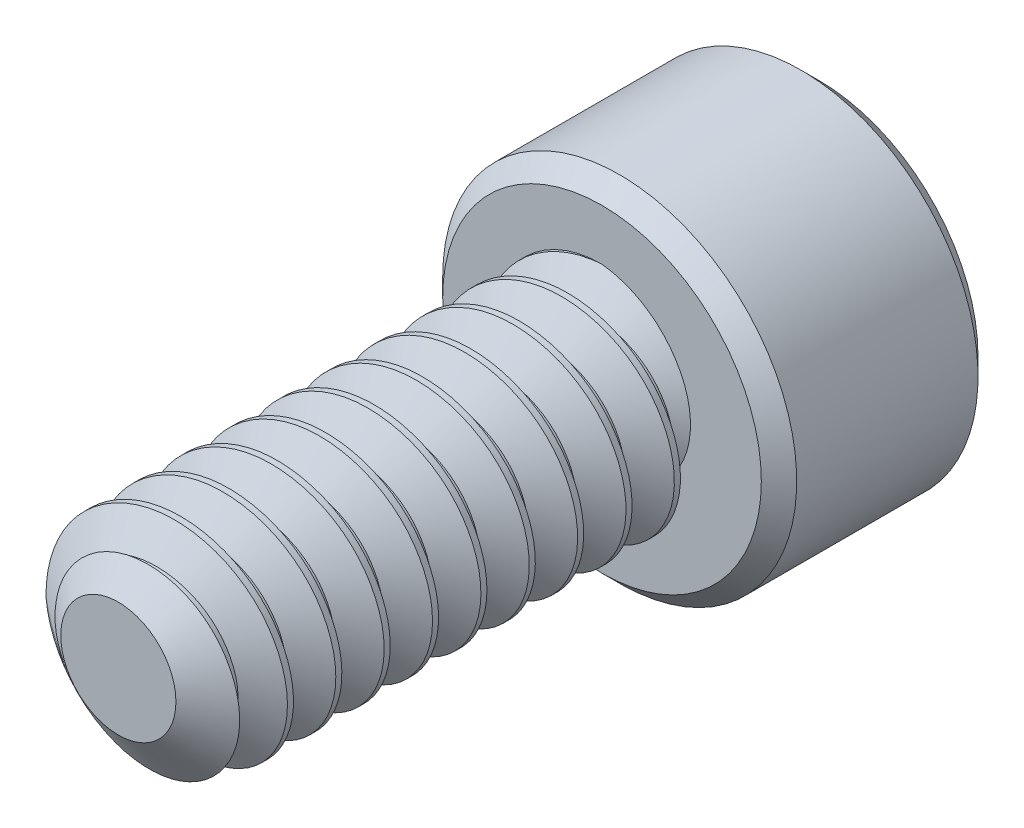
ISO-10303-21;
HEADER;
FILE_DESCRIPTION(('STEP AP214'),'2;1');
FILE_NAME('part.step','',(''),(''),'','','');
FILE_SCHEMA(('AUTOMOTIVE_DESIGN { 1 0 10303 214 1 1 1 1 }'));
ENDSEC;
DATA;
#1=APPLICATION_CONTEXT('core data for automotive mechanical design processes');
#2=APPLICATION_PROTOCOL_DEFINITION('international standard','automotive_design',2000,#1);
#3=PRODUCT_CONTEXT('',#1,'mechanical');
#4=PRODUCT('Part','Part','',(#3));
#5=PRODUCT_RELATED_PRODUCT_CATEGORY('part','',(#4));
#6=PRODUCT_DEFINITION_FORMATION('','',#4);
#7=PRODUCT_DEFINITION_CONTEXT('part definition',#1,'design');
#8=PRODUCT_DEFINITION('design','',#6,#7);
#9=PRODUCT_DEFINITION_SHAPE('','',#8);
#10=(LENGTH_UNIT() NAMED_UNIT(*) SI_UNIT(.MILLI.,.METRE.));
#11=(NAMED_UNIT(*) PLANE_ANGLE_UNIT() SI_UNIT($,.RADIAN.));
#12=(NAMED_UNIT(*) SI_UNIT($,.STERADIAN.) SOLID_ANGLE_UNIT());
#13=UNCERTAINTY_MEASURE_WITH_UNIT(LENGTH_MEASURE(1.E-05),#10,'distance_accuracy_value','');
#14=(GEOMETRIC_REPRESENTATION_CONTEXT(3) GLOBAL_UNCERTAINTY_ASSIGNED_CONTEXT((#13)) GLOBAL_UNIT_ASSIGNED_CONTEXT((#10,
#11,#12)) REPRESENTATION_CONTEXT('',''));
#15=CARTESIAN_POINT('',(0.,0.,0.));
#16=DIRECTION('',(0.,0.,1.));
#17=DIRECTION('',(1.,0.,0.));
#18=AXIS2_PLACEMENT_3D('',#15,#16,#17);
#19=CARTESIAN_POINT('',(0.,0.,-6.35));
#20=DIRECTION('',(0.,0.,1.));
#21=DIRECTION('',(1.,0.,0.));
#22=AXIS2_PLACEMENT_3D('',#19,#20,#21);
#23=CYLINDRICAL_SURFACE('',#22,1.4224);
#24=CARTESIAN_POINT('',(0.,1.4224,1.190625));
#25=CARTESIAN_POINT('',(0.821223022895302,1.42240000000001,1.13770833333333));
#26=CARTESIAN_POINT('',(1.23183453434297,0.711200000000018,1.08479166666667));
#27=CARTESIAN_POINT('',(1.64244604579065,0.,1.031875));
#28=CARTESIAN_POINT('',(1.231834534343,-0.711199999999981,0.978958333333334));
#29=CARTESIAN_POINT('',(0.821223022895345,-1.42239999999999,0.926041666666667));
#30=CARTESIAN_POINT('',(0.,-1.4224,0.873125));
#31=CARTESIAN_POINT('',(-0.821223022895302,-1.42240000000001,0.820208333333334));
#32=CARTESIAN_POINT('',(-1.23183453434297,-0.711200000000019,0.767291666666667));
#33=CARTESIAN_POINT('',(-1.64244604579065,0.,0.714375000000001));
#34=CARTESIAN_POINT('',(-1.231834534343,0.711199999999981,0.661458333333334));
#35=CARTESIAN_POINT('',(-0.821223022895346,1.42239999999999,0.608541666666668));
#36=CARTESIAN_POINT('',(0.,1.4224,0.555625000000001));
#37=CARTESIAN_POINT('',(0.821223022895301,1.42240000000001,0.502708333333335));
#38=CARTESIAN_POINT('',(1.23183453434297,0.711200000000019,0.449791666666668));
#39=CARTESIAN_POINT('',(1.64244604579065,0.,0.396875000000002));
#40=CARTESIAN_POINT('',(1.231834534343,-0.711199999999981,0.343958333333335));
#41=CARTESIAN_POINT('',(0.821223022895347,-1.42239999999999,0.291041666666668));
#42=CARTESIAN_POINT('',(0.,-1.4224,0.238125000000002));
#43=CARTESIAN_POINT('',(-0.821223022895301,-1.42240000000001,0.185208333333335));
#44=CARTESIAN_POINT('',(-1.23183453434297,-0.71120000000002,0.132291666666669));
#45=CARTESIAN_POINT('',(-1.64244604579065,0.,0.0793750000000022));
#46=CARTESIAN_POINT('',(-1.231834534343,0.71119999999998,0.0264583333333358));
#47=CARTESIAN_POINT('',(-0.821223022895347,1.42239999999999,-0.0264583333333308));
#48=CARTESIAN_POINT('',(0.,1.4224,-0.0793749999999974));
#49=CARTESIAN_POINT('',(0.821223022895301,1.42240000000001,-0.132291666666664));
#50=CARTESIAN_POINT('',(1.23183453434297,0.71120000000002,-0.185208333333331));
#51=CARTESIAN_POINT('',(1.64244604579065,0.,-0.238124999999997));
#52=CARTESIAN_POINT('',(1.231834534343,-0.71119999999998,-0.291041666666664));
#53=CARTESIAN_POINT('',(0.821223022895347,-1.42239999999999,-0.34395833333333));
#54=CARTESIAN_POINT('',(0.,-1.4224,-0.396874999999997));
#55=CARTESIAN_POINT('',(-0.821223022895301,-1.42240000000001,-0.449791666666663));
#56=CARTESIAN_POINT('',(-1.23183453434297,-0.711200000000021,-0.50270833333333));
#57=CARTESIAN_POINT('',(-1.64244604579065,0.,-0.555624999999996));
#58=CARTESIAN_POINT('',(-1.231834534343,0.711199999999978,-0.608541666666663));
#59=CARTESIAN_POINT('',(-0.82122302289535,1.42239999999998,-0.66145833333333));
#60=CARTESIAN_POINT('',(0.,1.4224,-0.714374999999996));
#61=CARTESIAN_POINT('',(0.821223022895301,1.42240000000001,-0.767291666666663));
#62=CARTESIAN_POINT('',(1.23183453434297,0.711200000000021,-0.820208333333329));
#63=CARTESIAN_POINT('',(1.64244604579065,0.,-0.873124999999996));
#64=CARTESIAN_POINT('',(1.231834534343,-0.711199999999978,-0.926041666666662));
#65=CARTESIAN_POINT('',(0.82122302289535,-1.42239999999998,-0.978958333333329));
#66=CARTESIAN_POINT('',(0.,-1.4224,-1.031875));
#67=CARTESIAN_POINT('',(-0.8212230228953,-1.42240000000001,-1.08479166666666));
#68=CARTESIAN_POINT('',(-1.23183453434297,-0.711200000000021,-1.13770833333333));
#69=CARTESIAN_POINT('',(-1.64244604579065,0.,-1.190625));
#70=CARTESIAN_POINT('',(-1.231834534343,0.711199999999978,-1.24354166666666));
#71=CARTESIAN_POINT('',(-0.821223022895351,1.42239999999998,-1.29645833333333));
#72=CARTESIAN_POINT('',(0.,1.4224,-1.34937499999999));
#73=CARTESIAN_POINT('',(0.8212230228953,1.42240000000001,-1.40229166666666));
#74=CARTESIAN_POINT('',(1.23183453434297,0.711200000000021,-1.45520833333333));
#75=CARTESIAN_POINT('',(1.64244604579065,0.,-1.50812499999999));
#76=CARTESIAN_POINT('',(1.231834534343,-0.711199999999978,-1.56104166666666));
#77=CARTESIAN_POINT('',(0.821223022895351,-1.42239999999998,-1.61395833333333));
#78=CARTESIAN_POINT('',(0.,-1.4224,-1.66687499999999));
#79=CARTESIAN_POINT('',(-0.8212230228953,-1.42240000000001,-1.71979166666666));
#80=CARTESIAN_POINT('',(-1.23183453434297,-0.711200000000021,-1.77270833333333));
#81=CARTESIAN_POINT('',(-1.64244604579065,0.,-1.82562499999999));
#82=CARTESIAN_POINT('',(-1.231834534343,0.711199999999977,-1.87854166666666));
#83=CARTESIAN_POINT('',(-0.821223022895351,1.42239999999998,-1.93145833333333));
#84=CARTESIAN_POINT('',(0.,1.4224,-1.98437499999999));
#85=CARTESIAN_POINT('',(0.8212230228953,1.42240000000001,-2.03729166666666));
#86=CARTESIAN_POINT('',(1.23183453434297,0.711200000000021,-2.09020833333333));
#87=CARTESIAN_POINT('',(1.64244604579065,0.,-2.14312499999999));
#88=CARTESIAN_POINT('',(1.231834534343,-0.711199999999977,-2.19604166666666));
#89=CARTESIAN_POINT('',(0.821223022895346,-1.42239999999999,-2.24895833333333));
#90=CARTESIAN_POINT('',(0.,-1.4224,-2.30187499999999));
#91=CARTESIAN_POINT('',(-0.8212230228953,-1.42240000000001,-2.35479166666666));
#92=CARTESIAN_POINT('',(-1.23183453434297,-0.711200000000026,-2.40770833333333));
#93=CARTESIAN_POINT('',(-1.64244604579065,0.,-2.46062499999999));
#94=CARTESIAN_POINT('',(-1.231834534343,0.711199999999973,-2.51354166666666));
#95=CARTESIAN_POINT('',(-0.821223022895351,1.42239999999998,-2.56645833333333));
#96=CARTESIAN_POINT('',(0.,1.4224,-2.61937499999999));
#97=CARTESIAN_POINT('',(0.821223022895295,1.42240000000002,-2.67229166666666));
#98=CARTESIAN_POINT('',(1.23183453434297,0.711200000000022,-2.72520833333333));
#99=CARTESIAN_POINT('',(1.64244604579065,0.,-2.77812499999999));
#100=CARTESIAN_POINT('',(1.231834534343,-0.711199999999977,-2.83104166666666));
#101=CARTESIAN_POINT('',(0.821223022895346,-1.42239999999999,-2.88395833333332));
#102=CARTESIAN_POINT('',(0.,-1.4224,-2.93687499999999));
#103=CARTESIAN_POINT('',(-0.821223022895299,-1.42240000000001,-2.98979166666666));
#104=CARTESIAN_POINT('',(-1.23183453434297,-0.711200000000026,-3.04270833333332));
#105=CARTESIAN_POINT('',(-1.64244604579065,0.,-3.09562499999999));
#106=CARTESIAN_POINT('',(-1.231834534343,0.711199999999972,-3.14854166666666));
#107=CARTESIAN_POINT('',(-0.821223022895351,1.42239999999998,-3.20145833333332));
#108=CARTESIAN_POINT('',(0.,1.4224,-3.25437499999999));
#109=CARTESIAN_POINT('',(0.821223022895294,1.42240000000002,-3.30729166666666));
#110=CARTESIAN_POINT('',(1.23183453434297,0.711200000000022,-3.36020833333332));
#111=CARTESIAN_POINT('',(1.64244604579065,0.,-3.41312499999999));
#112=CARTESIAN_POINT('',(1.231834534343,-0.711199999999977,-3.46604166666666));
#113=CARTESIAN_POINT('',(0.821223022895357,-1.42239999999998,-3.51895833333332));
#114=CARTESIAN_POINT('',(0.,-1.4224,-3.57187499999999));
#115=CARTESIAN_POINT('',(-0.821223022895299,-1.42240000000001,-3.62479166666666));
#116=CARTESIAN_POINT('',(-1.23183453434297,-0.711200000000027,-3.67770833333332));
#117=CARTESIAN_POINT('',(-1.64244604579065,0.,-3.73062499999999));
#118=CARTESIAN_POINT('',(-1.231834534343,0.711199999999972,-3.78354166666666));
#119=CARTESIAN_POINT('',(-0.821223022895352,1.42239999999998,-3.83645833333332));
#120=CARTESIAN_POINT('',(0.,1.4224,-3.88937499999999));
#121=CARTESIAN_POINT('',(0.821223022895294,1.42240000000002,-3.94229166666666));
#122=CARTESIAN_POINT('',(1.23183453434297,0.711200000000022,-3.99520833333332));
#123=CARTESIAN_POINT('',(1.64244604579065,0.,-4.04812499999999));
#124=CARTESIAN_POINT('',(1.231834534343,-0.711199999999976,-4.10104166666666));
#125=CARTESIAN_POINT('',(0.821223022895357,-1.42239999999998,-4.15395833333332));
#126=CARTESIAN_POINT('',(0.,-1.4224,-4.20687499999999));
#127=CARTESIAN_POINT('',(-0.821223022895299,-1.42240000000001,-4.25979166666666));
#128=CARTESIAN_POINT('',(-1.23183453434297,-0.711200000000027,-4.31270833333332));
#129=CARTESIAN_POINT('',(-1.64244604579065,0.,-4.36562499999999));
#130=CARTESIAN_POINT('',(-1.231834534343,0.711199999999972,-4.41854166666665));
#131=CARTESIAN_POINT('',(-0.821223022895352,1.42239999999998,-4.47145833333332));
#132=CARTESIAN_POINT('',(0.,1.4224,-4.52437499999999));
#133=CARTESIAN_POINT('',(0.821223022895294,1.42240000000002,-4.57729166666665));
#134=CARTESIAN_POINT('',(1.23183453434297,0.711200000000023,-4.63020833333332));
#135=CARTESIAN_POINT('',(1.64244604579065,0.,-4.68312499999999));
#136=CARTESIAN_POINT('',(1.231834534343,-0.711199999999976,-4.73604166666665));
#137=CARTESIAN_POINT('',(0.821223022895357,-1.42239999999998,-4.78895833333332));
#138=CARTESIAN_POINT('',(0.,-1.4224,-4.84187499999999));
#139=CARTESIAN_POINT('',(-0.821223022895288,-1.42240000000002,-4.89479166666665));
#140=CARTESIAN_POINT('',(-1.23183453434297,-0.711200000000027,-4.94770833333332));
#141=CARTESIAN_POINT('',(-1.64244604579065,0.,-5.00062499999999));
#142=CARTESIAN_POINT('',(-1.231834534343,0.711199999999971,-5.05354166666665));
#143=CARTESIAN_POINT('',(-0.821223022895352,1.42239999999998,-5.10645833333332));
#144=CARTESIAN_POINT('',(0.,1.4224,-5.15937499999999));
#145=CARTESIAN_POINT('',(0.821223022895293,1.42240000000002,-5.21229166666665));
#146=CARTESIAN_POINT('',(1.23183453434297,0.711200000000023,-5.26520833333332));
#147=CARTESIAN_POINT('',(1.64244604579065,0.,-5.31812499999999));
#148=CARTESIAN_POINT('',(1.231834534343,-0.711199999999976,-5.37104166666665));
#149=CARTESIAN_POINT('',(0.821223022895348,-1.42239999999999,-5.42395833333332));
#150=CARTESIAN_POINT('',(0.,-1.4224,-5.47687499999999));
#151=CARTESIAN_POINT('',(-0.821223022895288,-1.42240000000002,-5.52979166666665));
#152=CARTESIAN_POINT('',(-1.23183453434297,-0.711200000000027,-5.58270833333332));
#153=CARTESIAN_POINT('',(-1.64244604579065,0.,-5.63562499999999));
#154=CARTESIAN_POINT('',(-1.231834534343,0.71119999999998,-5.68854166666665));
#155=CARTESIAN_POINT('',(-0.821223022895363,1.42239999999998,-5.74145833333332));
#156=CARTESIAN_POINT('',(0.,1.4224,-5.79437499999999));
#157=CARTESIAN_POINT('',(0.821223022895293,1.42240000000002,-5.84729166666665));
#158=CARTESIAN_POINT('',(1.23183453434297,0.711200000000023,-5.90020833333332));
#159=CARTESIAN_POINT('',(1.64244604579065,0.,-5.95312499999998));
#160=CARTESIAN_POINT('',(1.23183453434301,-0.711199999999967,-6.00604166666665));
#161=CARTESIAN_POINT('',(0.821223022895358,-1.42239999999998,-6.05895833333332));
#162=CARTESIAN_POINT('',(0.,-1.4224,-6.11187499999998));
#163=CARTESIAN_POINT('',(-0.821223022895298,-1.42240000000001,-6.16479166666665));
#164=CARTESIAN_POINT('',(-1.23183453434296,-0.711200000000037,-6.21770833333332));
#165=CARTESIAN_POINT('',(-1.64244604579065,0.,-6.27062499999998));
#166=CARTESIAN_POINT('',(-1.231834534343,0.711199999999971,-6.32354166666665));
#167=CARTESIAN_POINT('',(-0.821223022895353,1.42239999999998,-6.37645833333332));
#168=CARTESIAN_POINT('',(0.,1.4224,-6.42937499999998));
#169=CARTESIAN_POINT('',(0.821223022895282,1.42240000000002,-6.48229166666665));
#170=CARTESIAN_POINT('',(1.23183453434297,0.711200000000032,-6.53520833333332));
#171=CARTESIAN_POINT('',(1.64244604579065,0.,-6.58812499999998));
#172=CARTESIAN_POINT('',(1.231834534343,-0.711199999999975,-6.64104166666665));
#173=CARTESIAN_POINT('',(0.821223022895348,-1.42239999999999,-6.69395833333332));
#174=CARTESIAN_POINT('',(0.,-1.4224,-6.74687499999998));
#175=CARTESIAN_POINT('',(-0.821223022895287,-1.42240000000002,-6.79979166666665));
#176=CARTESIAN_POINT('',(-1.23183453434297,-0.711200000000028,-6.85270833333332));
#177=CARTESIAN_POINT('',(-1.64244604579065,0.,-6.90562499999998));
#178=CARTESIAN_POINT('',(-1.231834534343,0.711199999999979,-6.95854166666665));
#179=CARTESIAN_POINT('',(-0.821223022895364,1.42239999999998,-7.01145833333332));
#180=CARTESIAN_POINT('',(0.,1.4224,-7.06437499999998));
#181=(BOUNDED_CURVE() B_SPLINE_CURVE(2,(#24,#25,#26,#27,#28,#29,#30,#31,#32,#33,#34,#35,#36,#37,
#38,#39,#40,#41,#42,#43,#44,#45,#46,#47,#48,#49,#50,#51,#52,#53,#54,#55,#56,#57,#58,#59,#60,#61,
#62,#63,#64,#65,#66,#67,#68,#69,#70,#71,#72,#73,#74,#75,#76,#77,#78,#79,#80,#81,#82,#83,#84,#85,
#86,#87,#88,#89,#90,#91,#92,#93,#94,#95,#96,#97,#98,#99,#100,#101,#102,#103,#104,#105,#106,#107,
#108,#109,#110,#111,#112,#113,#114,#115,#116,#117,#118,#119,#120,#121,#122,#123,#124,#125,#126,
#127,#128,#129,#130,#131,#132,#133,#134,#135,#136,#137,#138,#139,#140,#141,#142,#143,#144,#145,
#146,#147,#148,#149,#150,#151,#152,#153,#154,#155,#156,#157,#158,#159,#160,#161,#162,#163,#164,
#165,#166,#167,#168,#169,#170,#171,#172,#173,#174,#175,#176,#177,#178,#179,#180),.UNSPECIFIED.,
.F.,.F.) B_SPLINE_CURVE_WITH_KNOTS((3,2,2,2,2,2,2,2,2,2,2,2,2,2,2,2,2,2,2,2,2,2,2,2,2,2,2,2,2,2,
2,2,2,2,2,2,2,2,2,2,2,2,2,2,2,2,2,2,2,2,2,2,2,2,2,2,2,2,2,2,2,2,2,2,2,2,2,2,2,2,2,2,2,2,2,2,2,2,
3),(0.,0.0128205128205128,0.0256410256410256,0.0384615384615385,0.0512820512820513,
0.0641025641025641,0.0769230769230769,0.0897435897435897,0.102564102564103,0.115384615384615,
0.128205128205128,0.141025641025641,0.153846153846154,0.166666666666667,0.179487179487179,
0.192307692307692,0.205128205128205,0.217948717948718,0.230769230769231,0.243589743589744,
0.256410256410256,0.269230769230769,0.282051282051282,0.294871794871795,0.307692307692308,
0.320512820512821,0.333333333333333,0.346153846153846,0.358974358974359,0.371794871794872,
0.384615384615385,0.397435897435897,0.41025641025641,0.423076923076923,0.435897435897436,
0.448717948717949,0.461538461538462,0.474358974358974,0.487179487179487,0.5,0.512820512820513,
0.525641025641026,0.538461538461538,0.551282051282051,0.564102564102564,0.576923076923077,
0.58974358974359,0.602564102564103,0.615384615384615,0.628205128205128,0.641025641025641,
0.653846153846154,0.666666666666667,0.67948717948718,0.692307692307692,0.705128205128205,
0.717948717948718,0.730769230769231,0.743589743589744,0.756410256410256,0.769230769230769,
0.782051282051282,0.794871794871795,0.807692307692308,0.82051282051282,0.833333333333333,
0.846153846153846,0.858974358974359,0.871794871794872,0.884615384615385,0.897435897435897,
0.91025641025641,0.923076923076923,0.935897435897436,0.948717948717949,0.961538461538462,
0.974358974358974,0.987179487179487,1.),
.UNSPECIFIED.) CURVE() GEOMETRIC_REPRESENTATION_ITEM() RATIONAL_B_SPLINE_CURVE((1.,
0.866025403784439,1.,0.866025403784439,1.,0.866025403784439,1.,0.866025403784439,1.,
0.866025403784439,1.,0.866025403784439,1.,0.866025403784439,1.,0.866025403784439,1.,
0.866025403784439,1.,0.866025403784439,1.,0.866025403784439,1.,0.866025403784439,1.,
0.866025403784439,1.,0.866025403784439,1.,0.866025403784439,1.,0.866025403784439,1.,
0.866025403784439,1.,0.866025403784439,1.,0.866025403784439,1.,0.866025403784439,1.,
0.866025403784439,1.,0.866025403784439,1.,0.866025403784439,1.,0.866025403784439,1.,
0.866025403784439,1.,0.866025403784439,1.,0.866025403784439,1.,0.866025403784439,1.,
0.866025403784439,1.,0.866025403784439,1.,0.866025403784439,1.,0.866025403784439,1.,
0.866025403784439,1.,0.866025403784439,1.,0.866025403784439,1.,0.866025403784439,1.,
0.866025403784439,1.,0.866025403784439,1.,0.866025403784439,1.,0.866025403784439,1.,
0.866025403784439,1.,0.866025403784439,1.,0.866025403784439,1.,0.866025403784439,1.,
0.866025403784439,1.,0.866025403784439,1.,0.866025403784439,1.,0.866025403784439,1.,
0.866025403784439,1.,0.866025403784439,1.,0.866025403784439,1.,0.866025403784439,1.,
0.866025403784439,1.,0.866025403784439,1.,0.866025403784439,1.,0.866025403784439,1.,
0.866025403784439,1.,0.866025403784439,1.,0.866025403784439,1.,0.866025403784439,1.,
0.866025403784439,1.,0.866025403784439,1.,0.866025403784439,1.,0.866025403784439,1.,
0.866025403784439,1.,0.866025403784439,1.,0.866025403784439,1.,0.866025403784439,1.,
0.866025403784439,1.,0.866025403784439,1.,0.866025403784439,1.,0.866025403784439,1.,
0.866025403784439,1.,0.866025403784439,1.,0.866025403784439,1.,0.866025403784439,1.,
0.866025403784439,1.,0.866025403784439,1.)) REPRESENTATION_ITEM(''));
#182=CARTESIAN_POINT('',(-0.898334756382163,-1.10282202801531,-0.46664953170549));
#183=VERTEX_POINT('',#182);
#184=CARTESIAN_POINT('',(-0.996575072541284,1.01491865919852,-6.35));
#185=VERTEX_POINT('',#184);
#186=EDGE_CURVE('E265',#183,#185,#181,.T.);
#187=ORIENTED_EDGE('',*,*,#186,.F.);
#188=CARTESIAN_POINT('',(0.,0.,-0.46664953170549));
#189=DIRECTION('',(0.,0.,1.));
#190=DIRECTION('',(1.,0.,0.));
#191=AXIS2_PLACEMENT_3D('',#188,#189,#190);
#192=CIRCLE('',#191,1.4224);
#193=CARTESIAN_POINT('',(-1.41653554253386,-0.129030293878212,-0.46664953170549));
#194=VERTEX_POINT('',#193);
#195=EDGE_CURVE('E266',#194,#183,#192,.T.);
#196=ORIENTED_EDGE('',*,*,#195,.F.);
#197=CARTESIAN_POINT('',(0.,1.4224,0.635));
#198=CARTESIAN_POINT('',(0.821223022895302,1.42240000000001,0.582083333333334));
#199=CARTESIAN_POINT('',(1.23183453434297,0.711200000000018,0.529166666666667));
#200=CARTESIAN_POINT('',(1.64244604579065,0.,0.47625));
#201=CARTESIAN_POINT('',(1.231834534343,-0.711199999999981,0.423333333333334));
#202=CARTESIAN_POINT('',(0.821223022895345,-1.42239999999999,0.370416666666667));
#203=CARTESIAN_POINT('',(0.,-1.4224,0.317500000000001));
#204=CARTESIAN_POINT('',(-0.821223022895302,-1.42240000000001,0.264583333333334));
#205=CARTESIAN_POINT('',(-1.23183453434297,-0.711200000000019,0.211666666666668));
#206=CARTESIAN_POINT('',(-1.64244604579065,0.,0.158750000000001));
#207=CARTESIAN_POINT('',(-1.231834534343,0.711199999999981,0.105833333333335));
#208=CARTESIAN_POINT('',(-0.821223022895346,1.42239999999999,0.052916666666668));
#209=CARTESIAN_POINT('',(0.,1.4224,0.));
#210=CARTESIAN_POINT('',(0.821223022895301,1.42240000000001,-0.0529166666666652));
#211=CARTESIAN_POINT('',(1.23183453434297,0.711200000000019,-0.105833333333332));
#212=CARTESIAN_POINT('',(1.64244604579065,0.,-0.158749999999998));
#213=CARTESIAN_POINT('',(1.231834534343,-0.711199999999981,-0.211666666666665));
#214=CARTESIAN_POINT('',(0.821223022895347,-1.42239999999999,-0.264583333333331));
#215=CARTESIAN_POINT('',(0.,-1.4224,-0.317499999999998));
#216=CARTESIAN_POINT('',(-0.821223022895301,-1.42240000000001,-0.370416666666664));
#217=CARTESIAN_POINT('',(-1.23183453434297,-0.71120000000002,-0.423333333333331));
#218=CARTESIAN_POINT('',(-1.64244604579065,0.,-0.476249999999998));
#219=CARTESIAN_POINT('',(-1.231834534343,0.71119999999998,-0.529166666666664));
#220=CARTESIAN_POINT('',(-0.821223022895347,1.42239999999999,-0.582083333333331));
#221=CARTESIAN_POINT('',(0.,1.4224,-0.634999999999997));
#222=CARTESIAN_POINT('',(0.821223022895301,1.42240000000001,-0.687916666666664));
#223=CARTESIAN_POINT('',(1.23183453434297,0.71120000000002,-0.74083333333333));
#224=CARTESIAN_POINT('',(1.64244604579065,0.,-0.793749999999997));
#225=CARTESIAN_POINT('',(1.231834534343,-0.71119999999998,-0.846666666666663));
#226=CARTESIAN_POINT('',(0.821223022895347,-1.42239999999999,-0.89958333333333));
#227=CARTESIAN_POINT('',(0.,-1.4224,-0.952499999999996));
#228=CARTESIAN_POINT('',(-0.821223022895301,-1.42240000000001,-1.00541666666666));
#229=CARTESIAN_POINT('',(-1.23183453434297,-0.711200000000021,-1.05833333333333));
#230=CARTESIAN_POINT('',(-1.64244604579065,0.,-1.11125));
#231=CARTESIAN_POINT('',(-1.231834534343,0.711199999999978,-1.16416666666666));
#232=CARTESIAN_POINT('',(-0.82122302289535,1.42239999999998,-1.21708333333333));
#233=CARTESIAN_POINT('',(0.,1.4224,-1.27));
#234=CARTESIAN_POINT('',(0.821223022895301,1.42240000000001,-1.32291666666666));
#235=CARTESIAN_POINT('',(1.23183453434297,0.711200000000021,-1.37583333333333));
#236=CARTESIAN_POINT('',(1.64244604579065,0.,-1.42875));
#237=CARTESIAN_POINT('',(1.231834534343,-0.711199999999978,-1.48166666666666));
#238=CARTESIAN_POINT('',(0.82122302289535,-1.42239999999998,-1.53458333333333));
#239=CARTESIAN_POINT('',(0.,-1.4224,-1.5875));
#240=CARTESIAN_POINT('',(-0.8212230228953,-1.42240000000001,-1.64041666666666));
#241=CARTESIAN_POINT('',(-1.23183453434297,-0.711200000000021,-1.69333333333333));
#242=CARTESIAN_POINT('',(-1.64244604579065,0.,-1.74624999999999));
#243=CARTESIAN_POINT('',(-1.231834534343,0.711199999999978,-1.79916666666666));
#244=CARTESIAN_POINT('',(-0.821223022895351,1.42239999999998,-1.85208333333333));
#245=CARTESIAN_POINT('',(0.,1.4224,-1.90499999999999));
#246=CARTESIAN_POINT('',(0.8212230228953,1.42240000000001,-1.95791666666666));
#247=CARTESIAN_POINT('',(1.23183453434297,0.711200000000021,-2.01083333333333));
#248=CARTESIAN_POINT('',(1.64244604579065,0.,-2.06374999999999));
#249=CARTESIAN_POINT('',(1.231834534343,-0.711199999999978,-2.11666666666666));
#250=CARTESIAN_POINT('',(0.821223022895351,-1.42239999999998,-2.16958333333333));
#251=CARTESIAN_POINT('',(0.,-1.4224,-2.22249999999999));
#252=CARTESIAN_POINT('',(-0.8212230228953,-1.42240000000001,-2.27541666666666));
#253=CARTESIAN_POINT('',(-1.23183453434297,-0.711200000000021,-2.32833333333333));
#254=CARTESIAN_POINT('',(-1.64244604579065,0.,-2.38124999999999));
#255=CARTESIAN_POINT('',(-1.231834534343,0.711199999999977,-2.43416666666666));
#256=CARTESIAN_POINT('',(-0.821223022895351,1.42239999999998,-2.48708333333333));
#257=CARTESIAN_POINT('',(0.,1.4224,-2.53999999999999));
#258=CARTESIAN_POINT('',(0.8212230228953,1.42240000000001,-2.59291666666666));
#259=CARTESIAN_POINT('',(1.23183453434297,0.711200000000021,-2.64583333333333));
#260=CARTESIAN_POINT('',(1.64244604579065,0.,-2.69874999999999));
#261=CARTESIAN_POINT('',(1.231834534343,-0.711199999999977,-2.75166666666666));
#262=CARTESIAN_POINT('',(0.821223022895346,-1.42239999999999,-2.80458333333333));
#263=CARTESIAN_POINT('',(0.,-1.4224,-2.85749999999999));
#264=CARTESIAN_POINT('',(-0.8212230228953,-1.42240000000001,-2.91041666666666));
#265=CARTESIAN_POINT('',(-1.23183453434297,-0.711200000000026,-2.96333333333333));
#266=CARTESIAN_POINT('',(-1.64244604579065,0.,-3.01624999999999));
#267=CARTESIAN_POINT('',(-1.231834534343,0.711199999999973,-3.06916666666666));
#268=CARTESIAN_POINT('',(-0.821223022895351,1.42239999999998,-3.12208333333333));
#269=CARTESIAN_POINT('',(0.,1.4224,-3.17499999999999));
#270=CARTESIAN_POINT('',(0.821223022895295,1.42240000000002,-3.22791666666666));
#271=CARTESIAN_POINT('',(1.23183453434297,0.711200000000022,-3.28083333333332));
#272=CARTESIAN_POINT('',(1.64244604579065,0.,-3.33374999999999));
#273=CARTESIAN_POINT('',(1.231834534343,-0.711199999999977,-3.38666666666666));
#274=CARTESIAN_POINT('',(0.821223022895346,-1.42239999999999,-3.43958333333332));
#275=CARTESIAN_POINT('',(0.,-1.4224,-3.49249999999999));
#276=CARTESIAN_POINT('',(-0.821223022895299,-1.42240000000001,-3.54541666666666));
#277=CARTESIAN_POINT('',(-1.23183453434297,-0.711200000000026,-3.59833333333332));
#278=CARTESIAN_POINT('',(-1.64244604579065,0.,-3.65124999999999));
#279=CARTESIAN_POINT('',(-1.231834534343,0.711199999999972,-3.70416666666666));
#280=CARTESIAN_POINT('',(-0.821223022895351,1.42239999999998,-3.75708333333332));
#281=CARTESIAN_POINT('',(0.,1.4224,-3.80999999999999));
#282=CARTESIAN_POINT('',(0.821223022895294,1.42240000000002,-3.86291666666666));
#283=CARTESIAN_POINT('',(1.23183453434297,0.711200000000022,-3.91583333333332));
#284=CARTESIAN_POINT('',(1.64244604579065,0.,-3.96874999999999));
#285=CARTESIAN_POINT('',(1.231834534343,-0.711199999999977,-4.02166666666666));
#286=CARTESIAN_POINT('',(0.821223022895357,-1.42239999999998,-4.07458333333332));
#287=CARTESIAN_POINT('',(0.,-1.4224,-4.12749999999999));
#288=CARTESIAN_POINT('',(-0.821223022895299,-1.42240000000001,-4.18041666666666));
#289=CARTESIAN_POINT('',(-1.23183453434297,-0.711200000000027,-4.23333333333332));
#290=CARTESIAN_POINT('',(-1.64244604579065,0.,-4.28624999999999));
#291=CARTESIAN_POINT('',(-1.231834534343,0.711199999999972,-4.33916666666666));
#292=CARTESIAN_POINT('',(-0.821223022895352,1.42239999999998,-4.39208333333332));
#293=CARTESIAN_POINT('',(0.,1.4224,-4.44499999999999));
#294=CARTESIAN_POINT('',(0.821223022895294,1.42240000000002,-4.49791666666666));
#295=CARTESIAN_POINT('',(1.23183453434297,0.711200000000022,-4.55083333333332));
#296=CARTESIAN_POINT('',(1.64244604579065,0.,-4.60374999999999));
#297=CARTESIAN_POINT('',(1.231834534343,-0.711199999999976,-4.65666666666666));
#298=CARTESIAN_POINT('',(0.821223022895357,-1.42239999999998,-4.70958333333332));
#299=CARTESIAN_POINT('',(0.,-1.4224,-4.76249999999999));
#300=CARTESIAN_POINT('',(-0.821223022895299,-1.42240000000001,-4.81541666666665));
#301=CARTESIAN_POINT('',(-1.23183453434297,-0.711200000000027,-4.86833333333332));
#302=CARTESIAN_POINT('',(-1.64244604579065,0.,-4.92124999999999));
#303=CARTESIAN_POINT('',(-1.231834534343,0.711199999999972,-4.97416666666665));
#304=CARTESIAN_POINT('',(-0.821223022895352,1.42239999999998,-5.02708333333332));
#305=CARTESIAN_POINT('',(0.,1.4224,-5.07999999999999));
#306=CARTESIAN_POINT('',(0.821223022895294,1.42240000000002,-5.13291666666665));
#307=CARTESIAN_POINT('',(1.23183453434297,0.711200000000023,-5.18583333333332));
#308=CARTESIAN_POINT('',(1.64244604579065,0.,-5.23874999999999));
#309=CARTESIAN_POINT('',(1.231834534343,-0.711199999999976,-5.29166666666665));
#310=CARTESIAN_POINT('',(0.821223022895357,-1.42239999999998,-5.34458333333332));
#311=CARTESIAN_POINT('',(0.,-1.4224,-5.39749999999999));
#312=CARTESIAN_POINT('',(-0.821223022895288,-1.42240000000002,-5.45041666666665));
#313=CARTESIAN_POINT('',(-1.23183453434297,-0.711200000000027,-5.50333333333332));
#314=CARTESIAN_POINT('',(-1.64244604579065,0.,-5.55624999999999));
#315=CARTESIAN_POINT('',(-1.231834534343,0.711199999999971,-5.60916666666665));
#316=CARTESIAN_POINT('',(-0.821223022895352,1.42239999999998,-5.66208333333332));
#317=CARTESIAN_POINT('',(0.,1.4224,-5.71499999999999));
#318=CARTESIAN_POINT('',(0.821223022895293,1.42240000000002,-5.76791666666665));
#319=CARTESIAN_POINT('',(1.23183453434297,0.711200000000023,-5.82083333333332));
#320=CARTESIAN_POINT('',(1.64244604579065,0.,-5.87374999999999));
#321=CARTESIAN_POINT('',(1.231834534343,-0.711199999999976,-5.92666666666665));
#322=CARTESIAN_POINT('',(0.821223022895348,-1.42239999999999,-5.97958333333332));
#323=CARTESIAN_POINT('',(0.,-1.4224,-6.03249999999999));
#324=CARTESIAN_POINT('',(-0.821223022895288,-1.42240000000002,-6.08541666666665));
#325=CARTESIAN_POINT('',(-1.23183453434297,-0.711200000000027,-6.13833333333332));
#326=CARTESIAN_POINT('',(-1.64244604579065,0.,-6.19124999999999));
#327=CARTESIAN_POINT('',(-1.231834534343,0.71119999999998,-6.24416666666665));
#328=CARTESIAN_POINT('',(-0.821223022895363,1.42239999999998,-6.29708333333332));
#329=CARTESIAN_POINT('',(0.,1.4224,-6.34999999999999));
#330=CARTESIAN_POINT('',(0.821223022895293,1.42240000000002,-6.40291666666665));
#331=CARTESIAN_POINT('',(1.23183453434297,0.711200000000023,-6.45583333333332));
#332=CARTESIAN_POINT('',(1.64244604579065,0.,-6.50874999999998));
#333=CARTESIAN_POINT('',(1.23183453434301,-0.711199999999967,-6.56166666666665));
#334=CARTESIAN_POINT('',(0.821223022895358,-1.42239999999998,-6.61458333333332));
#335=CARTESIAN_POINT('',(0.,-1.4224,-6.66749999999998));
#336=CARTESIAN_POINT('',(-0.821223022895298,-1.42240000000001,-6.72041666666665));
#337=CARTESIAN_POINT('',(-1.23183453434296,-0.711200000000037,-6.77333333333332));
#338=CARTESIAN_POINT('',(-1.64244604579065,0.,-6.82624999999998));
#339=CARTESIAN_POINT('',(-1.231834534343,0.711199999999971,-6.87916666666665));
#340=CARTESIAN_POINT('',(-0.821223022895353,1.42239999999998,-6.93208333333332));
#341=CARTESIAN_POINT('',(0.,1.4224,-6.98499999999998));
#342=CARTESIAN_POINT('',(0.821223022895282,1.42240000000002,-7.03791666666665));
#343=CARTESIAN_POINT('',(1.23183453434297,0.711200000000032,-7.09083333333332));
#344=CARTESIAN_POINT('',(1.64244604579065,0.,-7.14374999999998));
#345=CARTESIAN_POINT('',(1.231834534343,-0.711199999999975,-7.19666666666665));
#346=CARTESIAN_POINT('',(0.821223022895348,-1.42239999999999,-7.24958333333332));
#347=CARTESIAN_POINT('',(0.,-1.4224,-7.30249999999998));
#348=CARTESIAN_POINT('',(-0.821223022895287,-1.42240000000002,-7.35541666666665));
#349=CARTESIAN_POINT('',(-1.23183453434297,-0.711200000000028,-7.40833333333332));
#350=CARTESIAN_POINT('',(-1.64244604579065,0.,-7.46124999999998));
#351=CARTESIAN_POINT('',(-1.231834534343,0.711199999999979,-7.51416666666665));
#352=CARTESIAN_POINT('',(-0.821223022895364,1.42239999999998,-7.56708333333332));
#353=CARTESIAN_POINT('',(0.,1.4224,-7.61999999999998));
#354=(BOUNDED_CURVE() B_SPLINE_CURVE(2,(#197,#198,#199,#200,#201,#202,#203,#204,#205,#206,#207,
#208,#209,#210,#211,#212,#213,#214,#215,#216,#217,#218,#219,#220,#221,#222,#223,#224,#225,#226,
#227,#228,#229,#230,#231,#232,#233,#234,#235,#236,#237,#238,#239,#240,#241,#242,#243,#244,#245,
#246,#247,#248,#249,#250,#251,#252,#253,#254,#255,#256,#257,#258,#259,#260,#261,#262,#263,#264,
#265,#266,#267,#268,#269,#270,#271,#272,#273,#274,#275,#276,#277,#278,#279,#280,#281,#282,#283,
#284,#285,#286,#287,#288,#289,#290,#291,#292,#293,#294,#295,#296,#297,#298,#299,#300,#301,#302,
#303,#304,#305,#306,#307,#308,#309,#310,#311,#312,#313,#314,#315,#316,#317,#318,#319,#320,#321,
#322,#323,#324,#325,#326,#327,#328,#329,#330,#331,#332,#333,#334,#335,#336,#337,#338,#339,#340,
#341,#342,#343,#344,#345,#346,#347,#348,#349,#350,#351,#352,#353),.UNSPECIFIED.,.F.,
.F.) B_SPLINE_CURVE_WITH_KNOTS((3,2,2,2,2,2,2,2,2,2,2,2,2,2,2,2,2,2,2,2,2,2,2,2,2,2,2,2,2,2,2,2,
2,2,2,2,2,2,2,2,2,2,2,2,2,2,2,2,2,2,2,2,2,2,2,2,2,2,2,2,2,2,2,2,2,2,2,2,2,2,2,2,2,2,2,2,2,2,3),
(0.,0.0128205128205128,0.0256410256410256,0.0384615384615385,0.0512820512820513,
0.0641025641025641,0.0769230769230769,0.0897435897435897,0.102564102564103,0.115384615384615,
0.128205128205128,0.141025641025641,0.153846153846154,0.166666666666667,0.179487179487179,
0.192307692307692,0.205128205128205,0.217948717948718,0.230769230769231,0.243589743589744,
0.256410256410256,0.269230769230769,0.282051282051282,0.294871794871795,0.307692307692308,
0.320512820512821,0.333333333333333,0.346153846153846,0.358974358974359,0.371794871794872,
0.384615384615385,0.397435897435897,0.41025641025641,0.423076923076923,0.435897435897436,
0.448717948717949,0.461538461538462,0.474358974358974,0.487179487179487,0.5,0.512820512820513,
0.525641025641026,0.538461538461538,0.551282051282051,0.564102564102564,0.576923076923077,
0.58974358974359,0.602564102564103,0.615384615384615,0.628205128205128,0.641025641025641,
0.653846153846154,0.666666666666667,0.67948717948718,0.692307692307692,0.705128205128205,
0.717948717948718,0.730769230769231,0.743589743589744,0.756410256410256,0.769230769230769,
0.782051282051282,0.794871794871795,0.807692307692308,0.82051282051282,0.833333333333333,
0.846153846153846,0.858974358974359,0.871794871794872,0.884615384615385,0.897435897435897,
0.91025641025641,0.923076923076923,0.935897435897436,0.948717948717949,0.961538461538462,
0.974358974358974,0.987179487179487,1.),
.UNSPECIFIED.) CURVE() GEOMETRIC_REPRESENTATION_ITEM() RATIONAL_B_SPLINE_CURVE((1.,
0.866025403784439,1.,0.866025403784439,1.,0.866025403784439,1.,0.866025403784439,1.,
0.866025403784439,1.,0.866025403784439,1.,0.866025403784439,1.,0.866025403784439,1.,
0.866025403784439,1.,0.866025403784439,1.,0.866025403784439,1.,0.866025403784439,1.,
0.866025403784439,1.,0.866025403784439,1.,0.866025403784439,1.,0.866025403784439,1.,
0.866025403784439,1.,0.866025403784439,1.,0.866025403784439,1.,0.866025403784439,1.,
0.866025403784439,1.,0.866025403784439,1.,0.866025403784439,1.,0.866025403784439,1.,
0.866025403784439,1.,0.866025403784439,1.,0.866025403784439,1.,0.866025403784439,1.,
0.866025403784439,1.,0.866025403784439,1.,0.866025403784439,1.,0.866025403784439,1.,
0.866025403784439,1.,0.866025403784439,1.,0.866025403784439,1.,0.866025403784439,1.,
0.866025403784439,1.,0.866025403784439,1.,0.866025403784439,1.,0.866025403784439,1.,
0.866025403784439,1.,0.866025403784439,1.,0.866025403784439,1.,0.866025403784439,1.,
0.866025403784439,1.,0.866025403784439,1.,0.866025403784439,1.,0.866025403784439,1.,
0.866025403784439,1.,0.866025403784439,1.,0.866025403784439,1.,0.866025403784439,1.,
0.866025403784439,1.,0.866025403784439,1.,0.866025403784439,1.,0.866025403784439,1.,
0.866025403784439,1.,0.866025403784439,1.,0.866025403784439,1.,0.866025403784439,1.,
0.866025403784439,1.,0.866025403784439,1.,0.866025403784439,1.,0.866025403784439,1.,
0.866025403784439,1.,0.866025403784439,1.,0.866025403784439,1.,0.866025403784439,1.,
0.866025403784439,1.,0.866025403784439,1.,0.866025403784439,1.,0.866025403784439,1.,
0.866025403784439,1.,0.866025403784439,1.,0.866025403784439,1.,0.866025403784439,1.,
0.866025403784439,1.,0.866025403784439,1.)) REPRESENTATION_ITEM(''));
#355=CARTESIAN_POINT('',(0.,1.4224,-6.34999999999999));
#356=VERTEX_POINT('',#355);
#357=EDGE_CURVE('E273',#194,#356,#354,.T.);
#358=ORIENTED_EDGE('',*,*,#357,.T.);
#359=CARTESIAN_POINT('',(0.,0.,-6.35));
#360=DIRECTION('',(0.,0.,1.));
#361=DIRECTION('',(1.,0.,0.));
#362=AXIS2_PLACEMENT_3D('',#359,#360,#361);
#363=CIRCLE('',#362,1.4224);
#364=EDGE_CURVE('E269',#356,#185,#363,.T.);
#365=ORIENTED_EDGE('',*,*,#364,.T.);
#366=EDGE_LOOP('',(#187,#196,#358,#365));
#367=FACE_BOUND('',#366,.T.);
#368=ADVANCED_FACE('F38',(#367),#23,.T.);
#369=CARTESIAN_POINT('',(0.,1.4224,1.190625));
#370=CARTESIAN_POINT('',(0.821223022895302,1.42240000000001,1.13770833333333));
#371=CARTESIAN_POINT('',(1.23183453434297,0.711200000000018,1.08479166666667));
#372=CARTESIAN_POINT('',(1.64244604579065,0.,1.031875));
#373=CARTESIAN_POINT('',(1.231834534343,-0.711199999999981,0.978958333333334));
#374=CARTESIAN_POINT('',(0.821223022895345,-1.42239999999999,0.926041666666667));
#375=CARTESIAN_POINT('',(0.,-1.4224,0.873125));
#376=CARTESIAN_POINT('',(-0.821223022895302,-1.42240000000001,0.820208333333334));
#377=CARTESIAN_POINT('',(-1.23183453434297,-0.711200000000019,0.767291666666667));
#378=CARTESIAN_POINT('',(-1.64244604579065,0.,0.714375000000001));
#379=CARTESIAN_POINT('',(-1.231834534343,0.711199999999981,0.661458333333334));
#380=CARTESIAN_POINT('',(-0.821223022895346,1.42239999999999,0.608541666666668));
#381=CARTESIAN_POINT('',(0.,1.4224,0.555625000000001));
#382=CARTESIAN_POINT('',(0.821223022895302,1.42240000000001,0.502708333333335));
#383=CARTESIAN_POINT('',(1.23183453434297,0.711200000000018,0.449791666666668));
#384=CARTESIAN_POINT('',(1.64244604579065,0.,0.396875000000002));
#385=CARTESIAN_POINT('',(1.231834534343,-0.711199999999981,0.343958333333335));
#386=CARTESIAN_POINT('',(0.821223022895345,-1.42239999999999,0.291041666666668));
#387=CARTESIAN_POINT('',(0.,-1.4224,0.238125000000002));
#388=CARTESIAN_POINT('',(-0.821223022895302,-1.42240000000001,0.185208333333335));
#389=CARTESIAN_POINT('',(-1.23183453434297,-0.711200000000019,0.132291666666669));
#390=CARTESIAN_POINT('',(-1.64244604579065,0.,0.0793750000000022));
#391=CARTESIAN_POINT('',(-1.231834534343,0.711199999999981,0.0264583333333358));
#392=CARTESIAN_POINT('',(-0.821223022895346,1.42239999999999,-0.0264583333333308));
#393=CARTESIAN_POINT('',(0.,1.4224,-0.0793749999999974));
#394=CARTESIAN_POINT('',(0.821223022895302,1.42240000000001,-0.132291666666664));
#395=CARTESIAN_POINT('',(1.23183453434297,0.711200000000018,-0.185208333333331));
#396=CARTESIAN_POINT('',(1.64244604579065,0.,-0.238124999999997));
#397=CARTESIAN_POINT('',(1.231834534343,-0.711199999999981,-0.291041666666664));
#398=CARTESIAN_POINT('',(0.821223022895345,-1.42239999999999,-0.34395833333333));
#399=CARTESIAN_POINT('',(0.,-1.4224,-0.396874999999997));
#400=CARTESIAN_POINT('',(-0.821223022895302,-1.42240000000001,-0.449791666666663));
#401=CARTESIAN_POINT('',(-1.23183453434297,-0.711200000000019,-0.50270833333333));
#402=CARTESIAN_POINT('',(-1.64244604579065,0.,-0.555624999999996));
#403=CARTESIAN_POINT('',(-1.231834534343,0.711199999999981,-0.608541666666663));
#404=CARTESIAN_POINT('',(-0.821223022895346,1.42239999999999,-0.66145833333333));
#405=CARTESIAN_POINT('',(0.,1.4224,-0.714374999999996));
#406=CARTESIAN_POINT('',(0.821223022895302,1.42240000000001,-0.767291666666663));
#407=CARTESIAN_POINT('',(1.23183453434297,0.711200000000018,-0.820208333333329));
#408=CARTESIAN_POINT('',(1.64244604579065,0.,-0.873124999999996));
#409=CARTESIAN_POINT('',(1.231834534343,-0.711199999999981,-0.926041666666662));
#410=CARTESIAN_POINT('',(0.821223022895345,-1.42239999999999,-0.978958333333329));
#411=CARTESIAN_POINT('',(0.,-1.4224,-1.031875));
#412=CARTESIAN_POINT('',(-0.821223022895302,-1.42240000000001,-1.08479166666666));
#413=CARTESIAN_POINT('',(-1.23183453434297,-0.711200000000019,-1.13770833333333));
#414=CARTESIAN_POINT('',(-1.64244604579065,0.,-1.190625));
#415=CARTESIAN_POINT('',(-1.231834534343,0.711199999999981,-1.24354166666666));
#416=CARTESIAN_POINT('',(-0.821223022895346,1.42239999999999,-1.29645833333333));
#417=CARTESIAN_POINT('',(0.,1.4224,-1.34937499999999));
#418=CARTESIAN_POINT('',(0.821223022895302,1.42240000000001,-1.40229166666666));
#419=CARTESIAN_POINT('',(1.23183453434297,0.711200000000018,-1.45520833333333));
#420=CARTESIAN_POINT('',(1.64244604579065,0.,-1.50812499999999));
#421=CARTESIAN_POINT('',(1.231834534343,-0.711199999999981,-1.56104166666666));
#422=CARTESIAN_POINT('',(0.821223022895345,-1.42239999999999,-1.61395833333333));
#423=CARTESIAN_POINT('',(0.,-1.4224,-1.66687499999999));
#424=CARTESIAN_POINT('',(-0.821223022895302,-1.42240000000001,-1.71979166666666));
#425=CARTESIAN_POINT('',(-1.23183453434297,-0.711200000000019,-1.77270833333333));
#426=CARTESIAN_POINT('',(-1.64244604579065,0.,-1.82562499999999));
#427=CARTESIAN_POINT('',(-1.231834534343,0.711199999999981,-1.87854166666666));
#428=CARTESIAN_POINT('',(-0.821223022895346,1.42239999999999,-1.93145833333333));
#429=CARTESIAN_POINT('',(0.,1.4224,-1.98437499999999));
#430=CARTESIAN_POINT('',(0.821223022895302,1.42240000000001,-2.03729166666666));
#431=CARTESIAN_POINT('',(1.23183453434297,0.711200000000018,-2.09020833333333));
#432=CARTESIAN_POINT('',(1.64244604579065,0.,-2.14312499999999));
#433=CARTESIAN_POINT('',(1.231834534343,-0.711199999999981,-2.19604166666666));
#434=CARTESIAN_POINT('',(0.821223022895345,-1.42239999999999,-2.24895833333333));
#435=CARTESIAN_POINT('',(0.,-1.4224,-2.30187499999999));
#436=CARTESIAN_POINT('',(-0.821223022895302,-1.42240000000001,-2.35479166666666));
#437=CARTESIAN_POINT('',(-1.23183453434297,-0.711200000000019,-2.40770833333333));
#438=CARTESIAN_POINT('',(-1.64244604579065,0.,-2.46062499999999));
#439=CARTESIAN_POINT('',(-1.231834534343,0.711199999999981,-2.51354166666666));
#440=CARTESIAN_POINT('',(-0.821223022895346,1.42239999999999,-2.56645833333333));
#441=CARTESIAN_POINT('',(0.,1.4224,-2.61937499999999));
#442=CARTESIAN_POINT('',(0.821223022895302,1.42240000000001,-2.67229166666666));
#443=CARTESIAN_POINT('',(1.23183453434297,0.711200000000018,-2.72520833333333));
#444=CARTESIAN_POINT('',(1.64244604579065,0.,-2.77812499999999));
#445=CARTESIAN_POINT('',(1.231834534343,-0.711199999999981,-2.83104166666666));
#446=CARTESIAN_POINT('',(0.821223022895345,-1.42239999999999,-2.88395833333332));
#447=CARTESIAN_POINT('',(0.,-1.4224,-2.93687499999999));
#448=CARTESIAN_POINT('',(-0.821223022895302,-1.42240000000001,-2.98979166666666));
#449=CARTESIAN_POINT('',(-1.23183453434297,-0.711200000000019,-3.04270833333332));
#450=CARTESIAN_POINT('',(-1.64244604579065,0.,-3.09562499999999));
#451=CARTESIAN_POINT('',(-1.231834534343,0.711199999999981,-3.14854166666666));
#452=CARTESIAN_POINT('',(-0.821223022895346,1.42239999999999,-3.20145833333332));
#453=CARTESIAN_POINT('',(0.,1.4224,-3.25437499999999));
#454=CARTESIAN_POINT('',(0.821223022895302,1.42240000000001,-3.30729166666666));
#455=CARTESIAN_POINT('',(1.23183453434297,0.711200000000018,-3.36020833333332));
#456=CARTESIAN_POINT('',(1.64244604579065,0.,-3.41312499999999));
#457=CARTESIAN_POINT('',(1.231834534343,-0.711199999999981,-3.46604166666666));
#458=CARTESIAN_POINT('',(0.821223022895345,-1.42239999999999,-3.51895833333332));
#459=CARTESIAN_POINT('',(0.,-1.4224,-3.57187499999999));
#460=CARTESIAN_POINT('',(-0.821223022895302,-1.42240000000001,-3.62479166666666));
#461=CARTESIAN_POINT('',(-1.23183453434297,-0.711200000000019,-3.67770833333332));
#462=CARTESIAN_POINT('',(-1.64244604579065,0.,-3.73062499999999));
#463=CARTESIAN_POINT('',(-1.231834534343,0.711199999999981,-3.78354166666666));
#464=CARTESIAN_POINT('',(-0.821223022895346,1.42239999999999,-3.83645833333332));
#465=CARTESIAN_POINT('',(0.,1.4224,-3.88937499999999));
#466=CARTESIAN_POINT('',(0.821223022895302,1.42240000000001,-3.94229166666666));
#467=CARTESIAN_POINT('',(1.23183453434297,0.711200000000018,-3.99520833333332));
#468=CARTESIAN_POINT('',(1.64244604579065,0.,-4.04812499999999));
#469=CARTESIAN_POINT('',(1.231834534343,-0.711199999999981,-4.10104166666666));
#470=CARTESIAN_POINT('',(0.821223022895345,-1.42239999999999,-4.15395833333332));
#471=CARTESIAN_POINT('',(0.,-1.4224,-4.20687499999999));
#472=CARTESIAN_POINT('',(-0.821223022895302,-1.42240000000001,-4.25979166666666));
#473=CARTESIAN_POINT('',(-1.23183453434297,-0.711200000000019,-4.31270833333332));
#474=CARTESIAN_POINT('',(-1.64244604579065,0.,-4.36562499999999));
#475=CARTESIAN_POINT('',(-1.231834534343,0.711199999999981,-4.41854166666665));
#476=CARTESIAN_POINT('',(-0.821223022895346,1.42239999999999,-4.47145833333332));
#477=CARTESIAN_POINT('',(0.,1.4224,-4.52437499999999));
#478=CARTESIAN_POINT('',(0.821223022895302,1.42240000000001,-4.57729166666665));
#479=CARTESIAN_POINT('',(1.23183453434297,0.711200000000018,-4.63020833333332));
#480=CARTESIAN_POINT('',(1.64244604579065,0.,-4.68312499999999));
#481=CARTESIAN_POINT('',(1.231834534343,-0.711199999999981,-4.73604166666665));
#482=CARTESIAN_POINT('',(0.821223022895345,-1.42239999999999,-4.78895833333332));
#483=CARTESIAN_POINT('',(0.,-1.4224,-4.84187499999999));
#484=CARTESIAN_POINT('',(-0.821223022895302,-1.42240000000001,-4.89479166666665));
#485=CARTESIAN_POINT('',(-1.23183453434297,-0.711200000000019,-4.94770833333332));
#486=CARTESIAN_POINT('',(-1.64244604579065,0.,-5.00062499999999));
#487=CARTESIAN_POINT('',(-1.231834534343,0.711199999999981,-5.05354166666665));
#488=CARTESIAN_POINT('',(-0.821223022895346,1.42239999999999,-5.10645833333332));
#489=CARTESIAN_POINT('',(0.,1.4224,-5.15937499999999));
#490=CARTESIAN_POINT('',(0.821223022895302,1.42240000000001,-5.21229166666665));
#491=CARTESIAN_POINT('',(1.23183453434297,0.711200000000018,-5.26520833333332));
#492=CARTESIAN_POINT('',(1.64244604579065,0.,-5.31812499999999));
#493=CARTESIAN_POINT('',(1.231834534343,-0.711199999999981,-5.37104166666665));
#494=CARTESIAN_POINT('',(0.821223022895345,-1.42239999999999,-5.42395833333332));
#495=CARTESIAN_POINT('',(0.,-1.4224,-5.47687499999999));
#496=CARTESIAN_POINT('',(-0.821223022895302,-1.42240000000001,-5.52979166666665));
#497=CARTESIAN_POINT('',(-1.23183453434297,-0.711200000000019,-5.58270833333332));
#498=CARTESIAN_POINT('',(-1.64244604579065,0.,-5.63562499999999));
#499=CARTESIAN_POINT('',(-1.231834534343,0.711199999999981,-5.68854166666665));
#500=CARTESIAN_POINT('',(-0.821223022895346,1.42239999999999,-5.74145833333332));
#501=CARTESIAN_POINT('',(0.,1.4224,-5.79437499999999));
#502=CARTESIAN_POINT('',(0.821223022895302,1.42240000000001,-5.84729166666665));
#503=CARTESIAN_POINT('',(1.23183453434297,0.711200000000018,-5.90020833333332));
#504=CARTESIAN_POINT('',(1.64244604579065,0.,-5.95312499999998));
#505=CARTESIAN_POINT('',(1.231834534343,-0.711199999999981,-6.00604166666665));
#506=CARTESIAN_POINT('',(0.821223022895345,-1.42239999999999,-6.05895833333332));
#507=CARTESIAN_POINT('',(0.,-1.4224,-6.11187499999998));
#508=CARTESIAN_POINT('',(-0.821223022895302,-1.42240000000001,-6.16479166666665));
#509=CARTESIAN_POINT('',(-1.23183453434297,-0.711200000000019,-6.21770833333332));
#510=CARTESIAN_POINT('',(-1.64244604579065,0.,-6.27062499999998));
#511=CARTESIAN_POINT('',(-1.231834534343,0.711199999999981,-6.32354166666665));
#512=CARTESIAN_POINT('',(-0.821223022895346,1.42239999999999,-6.37645833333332));
#513=CARTESIAN_POINT('',(0.,1.4224,-6.42937499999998));
#514=CARTESIAN_POINT('',(0.821223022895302,1.42240000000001,-6.48229166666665));
#515=CARTESIAN_POINT('',(1.23183453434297,0.711200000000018,-6.53520833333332));
#516=CARTESIAN_POINT('',(1.64244604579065,0.,-6.58812499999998));
#517=CARTESIAN_POINT('',(1.231834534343,-0.711199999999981,-6.64104166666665));
#518=CARTESIAN_POINT('',(0.821223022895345,-1.42239999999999,-6.69395833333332));
#519=CARTESIAN_POINT('',(0.,-1.4224,-6.74687499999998));
#520=CARTESIAN_POINT('',(-0.821223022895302,-1.42240000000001,-6.79979166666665));
#521=CARTESIAN_POINT('',(-1.23183453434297,-0.711200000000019,-6.85270833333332));
#522=CARTESIAN_POINT('',(-1.64244604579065,0.,-6.90562499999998));
#523=CARTESIAN_POINT('',(-1.231834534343,0.711199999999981,-6.95854166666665));
#524=CARTESIAN_POINT('',(-0.821223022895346,1.42239999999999,-7.01145833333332));
#525=CARTESIAN_POINT('',(0.,1.4224,-7.06437499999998));
#526=CARTESIAN_POINT('',(0.,1.00995540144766,0.9525));
#527=CARTESIAN_POINT('',(0.583098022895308,1.00995540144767,0.899583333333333));
#528=CARTESIAN_POINT('',(0.874647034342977,0.504977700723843,0.846666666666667));
#529=CARTESIAN_POINT('',(1.16619604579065,0.,0.79375));
#530=CARTESIAN_POINT('',(0.874647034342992,-0.504977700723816,0.740833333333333));
#531=CARTESIAN_POINT('',(0.583098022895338,-1.00995540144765,0.687916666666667));
#532=CARTESIAN_POINT('',(0.,-1.00995540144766,0.635));
#533=CARTESIAN_POINT('',(-0.583098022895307,-1.00995540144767,0.582083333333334));
#534=CARTESIAN_POINT('',(-0.874647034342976,-0.504977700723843,0.529166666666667));
#535=CARTESIAN_POINT('',(-1.16619604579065,0.,0.476250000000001));
#536=CARTESIAN_POINT('',(-0.874647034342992,0.504977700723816,0.423333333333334));
#537=CARTESIAN_POINT('',(-0.583098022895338,1.00995540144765,0.370416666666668));
#538=CARTESIAN_POINT('',(0.,1.00995540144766,0.317500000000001));
#539=CARTESIAN_POINT('',(0.583098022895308,1.00995540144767,0.264583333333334));
#540=CARTESIAN_POINT('',(0.874647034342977,0.504977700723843,0.211666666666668));
#541=CARTESIAN_POINT('',(1.16619604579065,0.,0.158750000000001));
#542=CARTESIAN_POINT('',(0.874647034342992,-0.504977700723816,0.105833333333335));
#543=CARTESIAN_POINT('',(0.583098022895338,-1.00995540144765,0.0529166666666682));
#544=CARTESIAN_POINT('',(0.,-1.00995540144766,0.));
#545=CARTESIAN_POINT('',(-0.583098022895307,-1.00995540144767,-0.0529166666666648));
#546=CARTESIAN_POINT('',(-0.874647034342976,-0.504977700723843,-0.105833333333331));
#547=CARTESIAN_POINT('',(-1.16619604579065,0.,-0.158749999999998));
#548=CARTESIAN_POINT('',(-0.874647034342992,0.504977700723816,-0.211666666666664));
#549=CARTESIAN_POINT('',(-0.583098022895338,1.00995540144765,-0.264583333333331));
#550=CARTESIAN_POINT('',(0.,1.00995540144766,-0.317499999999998));
#551=CARTESIAN_POINT('',(0.583098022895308,1.00995540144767,-0.370416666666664));
#552=CARTESIAN_POINT('',(0.874647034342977,0.504977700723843,-0.423333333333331));
#553=CARTESIAN_POINT('',(1.16619604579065,0.,-0.476249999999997));
#554=CARTESIAN_POINT('',(0.874647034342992,-0.504977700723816,-0.529166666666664));
#555=CARTESIAN_POINT('',(0.583098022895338,-1.00995540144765,-0.58208333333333));
#556=CARTESIAN_POINT('',(0.,-1.00995540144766,-0.634999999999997));
#557=CARTESIAN_POINT('',(-0.583098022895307,-1.00995540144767,-0.687916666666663));
#558=CARTESIAN_POINT('',(-0.874647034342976,-0.504977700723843,-0.74083333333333));
#559=CARTESIAN_POINT('',(-1.16619604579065,0.,-0.793749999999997));
#560=CARTESIAN_POINT('',(-0.874647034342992,0.504977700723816,-0.846666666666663));
#561=CARTESIAN_POINT('',(-0.583098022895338,1.00995540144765,-0.89958333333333));
#562=CARTESIAN_POINT('',(0.,1.00995540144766,-0.952499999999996));
#563=CARTESIAN_POINT('',(0.583098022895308,1.00995540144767,-1.00541666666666));
#564=CARTESIAN_POINT('',(0.874647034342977,0.504977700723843,-1.05833333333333));
#565=CARTESIAN_POINT('',(1.16619604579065,0.,-1.11125));
#566=CARTESIAN_POINT('',(0.874647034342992,-0.504977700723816,-1.16416666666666));
#567=CARTESIAN_POINT('',(0.583098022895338,-1.00995540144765,-1.21708333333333));
#568=CARTESIAN_POINT('',(0.,-1.00995540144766,-1.27));
#569=CARTESIAN_POINT('',(-0.583098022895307,-1.00995540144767,-1.32291666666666));
#570=CARTESIAN_POINT('',(-0.874647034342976,-0.504977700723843,-1.37583333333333));
#571=CARTESIAN_POINT('',(-1.16619604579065,0.,-1.42875));
#572=CARTESIAN_POINT('',(-0.874647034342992,0.504977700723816,-1.48166666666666));
#573=CARTESIAN_POINT('',(-0.583098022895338,1.00995540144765,-1.53458333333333));
#574=CARTESIAN_POINT('',(0.,1.00995540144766,-1.58749999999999));
#575=CARTESIAN_POINT('',(0.583098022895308,1.00995540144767,-1.64041666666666));
#576=CARTESIAN_POINT('',(0.874647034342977,0.504977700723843,-1.69333333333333));
#577=CARTESIAN_POINT('',(1.16619604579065,0.,-1.74624999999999));
#578=CARTESIAN_POINT('',(0.874647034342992,-0.504977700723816,-1.79916666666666));
#579=CARTESIAN_POINT('',(0.583098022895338,-1.00995540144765,-1.85208333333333));
#580=CARTESIAN_POINT('',(0.,-1.00995540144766,-1.90499999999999));
#581=CARTESIAN_POINT('',(-0.583098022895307,-1.00995540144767,-1.95791666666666));
#582=CARTESIAN_POINT('',(-0.874647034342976,-0.504977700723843,-2.01083333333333));
#583=CARTESIAN_POINT('',(-1.16619604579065,0.,-2.06374999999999));
#584=CARTESIAN_POINT('',(-0.874647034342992,0.504977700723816,-2.11666666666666));
#585=CARTESIAN_POINT('',(-0.583098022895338,1.00995540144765,-2.16958333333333));
#586=CARTESIAN_POINT('',(0.,1.00995540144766,-2.22249999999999));
#587=CARTESIAN_POINT('',(0.583098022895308,1.00995540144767,-2.27541666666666));
#588=CARTESIAN_POINT('',(0.874647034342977,0.504977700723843,-2.32833333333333));
#589=CARTESIAN_POINT('',(1.16619604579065,0.,-2.38124999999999));
#590=CARTESIAN_POINT('',(0.874647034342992,-0.504977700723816,-2.43416666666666));
#591=CARTESIAN_POINT('',(0.583098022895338,-1.00995540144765,-2.48708333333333));
#592=CARTESIAN_POINT('',(0.,-1.00995540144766,-2.53999999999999));
#593=CARTESIAN_POINT('',(-0.583098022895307,-1.00995540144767,-2.59291666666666));
#594=CARTESIAN_POINT('',(-0.874647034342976,-0.504977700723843,-2.64583333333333));
#595=CARTESIAN_POINT('',(-1.16619604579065,0.,-2.69874999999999));
#596=CARTESIAN_POINT('',(-0.874647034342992,0.504977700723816,-2.75166666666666));
#597=CARTESIAN_POINT('',(-0.583098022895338,1.00995540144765,-2.80458333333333));
#598=CARTESIAN_POINT('',(0.,1.00995540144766,-2.85749999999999));
#599=CARTESIAN_POINT('',(0.583098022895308,1.00995540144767,-2.91041666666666));
#600=CARTESIAN_POINT('',(0.874647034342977,0.504977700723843,-2.96333333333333));
#601=CARTESIAN_POINT('',(1.16619604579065,0.,-3.01624999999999));
#602=CARTESIAN_POINT('',(0.874647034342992,-0.504977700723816,-3.06916666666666));
#603=CARTESIAN_POINT('',(0.583098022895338,-1.00995540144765,-3.12208333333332));
#604=CARTESIAN_POINT('',(0.,-1.00995540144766,-3.17499999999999));
#605=CARTESIAN_POINT('',(-0.583098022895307,-1.00995540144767,-3.22791666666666));
#606=CARTESIAN_POINT('',(-0.874647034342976,-0.504977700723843,-3.28083333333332));
#607=CARTESIAN_POINT('',(-1.16619604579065,0.,-3.33374999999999));
#608=CARTESIAN_POINT('',(-0.874647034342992,0.504977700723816,-3.38666666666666));
#609=CARTESIAN_POINT('',(-0.583098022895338,1.00995540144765,-3.43958333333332));
#610=CARTESIAN_POINT('',(0.,1.00995540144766,-3.49249999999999));
#611=CARTESIAN_POINT('',(0.583098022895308,1.00995540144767,-3.54541666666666));
#612=CARTESIAN_POINT('',(0.874647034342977,0.504977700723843,-3.59833333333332));
#613=CARTESIAN_POINT('',(1.16619604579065,0.,-3.65124999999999));
#614=CARTESIAN_POINT('',(0.874647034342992,-0.504977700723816,-3.70416666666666));
#615=CARTESIAN_POINT('',(0.583098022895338,-1.00995540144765,-3.75708333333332));
#616=CARTESIAN_POINT('',(0.,-1.00995540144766,-3.80999999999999));
#617=CARTESIAN_POINT('',(-0.583098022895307,-1.00995540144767,-3.86291666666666));
#618=CARTESIAN_POINT('',(-0.874647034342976,-0.504977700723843,-3.91583333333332));
#619=CARTESIAN_POINT('',(-1.16619604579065,0.,-3.96874999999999));
#620=CARTESIAN_POINT('',(-0.874647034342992,0.504977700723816,-4.02166666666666));
#621=CARTESIAN_POINT('',(-0.583098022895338,1.00995540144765,-4.07458333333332));
#622=CARTESIAN_POINT('',(0.,1.00995540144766,-4.12749999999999));
#623=CARTESIAN_POINT('',(0.583098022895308,1.00995540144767,-4.18041666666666));
#624=CARTESIAN_POINT('',(0.874647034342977,0.504977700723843,-4.23333333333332));
#625=CARTESIAN_POINT('',(1.16619604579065,0.,-4.28624999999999));
#626=CARTESIAN_POINT('',(0.874647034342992,-0.504977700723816,-4.33916666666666));
#627=CARTESIAN_POINT('',(0.583098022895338,-1.00995540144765,-4.39208333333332));
#628=CARTESIAN_POINT('',(0.,-1.00995540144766,-4.44499999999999));
#629=CARTESIAN_POINT('',(-0.583098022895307,-1.00995540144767,-4.49791666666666));
#630=CARTESIAN_POINT('',(-0.874647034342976,-0.504977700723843,-4.55083333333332));
#631=CARTESIAN_POINT('',(-1.16619604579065,0.,-4.60374999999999));
#632=CARTESIAN_POINT('',(-0.874647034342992,0.504977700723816,-4.65666666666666));
#633=CARTESIAN_POINT('',(-0.583098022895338,1.00995540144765,-4.70958333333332));
#634=CARTESIAN_POINT('',(0.,1.00995540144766,-4.76249999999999));
#635=CARTESIAN_POINT('',(0.583098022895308,1.00995540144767,-4.81541666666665));
#636=CARTESIAN_POINT('',(0.874647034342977,0.504977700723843,-4.86833333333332));
#637=CARTESIAN_POINT('',(1.16619604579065,0.,-4.92124999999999));
#638=CARTESIAN_POINT('',(0.874647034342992,-0.504977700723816,-4.97416666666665));
#639=CARTESIAN_POINT('',(0.583098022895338,-1.00995540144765,-5.02708333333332));
#640=CARTESIAN_POINT('',(0.,-1.00995540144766,-5.07999999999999));
#641=CARTESIAN_POINT('',(-0.583098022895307,-1.00995540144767,-5.13291666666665));
#642=CARTESIAN_POINT('',(-0.874647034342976,-0.504977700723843,-5.18583333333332));
#643=CARTESIAN_POINT('',(-1.16619604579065,0.,-5.23874999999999));
#644=CARTESIAN_POINT('',(-0.874647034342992,0.504977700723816,-5.29166666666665));
#645=CARTESIAN_POINT('',(-0.583098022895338,1.00995540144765,-5.34458333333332));
#646=CARTESIAN_POINT('',(0.,1.00995540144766,-5.39749999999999));
#647=CARTESIAN_POINT('',(0.583098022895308,1.00995540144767,-5.45041666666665));
#648=CARTESIAN_POINT('',(0.874647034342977,0.504977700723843,-5.50333333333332));
#649=CARTESIAN_POINT('',(1.16619604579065,0.,-5.55624999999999));
#650=CARTESIAN_POINT('',(0.874647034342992,-0.504977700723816,-5.60916666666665));
#651=CARTESIAN_POINT('',(0.583098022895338,-1.00995540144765,-5.66208333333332));
#652=CARTESIAN_POINT('',(0.,-1.00995540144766,-5.71499999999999));
#653=CARTESIAN_POINT('',(-0.583098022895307,-1.00995540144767,-5.76791666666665));
#654=CARTESIAN_POINT('',(-0.874647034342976,-0.504977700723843,-5.82083333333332));
#655=CARTESIAN_POINT('',(-1.16619604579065,0.,-5.87374999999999));
#656=CARTESIAN_POINT('',(-0.874647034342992,0.504977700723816,-5.92666666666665));
#657=CARTESIAN_POINT('',(-0.583098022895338,1.00995540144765,-5.97958333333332));
#658=CARTESIAN_POINT('',(0.,1.00995540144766,-6.03249999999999));
#659=CARTESIAN_POINT('',(0.583098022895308,1.00995540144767,-6.08541666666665));
#660=CARTESIAN_POINT('',(0.874647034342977,0.504977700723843,-6.13833333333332));
#661=CARTESIAN_POINT('',(1.16619604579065,0.,-6.19124999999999));
#662=CARTESIAN_POINT('',(0.874647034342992,-0.504977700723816,-6.24416666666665));
#663=CARTESIAN_POINT('',(0.583098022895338,-1.00995540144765,-6.29708333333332));
#664=CARTESIAN_POINT('',(0.,-1.00995540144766,-6.34999999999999));
#665=CARTESIAN_POINT('',(-0.583098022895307,-1.00995540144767,-6.40291666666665));
#666=CARTESIAN_POINT('',(-0.874647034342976,-0.504977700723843,-6.45583333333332));
#667=CARTESIAN_POINT('',(-1.16619604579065,0.,-6.50874999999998));
#668=CARTESIAN_POINT('',(-0.874647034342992,0.504977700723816,-6.56166666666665));
#669=CARTESIAN_POINT('',(-0.583098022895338,1.00995540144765,-6.61458333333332));
#670=CARTESIAN_POINT('',(0.,1.00995540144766,-6.66749999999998));
#671=CARTESIAN_POINT('',(0.583098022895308,1.00995540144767,-6.72041666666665));
#672=CARTESIAN_POINT('',(0.874647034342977,0.504977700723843,-6.77333333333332));
#673=CARTESIAN_POINT('',(1.16619604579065,0.,-6.82624999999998));
#674=CARTESIAN_POINT('',(0.874647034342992,-0.504977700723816,-6.87916666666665));
#675=CARTESIAN_POINT('',(0.583098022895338,-1.00995540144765,-6.93208333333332));
#676=CARTESIAN_POINT('',(0.,-1.00995540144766,-6.98499999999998));
#677=CARTESIAN_POINT('',(-0.583098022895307,-1.00995540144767,-7.03791666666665));
#678=CARTESIAN_POINT('',(-0.874647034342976,-0.504977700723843,-7.09083333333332));
#679=CARTESIAN_POINT('',(-1.16619604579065,0.,-7.14374999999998));
#680=CARTESIAN_POINT('',(-0.874647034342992,0.504977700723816,-7.19666666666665));
#681=CARTESIAN_POINT('',(-0.583098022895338,1.00995540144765,-7.24958333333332));
#682=CARTESIAN_POINT('',(0.,1.00995540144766,-7.30249999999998));
#683=(BOUNDED_SURFACE() B_SPLINE_SURFACE(1,2,((#369,#370,#371,#372,#373,#374,#375,#376,#377,
#378,#379,#380,#381,#382,#383,#384,#385,#386,#387,#388,#389,#390,#391,#392,#393,#394,#395,#396,
#397,#398,#399,#400,#401,#402,#403,#404,#405,#406,#407,#408,#409,#410,#411,#412,#413,#414,#415,
#416,#417,#418,#419,#420,#421,#422,#423,#424,#425,#426,#427,#428,#429,#430,#431,#432,#433,#434,
#435,#436,#437,#438,#439,#440,#441,#442,#443,#444,#445,#446,#447,#448,#449,#450,#451,#452,#453,
#454,#455,#456,#457,#458,#459,#460,#461,#462,#463,#464,#465,#466,#467,#468,#469,#470,#471,#472,
#473,#474,#475,#476,#477,#478,#479,#480,#481,#482,#483,#484,#485,#486,#487,#488,#489,#490,#491,
#492,#493,#494,#495,#496,#497,#498,#499,#500,#501,#502,#503,#504,#505,#506,#507,#508,#509,#510,
#511,#512,#513,#514,#515,#516,#517,#518,#519,#520,#521,#522,#523,#524,#525),(#526,#527,#528,
#529,#530,#531,#532,#533,#534,#535,#536,#537,#538,#539,#540,#541,#542,#543,#544,#545,#546,#547,
#548,#549,#550,#551,#552,#553,#554,#555,#556,#557,#558,#559,#560,#561,#562,#563,#564,#565,#566,
#567,#568,#569,#570,#571,#572,#573,#574,#575,#576,#577,#578,#579,#580,#581,#582,#583,#584,#585,
#586,#587,#588,#589,#590,#591,#592,#593,#594,#595,#596,#597,#598,#599,#600,#601,#602,#603,#604,
#605,#606,#607,#608,#609,#610,#611,#612,#613,#614,#615,#616,#617,#618,#619,#620,#621,#622,#623,
#624,#625,#626,#627,#628,#629,#630,#631,#632,#633,#634,#635,#636,#637,#638,#639,#640,#641,#642,
#643,#644,#645,#646,#647,#648,#649,#650,#651,#652,#653,#654,#655,#656,#657,#658,#659,#660,#661,
#662,#663,#664,#665,#666,#667,#668,#669,#670,#671,#672,#673,#674,#675,#676,#677,#678,#679,#680,
#681,#682)),.UNSPECIFIED.,.F.,.F.,.F.) B_SPLINE_SURFACE_WITH_KNOTS((2,2),(3,2,2,2,2,2,2,2,2,2,2,
2,2,2,2,2,2,2,2,2,2,2,2,2,2,2,2,2,2,2,2,2,2,2,2,2,2,2,2,2,2,2,2,2,2,2,2,2,2,2,2,2,2,2,2,2,2,2,2,
2,2,2,2,2,2,2,2,2,2,2,2,2,2,2,2,2,2,2,3),(0.,1.),(0.,0.0128205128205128,0.0256410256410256,
0.0384615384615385,0.0512820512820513,0.0641025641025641,0.0769230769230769,0.0897435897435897,
0.102564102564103,0.115384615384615,0.128205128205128,0.141025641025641,0.153846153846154,
0.166666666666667,0.179487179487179,0.192307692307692,0.205128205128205,0.217948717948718,
0.230769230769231,0.243589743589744,0.256410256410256,0.269230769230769,0.282051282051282,
0.294871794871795,0.307692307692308,0.320512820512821,0.333333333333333,0.346153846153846,
0.358974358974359,0.371794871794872,0.384615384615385,0.397435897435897,0.41025641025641,
0.423076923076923,0.435897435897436,0.448717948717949,0.461538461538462,0.474358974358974,
0.487179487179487,0.5,0.512820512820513,0.525641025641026,0.538461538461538,0.551282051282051,
0.564102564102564,0.576923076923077,0.58974358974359,0.602564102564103,0.615384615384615,
0.628205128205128,0.641025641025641,0.653846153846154,0.666666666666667,0.67948717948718,
0.692307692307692,0.705128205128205,0.717948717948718,0.730769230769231,0.743589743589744,
0.756410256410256,0.769230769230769,0.782051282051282,0.794871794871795,0.807692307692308,
0.82051282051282,0.833333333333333,0.846153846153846,0.858974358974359,0.871794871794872,
0.884615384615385,0.897435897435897,0.91025641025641,0.923076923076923,0.935897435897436,
0.948717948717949,0.961538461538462,0.974358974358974,0.987179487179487,1.),
.UNSPECIFIED.) GEOMETRIC_REPRESENTATION_ITEM() RATIONAL_B_SPLINE_SURFACE(((1.,0.866025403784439,
1.,0.866025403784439,1.,0.866025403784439,1.,0.866025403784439,1.,0.866025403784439,1.,
0.866025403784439,1.,0.866025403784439,1.,0.866025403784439,1.,0.866025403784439,1.,
0.866025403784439,1.,0.866025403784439,1.,0.866025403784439,1.,0.866025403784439,1.,
0.866025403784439,1.,0.866025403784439,1.,0.866025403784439,1.,0.866025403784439,1.,
0.866025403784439,1.,0.866025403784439,1.,0.866025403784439,1.,0.866025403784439,1.,
0.866025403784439,1.,0.866025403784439,1.,0.866025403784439,1.,0.866025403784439,1.,
0.866025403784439,1.,0.866025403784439,1.,0.866025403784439,1.,0.866025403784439,1.,
0.866025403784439,1.,0.866025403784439,1.,0.866025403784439,1.,0.866025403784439,1.,
0.866025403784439,1.,0.866025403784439,1.,0.866025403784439,1.,0.866025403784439,1.,
0.866025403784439,1.,0.866025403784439,1.,0.866025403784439,1.,0.866025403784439,1.,
0.866025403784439,1.,0.866025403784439,1.,0.866025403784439,1.,0.866025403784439,1.,
0.866025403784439,1.,0.866025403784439,1.,0.866025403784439,1.,0.866025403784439,1.,
0.866025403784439,1.,0.866025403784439,1.,0.866025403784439,1.,0.866025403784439,1.,
0.866025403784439,1.,0.866025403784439,1.,0.866025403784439,1.,0.866025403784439,1.,
0.866025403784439,1.,0.866025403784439,1.,0.866025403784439,1.,0.866025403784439,1.,
0.866025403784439,1.,0.866025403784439,1.,0.866025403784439,1.,0.866025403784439,1.,
0.866025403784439,1.,0.866025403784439,1.,0.866025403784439,1.,0.866025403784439,1.,
0.866025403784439,1.,0.866025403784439,1.,0.866025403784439,1.,0.866025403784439,1.,
0.866025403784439,1.,0.866025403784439,1.,0.866025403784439,1.,0.866025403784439,1.,
0.866025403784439,1.),(1.,0.866025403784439,1.,0.866025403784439,1.,0.866025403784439,1.,
0.866025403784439,1.,0.866025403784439,1.,0.866025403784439,1.,0.866025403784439,1.,
0.866025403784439,1.,0.866025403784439,1.,0.866025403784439,1.,0.866025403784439,1.,
0.866025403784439,1.,0.866025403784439,1.,0.866025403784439,1.,0.866025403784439,1.,
0.866025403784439,1.,0.866025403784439,1.,0.866025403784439,1.,0.866025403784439,1.,
0.866025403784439,1.,0.866025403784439,1.,0.866025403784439,1.,0.866025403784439,1.,
0.866025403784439,1.,0.866025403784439,1.,0.866025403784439,1.,0.866025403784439,1.,
0.866025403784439,1.,0.866025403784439,1.,0.866025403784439,1.,0.866025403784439,1.,
0.866025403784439,1.,0.866025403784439,1.,0.866025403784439,1.,0.866025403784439,1.,
0.866025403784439,1.,0.866025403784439,1.,0.866025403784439,1.,0.866025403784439,1.,
0.866025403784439,1.,0.866025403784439,1.,0.866025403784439,1.,0.866025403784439,1.,
0.866025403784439,1.,0.866025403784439,1.,0.866025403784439,1.,0.866025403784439,1.,
0.866025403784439,1.,0.866025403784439,1.,0.866025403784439,1.,0.866025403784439,1.,
0.866025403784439,1.,0.866025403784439,1.,0.866025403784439,1.,0.866025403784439,1.,
0.866025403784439,1.,0.866025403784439,1.,0.866025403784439,1.,0.866025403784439,1.,
0.866025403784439,1.,0.866025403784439,1.,0.866025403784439,1.,0.866025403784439,1.,
0.866025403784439,1.,0.866025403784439,1.,0.866025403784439,1.,0.866025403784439,1.,
0.866025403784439,1.,0.866025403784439,1.,0.866025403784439,1.,0.866025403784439,1.,
0.866025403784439,1.,0.866025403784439,1.,0.866025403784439,1.,0.866025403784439,1.,
0.866025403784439,1.,0.866025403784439,1.,0.866025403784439,1.))) REPRESENTATION_ITEM('') SURFACE());
#684=CARTESIAN_POINT('',(-0.898334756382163,-1.10282202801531,-0.46664953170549));
#685=CARTESIAN_POINT('',(-0.866250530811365,-1.12602616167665,-0.465058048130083));
#686=CARTESIAN_POINT('',(-0.833200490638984,-1.14786417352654,-0.463452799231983));
#687=CARTESIAN_POINT('',(-0.765379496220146,-1.18867876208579,-0.460224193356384));
#688=CARTESIAN_POINT('',(-0.730608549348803,-1.20765535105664,-0.458600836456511));
#689=CARTESIAN_POINT('',(-0.624083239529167,-1.26007327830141,-0.453720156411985));
#690=CARTESIAN_POINT('',(-0.550067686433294,-1.28903793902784,-0.450449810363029));
#691=CARTESIAN_POINT('',(-0.398209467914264,-1.33410395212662,-0.443976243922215));
#692=CARTESIAN_POINT('',(-0.32036665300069,-1.35020480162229,-0.440773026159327));
#693=CARTESIAN_POINT('',(-0.202488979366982,-1.36437938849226,-0.436088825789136));
#694=CARTESIAN_POINT('',(-0.16299797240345,-1.36744084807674,-0.434547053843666));
#695=CARTESIAN_POINT('',(-0.0838813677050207,-1.3702406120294,-0.431525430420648));
#696=CARTESIAN_POINT('',(-0.0442557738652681,-1.36997901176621,-0.430045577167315));
#697=CARTESIAN_POINT('',(0.0151080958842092,-1.3670436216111,-0.427846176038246));
#698=CARTESIAN_POINT('',(0.0349164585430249,-1.3656368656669,-0.427115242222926));
#699=CARTESIAN_POINT('',(0.0744477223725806,-1.36192536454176,-0.425627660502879));
#700=CARTESIAN_POINT('',(0.0941706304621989,-1.35962069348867,-0.424871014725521));
#701=CARTESIAN_POINT('',(0.153145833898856,-1.35138614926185,-0.42257706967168));
#702=CARTESIAN_POINT('',(0.192214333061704,-1.34413526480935,-0.421015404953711));
#703=CARTESIAN_POINT('',(0.30816045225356,-1.31715707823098,-0.416241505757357));
#704=CARTESIAN_POINT('',(0.383886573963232,-1.29219886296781,-0.412936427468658));
#705=CARTESIAN_POINT('',(0.525208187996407,-1.23106366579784,-0.406389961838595));
#706=CARTESIAN_POINT('',(0.591139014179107,-1.19565117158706,-0.403156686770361));
#707=CARTESIAN_POINT('',(0.716124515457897,-1.11423862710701,-0.396649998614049));
#708=CARTESIAN_POINT('',(0.775177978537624,-1.06823671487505,-0.393376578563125));
#709=CARTESIAN_POINT('',(0.884657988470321,-0.966975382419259,-0.386886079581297));
#710=CARTESIAN_POINT('',(0.935094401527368,-0.911726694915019,-0.383668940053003));
#711=CARTESIAN_POINT('',(1.00321609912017,-0.823160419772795,-0.378961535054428));
#712=CARTESIAN_POINT('',(1.02467528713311,-0.792675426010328,-0.377411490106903));
#713=CARTESIAN_POINT('',(1.06495702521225,-0.729990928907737,-0.374359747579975));
#714=CARTESIAN_POINT('',(1.08377953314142,-0.697791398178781,-0.372858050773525));
#715=CARTESIAN_POINT('',(1.10995601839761,-0.648349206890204,-0.370654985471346));
#716=CARTESIAN_POINT('',(1.1183505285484,-0.631650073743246,-0.369927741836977));
#717=CARTESIAN_POINT('',(1.13437263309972,-0.597889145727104,-0.368449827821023));
#718=CARTESIAN_POINT('',(1.14200026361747,-0.580827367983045,-0.367699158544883));
#719=CARTESIAN_POINT('',(1.16371622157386,-0.52915725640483,-0.365421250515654));
#720=CARTESIAN_POINT('',(1.17664299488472,-0.494054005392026,-0.363867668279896));
#721=CARTESIAN_POINT('',(1.19927080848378,-0.422847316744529,-0.360698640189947));
#722=CARTESIAN_POINT('',(1.20897344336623,-0.386744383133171,-0.359083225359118));
#723=CARTESIAN_POINT('',(1.22508798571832,-0.313821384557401,-0.355802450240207));
#724=CARTESIAN_POINT('',(1.23149977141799,-0.277001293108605,-0.354137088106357));
#725=CARTESIAN_POINT('',(1.24512810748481,-0.170407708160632,-0.349287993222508));
#726=CARTESIAN_POINT('',(1.24812119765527,-0.100046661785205,-0.346053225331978));
#727=CARTESIAN_POINT('',(1.24219063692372,0.040140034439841,-0.339535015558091));
#728=CARTESIAN_POINT('',(1.2332643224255,0.109965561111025,-0.336251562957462));
#729=CARTESIAN_POINT('',(1.20379952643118,0.246848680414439,-0.329740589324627));
#730=CARTESIAN_POINT('',(1.18331247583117,0.313917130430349,-0.326512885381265));
#731=CARTESIAN_POINT('',(1.14438792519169,0.411160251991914,-0.321781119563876));
#732=CARTESIAN_POINT('',(1.13003951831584,0.443027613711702,-0.320221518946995));
#733=CARTESIAN_POINT('',(1.0987037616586,0.505451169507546,-0.317148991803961));
#734=CARTESIAN_POINT('',(1.08171627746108,0.536007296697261,-0.315636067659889));
#735=CARTESIAN_POINT('',(1.04517218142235,0.595673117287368,-0.312668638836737));
#736=CARTESIAN_POINT('',(1.02560811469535,0.624778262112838,-0.311214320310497));
#737=CARTESIAN_POINT('',(0.983906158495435,0.681076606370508,-0.308209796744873));
#738=CARTESIAN_POINT('',(0.961768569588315,0.708270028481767,-0.306659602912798));
#739=CARTESIAN_POINT('',(0.915142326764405,0.760530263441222,-0.303501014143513));
#740=CARTESIAN_POINT('',(0.890654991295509,0.785598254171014,-0.301892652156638));
#741=CARTESIAN_POINT('',(0.839519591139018,0.833409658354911,-0.298621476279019));
#742=CARTESIAN_POINT('',(0.812871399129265,0.856152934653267,-0.296958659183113));
#743=CARTESIAN_POINT('',(0.733410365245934,0.917959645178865,-0.292116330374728));
#744=CARTESIAN_POINT('',(0.678106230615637,0.953890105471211,-0.288882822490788));
#745=CARTESIAN_POINT('',(0.562224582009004,1.01584878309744,-0.282354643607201));
#746=CARTESIAN_POINT('',(0.501645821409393,1.04187465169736,-0.279059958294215));
#747=CARTESIAN_POINT('',(0.3774465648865,1.08313570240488,-0.27253345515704));
#748=CARTESIAN_POINT('',(0.313853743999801,1.09845415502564,-0.26930134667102));
#749=CARTESIAN_POINT('',(0.184961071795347,1.11816261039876,-0.262953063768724));
#750=CARTESIAN_POINT('',(0.119661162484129,1.12255224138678,-0.259836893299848));
#751=CARTESIAN_POINT('',(0.0218043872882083,1.12092856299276,-0.255371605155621));
#752=CARTESIAN_POINT('',(-0.0108618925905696,1.11900764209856,-0.253915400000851));
#753=CARTESIAN_POINT('',(-0.0758877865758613,1.11219636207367,-0.250919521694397));
#754=CARTESIAN_POINT('',(-0.108247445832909,1.10730644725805,-0.249379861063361));
#755=CARTESIAN_POINT('',(-0.17236400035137,1.09460840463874,-0.246235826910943));
#756=CARTESIAN_POINT('',(-0.204121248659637,1.08680204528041,-0.244631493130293));
#757=CARTESIAN_POINT('',(-0.266786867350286,1.06833813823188,-0.241366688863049));
#758=CARTESIAN_POINT('',(-0.297695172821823,1.0576803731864,-0.239706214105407));
#759=CARTESIAN_POINT('',(-0.384941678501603,1.02306212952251,-0.234870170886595));
#760=CARTESIAN_POINT('',(-0.439937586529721,0.995608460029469,-0.231636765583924));
#761=CARTESIAN_POINT('',(-0.544430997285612,0.931767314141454,-0.225100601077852));
#762=CARTESIAN_POINT('',(-0.593927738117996,0.895378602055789,-0.221797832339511));
#763=CARTESIAN_POINT('',(-0.685494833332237,0.815155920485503,-0.215252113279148));
#764=CARTESIAN_POINT('',(-0.727645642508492,0.771414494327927,-0.212008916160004));
#765=CARTESIAN_POINT('',(-0.784893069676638,0.700995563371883,-0.207236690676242));
#766=CARTESIAN_POINT('',(-0.802991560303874,0.676699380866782,-0.205660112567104));
#767=CARTESIAN_POINT('',(-0.837079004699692,0.626662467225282,-0.202549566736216));
#768=CARTESIAN_POINT('',(-0.853068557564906,0.600922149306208,-0.201015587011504));
#769=CARTESIAN_POINT('',(-0.875409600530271,0.561322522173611,-0.198753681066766));
#770=CARTESIAN_POINT('',(-0.882596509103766,0.547927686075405,-0.19800464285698));
#771=CARTESIAN_POINT('',(-0.896395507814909,0.520847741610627,-0.196522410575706));
#772=CARTESIAN_POINT('',(-0.903007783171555,0.507162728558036,-0.19578921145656));
#773=CARTESIAN_POINT('',(-0.921885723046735,0.465677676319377,-0.193554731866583));
#774=CARTESIAN_POINT('',(-0.933194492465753,0.437444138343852,-0.192018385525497));
#775=CARTESIAN_POINT('',(-0.96309715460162,0.351528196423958,-0.187316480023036));
#776=CARTESIAN_POINT('',(-0.977789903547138,0.292415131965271,-0.184046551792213));
#777=CARTESIAN_POINT('',(-0.989535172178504,0.215862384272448,-0.179748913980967));
#778=CARTESIAN_POINT('',(-0.991669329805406,0.199094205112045,-0.17880376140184));
#779=CARTESIAN_POINT('',(-0.99336722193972,0.182295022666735,-0.177852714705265));
#780=B_SPLINE_CURVE_WITH_KNOTS('',3,(#684,#685,#686,#687,#688,#689,#690,#691,#692,#693,#694,
#695,#696,#697,#698,#699,#700,#701,#702,#703,#704,#705,#706,#707,#708,#709,#710,#711,#712,#713,
#714,#715,#716,#717,#718,#719,#720,#721,#722,#723,#724,#725,#726,#727,#728,#729,#730,#731,#732,
#733,#734,#735,#736,#737,#738,#739,#740,#741,#742,#743,#744,#745,#746,#747,#748,#749,#750,#751,
#752,#753,#754,#755,#756,#757,#758,#759,#760,#761,#762,#763,#764,#765,#766,#767,#768,#769,#770,
#771,#772,#773,#774,#775,#776,#777,#778,#779),.UNSPECIFIED.,.F.,.F.,(4,2,2,2,2,2,2,2,2,2,2,2,2,
2,2,2,2,2,2,2,2,2,2,2,2,2,2,2,2,2,2,2,2,2,2,2,2,2,2,2,2,2,2,2,2,2,2,4),(0.,0.118813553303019,
0.237626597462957,0.475074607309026,0.712531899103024,0.831336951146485,0.950138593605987,
1.00973765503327,1.06933179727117,1.18849096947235,1.42648972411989,1.65018323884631,
1.87391611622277,2.09739108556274,2.20922272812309,2.32105615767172,2.37715450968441,
2.43325021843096,2.54540730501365,2.65750883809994,2.76961451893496,2.98001270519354,
3.19045791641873,3.39997420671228,3.50482210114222,3.60967533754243,3.71483890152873,
3.81999019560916,3.92508283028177,4.03018166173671,4.22724327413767,4.42435158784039,
4.61990942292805,4.81547391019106,4.91363527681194,5.01178195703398,5.10986922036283,
5.207963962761,5.39164889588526,5.57535924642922,5.75691016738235,5.84783605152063,
5.93873604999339,5.98438428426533,6.03001774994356,6.1212726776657,6.30304907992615,
6.35381220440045),.UNSPECIFIED.);
#781=CARTESIAN_POINT('',(-0.99336722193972,0.182295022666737,-0.177852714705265));
#782=VERTEX_POINT('',#781);
#783=EDGE_CURVE('E281',#183,#782,#780,.T.);
#784=CARTESIAN_POINT('',(0.,-1.00995540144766,-6.34999999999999));
#785=CARTESIAN_POINT('',(-0.030264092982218,-1.01471251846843,-6.34999999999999));
#786=CARTESIAN_POINT('',(-0.0607142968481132,-1.0181937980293,-6.35));
#787=CARTESIAN_POINT('',(-0.121798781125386,-1.02258275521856,-6.35));
#788=CARTESIAN_POINT('',(-0.152433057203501,-1.02349049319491,-6.35));
#789=CARTESIAN_POINT('',(-0.244255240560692,-1.02232172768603,-6.35));
#790=CARTESIAN_POINT('',(-0.305439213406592,-1.01636525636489,-6.35));
#791=CARTESIAN_POINT('',(-0.425885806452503,-0.9942428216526,-6.35));
#792=CARTESIAN_POINT('',(-0.485148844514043,-0.978079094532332,-6.35));
#793=CARTESIAN_POINT('',(-0.600100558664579,-0.936024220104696,-6.35));
#794=CARTESIAN_POINT('',(-0.655790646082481,-0.910136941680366,-6.35));
#795=CARTESIAN_POINT('',(-0.761993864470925,-0.84943102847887,-6.35));
#796=CARTESIAN_POINT('',(-0.812510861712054,-0.814619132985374,-6.35));
#797=CARTESIAN_POINT('',(-0.907056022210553,-0.737019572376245,-6.35));
#798=CARTESIAN_POINT('',(-0.951084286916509,-0.694232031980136,-6.35));
#799=CARTESIAN_POINT('',(-1.00126764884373,-0.636604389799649,-6.35));
#800=CARTESIAN_POINT('',(-1.01108593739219,-0.624840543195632,-6.35));
#801=CARTESIAN_POINT('',(-1.03022036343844,-0.600911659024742,-6.35));
#802=CARTESIAN_POINT('',(-1.03953655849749,-0.588746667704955,-6.35));
#803=CARTESIAN_POINT('',(-1.06683143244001,-0.551762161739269,-6.35));
#804=CARTESIAN_POINT('',(-1.08415436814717,-0.526455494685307,-6.35));
#805=CARTESIAN_POINT('',(-1.11693846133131,-0.47463422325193,-6.35));
#806=CARTESIAN_POINT('',(-1.13239810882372,-0.448118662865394,-6.35));
#807=CARTESIAN_POINT('',(-1.16136141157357,-0.394052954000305,-6.35));
#808=CARTESIAN_POINT('',(-1.17486532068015,-0.366502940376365,-6.35));
#809=CARTESIAN_POINT('',(-1.21568473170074,-0.274968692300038,-6.35));
#810=CARTESIAN_POINT('',(-1.23881964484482,-0.209051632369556,-6.35));
#811=CARTESIAN_POINT('',(-1.27398937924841,-0.0743866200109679,-6.35));
#812=CARTESIAN_POINT('',(-1.28602648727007,-0.00563925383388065,-6.35));
#813=CARTESIAN_POINT('',(-1.29889041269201,0.134890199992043,-6.35));
#814=CARTESIAN_POINT('',(-1.29939417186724,0.206703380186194,-6.35));
#815=CARTESIAN_POINT('',(-1.29114910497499,0.313631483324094,-6.35));
#816=CARTESIAN_POINT('',(-1.2868985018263,0.349150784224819,-6.35));
#817=CARTESIAN_POINT('',(-1.27543319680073,0.419739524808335,-6.35));
#818=CARTESIAN_POINT('',(-1.26821664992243,0.454808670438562,-6.35));
#819=CARTESIAN_POINT('',(-1.25085813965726,0.524257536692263,-6.35));
#820=CARTESIAN_POINT('',(-1.24071300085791,0.558636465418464,-6.35));
#821=CARTESIAN_POINT('',(-1.22337280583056,0.609481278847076,-6.35));
#822=CARTESIAN_POINT('',(-1.21723642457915,0.626314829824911,-6.35));
#823=CARTESIAN_POINT('',(-1.20425028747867,0.659705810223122,-6.35));
#824=CARTESIAN_POINT('',(-1.19740051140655,0.676263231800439,-6.35));
#825=CARTESIAN_POINT('',(-1.18306909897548,0.709098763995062,-6.35));
#826=CARTESIAN_POINT('',(-1.17558753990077,0.725376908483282,-6.35));
#827=CARTESIAN_POINT('',(-1.16003914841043,0.757650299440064,-6.35));
#828=CARTESIAN_POINT('',(-1.15197230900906,0.773645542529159,-6.35));
#829=CARTESIAN_POINT('',(-1.12690140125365,0.821155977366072,-6.35));
#830=CARTESIAN_POINT('',(-1.10901877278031,0.852214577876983,-6.35));
#831=CARTESIAN_POINT('',(-1.07566861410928,0.905502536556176,-6.35));
#832=CARTESIAN_POINT('',(-1.06067953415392,0.928034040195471,-6.35));
#833=CARTESIAN_POINT('',(-1.02951325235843,0.972169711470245,-6.35));
#834=CARTESIAN_POINT('',(-1.01333932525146,0.993776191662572,-6.35));
#835=CARTESIAN_POINT('',(-0.996575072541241,1.01491865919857,-6.35000000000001));
#836=B_SPLINE_CURVE_WITH_KNOTS('',3,(#784,#785,#786,#787,#788,#789,#790,#791,#792,#793,#794,
#795,#796,#797,#798,#799,#800,#801,#802,#803,#804,#805,#806,#807,#808,#809,#810,#811,#812,#813,
#814,#815,#816,#817,#818,#819,#820,#821,#822,#823,#824,#825,#826,#827,#828,#829,#830,#831,#832,
#833,#834,#835),.UNSPECIFIED.,.F.,.F.,(4,2,2,2,2,2,2,2,2,2,2,2,2,2,2,2,2,2,2,2,2,2,2,2,2,4),(0.,
0.0918513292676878,0.18370050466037,0.367168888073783,0.550597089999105,0.733952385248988,
0.91716962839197,1.10038400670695,1.14634530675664,1.19230132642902,1.2842227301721,
1.37621813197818,1.4682015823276,1.6767379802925,1.88523139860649,2.09955794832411,
2.20677340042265,2.31405564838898,2.42145466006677,2.47519252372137,2.52893191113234,
2.5826647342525,2.63639819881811,2.74380404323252,2.82495062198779,2.90588082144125),.UNSPECIFIED.);
#837=CARTESIAN_POINT('',(0.,-1.00995540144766,-6.34999999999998));
#838=VERTEX_POINT('',#837);
#839=EDGE_CURVE('E328',#838,#185,#836,.T.);
#840=CARTESIAN_POINT('',(0.,1.00995540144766,0.9525));
#841=CARTESIAN_POINT('',(0.583098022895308,1.00995540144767,0.899583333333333));
#842=CARTESIAN_POINT('',(0.874647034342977,0.504977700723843,0.846666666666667));
#843=CARTESIAN_POINT('',(1.16619604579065,0.,0.79375));
#844=CARTESIAN_POINT('',(0.874647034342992,-0.504977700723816,0.740833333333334));
#845=CARTESIAN_POINT('',(0.583098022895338,-1.00995540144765,0.687916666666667));
#846=CARTESIAN_POINT('',(0.,-1.00995540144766,0.635));
#847=CARTESIAN_POINT('',(-0.583098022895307,-1.00995540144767,0.582083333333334));
#848=CARTESIAN_POINT('',(-0.874647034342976,-0.504977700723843,0.529166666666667));
#849=CARTESIAN_POINT('',(-1.16619604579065,0.,0.476250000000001));
#850=CARTESIAN_POINT('',(-0.874647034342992,0.504977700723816,0.423333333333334));
#851=CARTESIAN_POINT('',(-0.583098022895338,1.00995540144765,0.370416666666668));
#852=CARTESIAN_POINT('',(0.,1.00995540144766,0.317500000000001));
#853=CARTESIAN_POINT('',(0.583098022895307,1.00995540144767,0.264583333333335));
#854=CARTESIAN_POINT('',(0.874647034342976,0.504977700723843,0.211666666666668));
#855=CARTESIAN_POINT('',(1.16619604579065,0.,0.158750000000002));
#856=CARTESIAN_POINT('',(0.874647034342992,-0.504977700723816,0.105833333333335));
#857=CARTESIAN_POINT('',(0.583098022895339,-1.00995540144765,0.0529166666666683));
#858=CARTESIAN_POINT('',(0.,-1.00995540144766,0.));
#859=CARTESIAN_POINT('',(-0.583098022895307,-1.00995540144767,-0.0529166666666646));
#860=CARTESIAN_POINT('',(-0.874647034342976,-0.504977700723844,-0.105833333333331));
#861=CARTESIAN_POINT('',(-1.16619604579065,0.,-0.158749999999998));
#862=CARTESIAN_POINT('',(-0.874647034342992,0.504977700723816,-0.211666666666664));
#863=CARTESIAN_POINT('',(-0.583098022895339,1.00995540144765,-0.264583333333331));
#864=CARTESIAN_POINT('',(0.,1.00995540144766,-0.317499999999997));
#865=CARTESIAN_POINT('',(0.583098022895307,1.00995540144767,-0.370416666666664));
#866=CARTESIAN_POINT('',(0.874647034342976,0.504977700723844,-0.423333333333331));
#867=CARTESIAN_POINT('',(1.16619604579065,0.,-0.476249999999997));
#868=CARTESIAN_POINT('',(0.874647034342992,-0.504977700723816,-0.529166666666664));
#869=CARTESIAN_POINT('',(0.583098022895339,-1.00995540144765,-0.58208333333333));
#870=CARTESIAN_POINT('',(0.,-1.00995540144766,-0.634999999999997));
#871=CARTESIAN_POINT('',(-0.583098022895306,-1.00995540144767,-0.687916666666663));
#872=CARTESIAN_POINT('',(-0.874647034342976,-0.504977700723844,-0.74083333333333));
#873=CARTESIAN_POINT('',(-1.16619604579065,0.,-0.793749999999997));
#874=CARTESIAN_POINT('',(-0.874647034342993,0.504977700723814,-0.846666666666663));
#875=CARTESIAN_POINT('',(-0.583098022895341,1.00995540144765,-0.89958333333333));
#876=CARTESIAN_POINT('',(0.,1.00995540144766,-0.952499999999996));
#877=CARTESIAN_POINT('',(0.583098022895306,1.00995540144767,-1.00541666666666));
#878=CARTESIAN_POINT('',(0.874647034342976,0.504977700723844,-1.05833333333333));
#879=CARTESIAN_POINT('',(1.16619604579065,0.,-1.11125));
#880=CARTESIAN_POINT('',(0.874647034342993,-0.504977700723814,-1.16416666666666));
#881=CARTESIAN_POINT('',(0.583098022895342,-1.00995540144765,-1.21708333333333));
#882=CARTESIAN_POINT('',(0.,-1.00995540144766,-1.27));
#883=CARTESIAN_POINT('',(-0.583098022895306,-1.00995540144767,-1.32291666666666));
#884=CARTESIAN_POINT('',(-0.874647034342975,-0.504977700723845,-1.37583333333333));
#885=CARTESIAN_POINT('',(-1.16619604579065,0.,-1.42875));
#886=CARTESIAN_POINT('',(-0.874647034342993,0.504977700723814,-1.48166666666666));
#887=CARTESIAN_POINT('',(-0.583098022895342,1.00995540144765,-1.53458333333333));
#888=CARTESIAN_POINT('',(0.,1.00995540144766,-1.58749999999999));
#889=CARTESIAN_POINT('',(0.583098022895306,1.00995540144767,-1.64041666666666));
#890=CARTESIAN_POINT('',(0.874647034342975,0.504977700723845,-1.69333333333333));
#891=CARTESIAN_POINT('',(1.16619604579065,0.,-1.74624999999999));
#892=CARTESIAN_POINT('',(0.874647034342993,-0.504977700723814,-1.79916666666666));
#893=CARTESIAN_POINT('',(0.583098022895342,-1.00995540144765,-1.85208333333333));
#894=CARTESIAN_POINT('',(0.,-1.00995540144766,-1.90499999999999));
#895=CARTESIAN_POINT('',(-0.583098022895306,-1.00995540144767,-1.95791666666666));
#896=CARTESIAN_POINT('',(-0.874647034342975,-0.504977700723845,-2.01083333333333));
#897=CARTESIAN_POINT('',(-1.16619604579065,0.,-2.06374999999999));
#898=CARTESIAN_POINT('',(-0.874647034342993,0.504977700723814,-2.11666666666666));
#899=CARTESIAN_POINT('',(-0.583098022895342,1.00995540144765,-2.16958333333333));
#900=CARTESIAN_POINT('',(0.,1.00995540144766,-2.22249999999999));
#901=CARTESIAN_POINT('',(0.583098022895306,1.00995540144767,-2.27541666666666));
#902=CARTESIAN_POINT('',(0.874647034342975,0.504977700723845,-2.32833333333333));
#903=CARTESIAN_POINT('',(1.16619604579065,0.,-2.38124999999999));
#904=CARTESIAN_POINT('',(0.874647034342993,-0.504977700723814,-2.43416666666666));
#905=CARTESIAN_POINT('',(0.583098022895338,-1.00995540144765,-2.48708333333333));
#906=CARTESIAN_POINT('',(0.,-1.00995540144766,-2.53999999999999));
#907=CARTESIAN_POINT('',(-0.583098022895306,-1.00995540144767,-2.59291666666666));
#908=CARTESIAN_POINT('',(-0.874647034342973,-0.504977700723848,-2.64583333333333));
#909=CARTESIAN_POINT('',(-1.16619604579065,0.,-2.69874999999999));
#910=CARTESIAN_POINT('',(-0.874647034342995,0.50497770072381,-2.75166666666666));
#911=CARTESIAN_POINT('',(-0.583098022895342,1.00995540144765,-2.80458333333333));
#912=CARTESIAN_POINT('',(0.,1.00995540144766,-2.85749999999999));
#913=CARTESIAN_POINT('',(0.583098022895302,1.00995540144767,-2.91041666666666));
#914=CARTESIAN_POINT('',(0.874647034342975,0.504977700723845,-2.96333333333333));
#915=CARTESIAN_POINT('',(1.16619604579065,0.,-3.01624999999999));
#916=CARTESIAN_POINT('',(0.874647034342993,-0.504977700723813,-3.06916666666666));
#917=CARTESIAN_POINT('',(0.583098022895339,-1.00995540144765,-3.12208333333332));
#918=CARTESIAN_POINT('',(0.,-1.00995540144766,-3.17499999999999));
#919=CARTESIAN_POINT('',(-0.583098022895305,-1.00995540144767,-3.22791666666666));
#920=CARTESIAN_POINT('',(-0.874647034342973,-0.504977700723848,-3.28083333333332));
#921=CARTESIAN_POINT('',(-1.16619604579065,0.,-3.33374999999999));
#922=CARTESIAN_POINT('',(-0.874647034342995,0.50497770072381,-3.38666666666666));
#923=CARTESIAN_POINT('',(-0.583098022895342,1.00995540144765,-3.43958333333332));
#924=CARTESIAN_POINT('',(0.,1.00995540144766,-3.49249999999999));
#925=CARTESIAN_POINT('',(0.583098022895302,1.00995540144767,-3.54541666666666));
#926=CARTESIAN_POINT('',(0.874647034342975,0.504977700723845,-3.59833333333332));
#927=CARTESIAN_POINT('',(1.16619604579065,0.,-3.65124999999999));
#928=CARTESIAN_POINT('',(0.874647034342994,-0.504977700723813,-3.70416666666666));
#929=CARTESIAN_POINT('',(0.583098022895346,-1.00995540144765,-3.75708333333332));
#930=CARTESIAN_POINT('',(0.,-1.00995540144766,-3.80999999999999));
#931=CARTESIAN_POINT('',(-0.583098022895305,-1.00995540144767,-3.86291666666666));
#932=CARTESIAN_POINT('',(-0.874647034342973,-0.504977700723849,-3.91583333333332));
#933=CARTESIAN_POINT('',(-1.16619604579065,0.,-3.96874999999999));
#934=CARTESIAN_POINT('',(-0.874647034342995,0.50497770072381,-4.02166666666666));
#935=CARTESIAN_POINT('',(-0.583098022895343,1.00995540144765,-4.07458333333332));
#936=CARTESIAN_POINT('',(0.,1.00995540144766,-4.12749999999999));
#937=CARTESIAN_POINT('',(0.583098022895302,1.00995540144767,-4.18041666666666));
#938=CARTESIAN_POINT('',(0.874647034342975,0.504977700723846,-4.23333333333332));
#939=CARTESIAN_POINT('',(1.16619604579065,0.,-4.28624999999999));
#940=CARTESIAN_POINT('',(0.874647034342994,-0.504977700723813,-4.33916666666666));
#941=CARTESIAN_POINT('',(0.583098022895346,-1.00995540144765,-4.39208333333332));
#942=CARTESIAN_POINT('',(0.,-1.00995540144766,-4.44499999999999));
#943=CARTESIAN_POINT('',(-0.583098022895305,-1.00995540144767,-4.49791666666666));
#944=CARTESIAN_POINT('',(-0.874647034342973,-0.504977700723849,-4.55083333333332));
#945=CARTESIAN_POINT('',(-1.16619604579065,0.,-4.60374999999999));
#946=CARTESIAN_POINT('',(-0.874647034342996,0.50497770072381,-4.65666666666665));
#947=CARTESIAN_POINT('',(-0.583098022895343,1.00995540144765,-4.70958333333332));
#948=CARTESIAN_POINT('',(0.,1.00995540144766,-4.76249999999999));
#949=CARTESIAN_POINT('',(0.583098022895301,1.00995540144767,-4.81541666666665));
#950=CARTESIAN_POINT('',(0.874647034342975,0.504977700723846,-4.86833333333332));
#951=CARTESIAN_POINT('',(1.16619604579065,0.,-4.92124999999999));
#952=CARTESIAN_POINT('',(0.874647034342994,-0.504977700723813,-4.97416666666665));
#953=CARTESIAN_POINT('',(0.583098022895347,-1.00995540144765,-5.02708333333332));
#954=CARTESIAN_POINT('',(0.,-1.00995540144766,-5.07999999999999));
#955=CARTESIAN_POINT('',(-0.583098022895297,-1.00995540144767,-5.13291666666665));
#956=CARTESIAN_POINT('',(-0.874647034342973,-0.504977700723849,-5.18583333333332));
#957=CARTESIAN_POINT('',(-1.16619604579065,0.,-5.23874999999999));
#958=CARTESIAN_POINT('',(-0.874647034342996,0.504977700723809,-5.29166666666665));
#959=CARTESIAN_POINT('',(-0.583098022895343,1.00995540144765,-5.34458333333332));
#960=CARTESIAN_POINT('',(0.,1.00995540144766,-5.39749999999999));
#961=CARTESIAN_POINT('',(0.583098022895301,1.00995540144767,-5.45041666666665));
#962=CARTESIAN_POINT('',(0.874647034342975,0.504977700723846,-5.50333333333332));
#963=CARTESIAN_POINT('',(1.16619604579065,0.,-5.55624999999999));
#964=CARTESIAN_POINT('',(0.874647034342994,-0.504977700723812,-5.60916666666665));
#965=CARTESIAN_POINT('',(0.58309802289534,-1.00995540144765,-5.66208333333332));
#966=CARTESIAN_POINT('',(0.,-1.00995540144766,-5.71499999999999));
#967=CARTESIAN_POINT('',(-0.583098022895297,-1.00995540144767,-5.76791666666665));
#968=CARTESIAN_POINT('',(-0.874647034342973,-0.504977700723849,-5.82083333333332));
#969=CARTESIAN_POINT('',(-1.16619604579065,0.,-5.87374999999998));
#970=CARTESIAN_POINT('',(-0.874647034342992,0.504977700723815,-5.92666666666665));
#971=CARTESIAN_POINT('',(-0.58309802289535,1.00995540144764,-5.97958333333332));
#972=CARTESIAN_POINT('',(0.,1.00995540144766,-6.03249999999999));
#973=CARTESIAN_POINT('',(0.583098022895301,1.00995540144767,-6.08541666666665));
#974=CARTESIAN_POINT('',(0.874647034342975,0.504977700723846,-6.13833333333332));
#975=CARTESIAN_POINT('',(1.16619604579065,0.,-6.19124999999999));
#976=CARTESIAN_POINT('',(0.874647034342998,-0.504977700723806,-6.24416666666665));
#977=CARTESIAN_POINT('',(0.583098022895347,-1.00995540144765,-6.29708333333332));
#978=CARTESIAN_POINT('',(0.,-1.00995540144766,-6.34999999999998));
#979=CARTESIAN_POINT('',(-0.583098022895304,-1.00995540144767,-6.40291666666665));
#980=CARTESIAN_POINT('',(-0.874647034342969,-0.504977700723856,-6.45583333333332));
#981=CARTESIAN_POINT('',(-1.16619604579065,0.,-6.50874999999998));
#982=CARTESIAN_POINT('',(-0.874647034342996,0.504977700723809,-6.56166666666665));
#983=CARTESIAN_POINT('',(-0.583098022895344,1.00995540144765,-6.61458333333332));
#984=CARTESIAN_POINT('',(0.,1.00995540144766,-6.66749999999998));
#985=CARTESIAN_POINT('',(0.583098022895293,1.00995540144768,-6.72041666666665));
#986=CARTESIAN_POINT('',(0.874647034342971,0.504977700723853,-6.77333333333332));
#987=CARTESIAN_POINT('',(1.16619604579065,0.,-6.82624999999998));
#988=CARTESIAN_POINT('',(0.874647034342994,-0.504977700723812,-6.87916666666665));
#989=CARTESIAN_POINT('',(0.58309802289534,-1.00995540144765,-6.93208333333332));
#990=CARTESIAN_POINT('',(0.,-1.00995540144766,-6.98499999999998));
#991=CARTESIAN_POINT('',(-0.583098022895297,-1.00995540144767,-7.03791666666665));
#992=CARTESIAN_POINT('',(-0.874647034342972,-0.50497770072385,-7.09083333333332));
#993=CARTESIAN_POINT('',(-1.16619604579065,0.,-7.14374999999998));
#994=CARTESIAN_POINT('',(-0.874647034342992,0.504977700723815,-7.19666666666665));
#995=CARTESIAN_POINT('',(-0.583098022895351,1.00995540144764,-7.24958333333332));
#996=CARTESIAN_POINT('',(0.,1.00995540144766,-7.30249999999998));
#997=(BOUNDED_CURVE() B_SPLINE_CURVE(2,(#840,#841,#842,#843,#844,#845,#846,#847,#848,#849,#850,
#851,#852,#853,#854,#855,#856,#857,#858,#859,#860,#861,#862,#863,#864,#865,#866,#867,#868,#869,
#870,#871,#872,#873,#874,#875,#876,#877,#878,#879,#880,#881,#882,#883,#884,#885,#886,#887,#888,
#889,#890,#891,#892,#893,#894,#895,#896,#897,#898,#899,#900,#901,#902,#903,#904,#905,#906,#907,
#908,#909,#910,#911,#912,#913,#914,#915,#916,#917,#918,#919,#920,#921,#922,#923,#924,#925,#926,
#927,#928,#929,#930,#931,#932,#933,#934,#935,#936,#937,#938,#939,#940,#941,#942,#943,#944,#945,
#946,#947,#948,#949,#950,#951,#952,#953,#954,#955,#956,#957,#958,#959,#960,#961,#962,#963,#964,
#965,#966,#967,#968,#969,#970,#971,#972,#973,#974,#975,#976,#977,#978,#979,#980,#981,#982,#983,
#984,#985,#986,#987,#988,#989,#990,#991,#992,#993,#994,#995,#996),.UNSPECIFIED.,.F.,
.F.) B_SPLINE_CURVE_WITH_KNOTS((3,2,2,2,2,2,2,2,2,2,2,2,2,2,2,2,2,2,2,2,2,2,2,2,2,2,2,2,2,2,2,2,
2,2,2,2,2,2,2,2,2,2,2,2,2,2,2,2,2,2,2,2,2,2,2,2,2,2,2,2,2,2,2,2,2,2,2,2,2,2,2,2,2,2,2,2,2,2,3),
(0.,0.0128205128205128,0.0256410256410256,0.0384615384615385,0.0512820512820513,
0.0641025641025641,0.0769230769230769,0.0897435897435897,0.102564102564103,0.115384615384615,
0.128205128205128,0.141025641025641,0.153846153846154,0.166666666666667,0.179487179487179,
0.192307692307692,0.205128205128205,0.217948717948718,0.230769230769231,0.243589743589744,
0.256410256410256,0.269230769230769,0.282051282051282,0.294871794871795,0.307692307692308,
0.320512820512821,0.333333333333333,0.346153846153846,0.358974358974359,0.371794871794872,
0.384615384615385,0.397435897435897,0.41025641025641,0.423076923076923,0.435897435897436,
0.448717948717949,0.461538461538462,0.474358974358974,0.487179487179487,0.5,0.512820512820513,
0.525641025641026,0.538461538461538,0.551282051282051,0.564102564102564,0.576923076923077,
0.58974358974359,0.602564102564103,0.615384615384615,0.628205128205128,0.641025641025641,
0.653846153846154,0.666666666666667,0.67948717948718,0.692307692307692,0.705128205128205,
0.717948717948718,0.730769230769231,0.743589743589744,0.756410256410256,0.769230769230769,
0.782051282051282,0.794871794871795,0.807692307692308,0.82051282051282,0.833333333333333,
0.846153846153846,0.858974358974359,0.871794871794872,0.884615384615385,0.897435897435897,
0.91025641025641,0.923076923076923,0.935897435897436,0.948717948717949,0.961538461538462,
0.974358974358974,0.987179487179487,1.),
.UNSPECIFIED.) CURVE() GEOMETRIC_REPRESENTATION_ITEM() RATIONAL_B_SPLINE_CURVE((1.,
0.866025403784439,1.,0.866025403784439,1.,0.866025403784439,1.,0.866025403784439,1.,
0.866025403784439,1.,0.866025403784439,1.,0.866025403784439,1.,0.866025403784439,1.,
0.866025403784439,1.,0.866025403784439,1.,0.866025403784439,1.,0.866025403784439,1.,
0.866025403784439,1.,0.866025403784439,1.,0.866025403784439,1.,0.866025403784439,1.,
0.866025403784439,1.,0.866025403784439,1.,0.866025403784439,1.,0.866025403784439,1.,
0.866025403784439,1.,0.866025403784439,1.,0.866025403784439,1.,0.866025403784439,1.,
0.866025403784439,1.,0.866025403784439,1.,0.866025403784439,1.,0.866025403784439,1.,
0.866025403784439,1.,0.866025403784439,1.,0.866025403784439,1.,0.866025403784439,1.,
0.866025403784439,1.,0.866025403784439,1.,0.866025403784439,1.,0.866025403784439,1.,
0.866025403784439,1.,0.866025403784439,1.,0.866025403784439,1.,0.866025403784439,1.,
0.866025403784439,1.,0.866025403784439,1.,0.866025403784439,1.,0.866025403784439,1.,
0.866025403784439,1.,0.866025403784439,1.,0.866025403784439,1.,0.866025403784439,1.,
0.866025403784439,1.,0.866025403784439,1.,0.866025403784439,1.,0.866025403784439,1.,
0.866025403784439,1.,0.866025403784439,1.,0.866025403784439,1.,0.866025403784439,1.,
0.866025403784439,1.,0.866025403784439,1.,0.866025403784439,1.,0.866025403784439,1.,
0.866025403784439,1.,0.866025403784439,1.,0.866025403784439,1.,0.866025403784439,1.,
0.866025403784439,1.,0.866025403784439,1.,0.866025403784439,1.,0.866025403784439,1.,
0.866025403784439,1.,0.866025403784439,1.,0.866025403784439,1.,0.866025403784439,1.,
0.866025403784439,1.,0.866025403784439,1.,0.866025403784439,1.,0.866025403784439,1.,
0.866025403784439,1.,0.866025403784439,1.)) REPRESENTATION_ITEM(''));
#998=EDGE_CURVE('E274',#782,#838,#997,.T.);
#999=ORIENTED_EDGE('',*,*,#783,.F.);
#1000=ORIENTED_EDGE('',*,*,#186,.T.);
#1001=ORIENTED_EDGE('',*,*,#839,.F.);
#1002=ORIENTED_EDGE('',*,*,#998,.F.);
#1003=EDGE_LOOP('',(#999,#1000,#1001,#1002));
#1004=FACE_BOUND('',#1003,.T.);
#1005=ADVANCED_FACE('F254',(#1004),#683,.F.);
#1006=CARTESIAN_POINT('',(0.,1.00995540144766,0.873125));
#1007=CARTESIAN_POINT('',(0.583098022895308,1.00995540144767,0.820208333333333));
#1008=CARTESIAN_POINT('',(0.874647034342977,0.504977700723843,0.767291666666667));
#1009=CARTESIAN_POINT('',(1.16619604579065,0.,0.714375));
#1010=CARTESIAN_POINT('',(0.874647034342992,-0.504977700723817,0.661458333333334));
#1011=CARTESIAN_POINT('',(0.583098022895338,-1.00995540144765,0.608541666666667));
#1012=CARTESIAN_POINT('',(0.,-1.00995540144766,0.555625));
#1013=CARTESIAN_POINT('',(-0.583098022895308,-1.00995540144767,0.502708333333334));
#1014=CARTESIAN_POINT('',(-0.874647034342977,-0.504977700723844,0.449791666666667));
#1015=CARTESIAN_POINT('',(-1.16619604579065,0.,0.396875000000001));
#1016=CARTESIAN_POINT('',(-0.874647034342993,0.504977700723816,0.343958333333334));
#1017=CARTESIAN_POINT('',(-0.583098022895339,1.00995540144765,0.291041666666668));
#1018=CARTESIAN_POINT('',(0.,1.00995540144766,0.238125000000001));
#1019=CARTESIAN_POINT('',(0.583098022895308,1.00995540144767,0.185208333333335));
#1020=CARTESIAN_POINT('',(0.874647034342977,0.504977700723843,0.132291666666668));
#1021=CARTESIAN_POINT('',(1.16619604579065,0.,0.0793750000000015));
#1022=CARTESIAN_POINT('',(0.874647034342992,-0.504977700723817,0.0264583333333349));
#1023=CARTESIAN_POINT('',(0.583098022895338,-1.00995540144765,-0.0264583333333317));
#1024=CARTESIAN_POINT('',(0.,-1.00995540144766,-0.0793749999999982));
#1025=CARTESIAN_POINT('',(-0.583098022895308,-1.00995540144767,-0.132291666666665));
#1026=CARTESIAN_POINT('',(-0.874647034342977,-0.504977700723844,-0.185208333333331));
#1027=CARTESIAN_POINT('',(-1.16619604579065,0.,-0.238124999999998));
#1028=CARTESIAN_POINT('',(-0.874647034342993,0.504977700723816,-0.291041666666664));
#1029=CARTESIAN_POINT('',(-0.583098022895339,1.00995540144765,-0.343958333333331));
#1030=CARTESIAN_POINT('',(0.,1.00995540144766,-0.396874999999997));
#1031=CARTESIAN_POINT('',(0.583098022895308,1.00995540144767,-0.449791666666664));
#1032=CARTESIAN_POINT('',(0.874647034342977,0.504977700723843,-0.502708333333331));
#1033=CARTESIAN_POINT('',(1.16619604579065,0.,-0.555624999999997));
#1034=CARTESIAN_POINT('',(0.874647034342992,-0.504977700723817,-0.608541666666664));
#1035=CARTESIAN_POINT('',(0.583098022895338,-1.00995540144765,-0.66145833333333));
#1036=CARTESIAN_POINT('',(0.,-1.00995540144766,-0.714374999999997));
#1037=CARTESIAN_POINT('',(-0.583098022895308,-1.00995540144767,-0.767291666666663));
#1038=CARTESIAN_POINT('',(-0.874647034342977,-0.504977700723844,-0.82020833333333));
#1039=CARTESIAN_POINT('',(-1.16619604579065,0.,-0.873124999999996));
#1040=CARTESIAN_POINT('',(-0.874647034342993,0.504977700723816,-0.926041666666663));
#1041=CARTESIAN_POINT('',(-0.583098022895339,1.00995540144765,-0.978958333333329));
#1042=CARTESIAN_POINT('',(0.,1.00995540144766,-1.031875));
#1043=CARTESIAN_POINT('',(0.583098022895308,1.00995540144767,-1.08479166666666));
#1044=CARTESIAN_POINT('',(0.874647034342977,0.504977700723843,-1.13770833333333));
#1045=CARTESIAN_POINT('',(1.16619604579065,0.,-1.190625));
#1046=CARTESIAN_POINT('',(0.874647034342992,-0.504977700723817,-1.24354166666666));
#1047=CARTESIAN_POINT('',(0.583098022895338,-1.00995540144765,-1.29645833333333));
#1048=CARTESIAN_POINT('',(0.,-1.00995540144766,-1.349375));
#1049=CARTESIAN_POINT('',(-0.583098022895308,-1.00995540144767,-1.40229166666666));
#1050=CARTESIAN_POINT('',(-0.874647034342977,-0.504977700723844,-1.45520833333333));
#1051=CARTESIAN_POINT('',(-1.16619604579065,0.,-1.508125));
#1052=CARTESIAN_POINT('',(-0.874647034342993,0.504977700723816,-1.56104166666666));
#1053=CARTESIAN_POINT('',(-0.583098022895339,1.00995540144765,-1.61395833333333));
#1054=CARTESIAN_POINT('',(0.,1.00995540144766,-1.66687499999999));
#1055=CARTESIAN_POINT('',(0.583098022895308,1.00995540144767,-1.71979166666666));
#1056=CARTESIAN_POINT('',(0.874647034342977,0.504977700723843,-1.77270833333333));
#1057=CARTESIAN_POINT('',(1.16619604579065,0.,-1.82562499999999));
#1058=CARTESIAN_POINT('',(0.874647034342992,-0.504977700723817,-1.87854166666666));
#1059=CARTESIAN_POINT('',(0.583098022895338,-1.00995540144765,-1.93145833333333));
#1060=CARTESIAN_POINT('',(0.,-1.00995540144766,-1.98437499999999));
#1061=CARTESIAN_POINT('',(-0.583098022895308,-1.00995540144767,-2.03729166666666));
#1062=CARTESIAN_POINT('',(-0.874647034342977,-0.504977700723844,-2.09020833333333));
#1063=CARTESIAN_POINT('',(-1.16619604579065,0.,-2.14312499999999));
#1064=CARTESIAN_POINT('',(-0.874647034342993,0.504977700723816,-2.19604166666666));
#1065=CARTESIAN_POINT('',(-0.583098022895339,1.00995540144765,-2.24895833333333));
#1066=CARTESIAN_POINT('',(0.,1.00995540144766,-2.30187499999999));
#1067=CARTESIAN_POINT('',(0.583098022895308,1.00995540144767,-2.35479166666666));
#1068=CARTESIAN_POINT('',(0.874647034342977,0.504977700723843,-2.40770833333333));
#1069=CARTESIAN_POINT('',(1.16619604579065,0.,-2.46062499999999));
#1070=CARTESIAN_POINT('',(0.874647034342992,-0.504977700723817,-2.51354166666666));
#1071=CARTESIAN_POINT('',(0.583098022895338,-1.00995540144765,-2.56645833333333));
#1072=CARTESIAN_POINT('',(0.,-1.00995540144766,-2.61937499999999));
#1073=CARTESIAN_POINT('',(-0.583098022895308,-1.00995540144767,-2.67229166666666));
#1074=CARTESIAN_POINT('',(-0.874647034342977,-0.504977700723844,-2.72520833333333));
#1075=CARTESIAN_POINT('',(-1.16619604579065,0.,-2.77812499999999));
#1076=CARTESIAN_POINT('',(-0.874647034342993,0.504977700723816,-2.83104166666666));
#1077=CARTESIAN_POINT('',(-0.583098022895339,1.00995540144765,-2.88395833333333));
#1078=CARTESIAN_POINT('',(0.,1.00995540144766,-2.93687499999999));
#1079=CARTESIAN_POINT('',(0.583098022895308,1.00995540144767,-2.98979166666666));
#1080=CARTESIAN_POINT('',(0.874647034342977,0.504977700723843,-3.04270833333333));
#1081=CARTESIAN_POINT('',(1.16619604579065,0.,-3.09562499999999));
#1082=CARTESIAN_POINT('',(0.874647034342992,-0.504977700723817,-3.14854166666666));
#1083=CARTESIAN_POINT('',(0.583098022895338,-1.00995540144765,-3.20145833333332));
#1084=CARTESIAN_POINT('',(0.,-1.00995540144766,-3.25437499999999));
#1085=CARTESIAN_POINT('',(-0.583098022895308,-1.00995540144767,-3.30729166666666));
#1086=CARTESIAN_POINT('',(-0.874647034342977,-0.504977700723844,-3.36020833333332));
#1087=CARTESIAN_POINT('',(-1.16619604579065,0.,-3.41312499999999));
#1088=CARTESIAN_POINT('',(-0.874647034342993,0.504977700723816,-3.46604166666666));
#1089=CARTESIAN_POINT('',(-0.583098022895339,1.00995540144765,-3.51895833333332));
#1090=CARTESIAN_POINT('',(0.,1.00995540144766,-3.57187499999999));
#1091=CARTESIAN_POINT('',(0.583098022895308,1.00995540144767,-3.62479166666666));
#1092=CARTESIAN_POINT('',(0.874647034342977,0.504977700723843,-3.67770833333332));
#1093=CARTESIAN_POINT('',(1.16619604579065,0.,-3.73062499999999));
#1094=CARTESIAN_POINT('',(0.874647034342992,-0.504977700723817,-3.78354166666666));
#1095=CARTESIAN_POINT('',(0.583098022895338,-1.00995540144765,-3.83645833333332));
#1096=CARTESIAN_POINT('',(0.,-1.00995540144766,-3.88937499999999));
#1097=CARTESIAN_POINT('',(-0.583098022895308,-1.00995540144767,-3.94229166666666));
#1098=CARTESIAN_POINT('',(-0.874647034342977,-0.504977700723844,-3.99520833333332));
#1099=CARTESIAN_POINT('',(-1.16619604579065,0.,-4.04812499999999));
#1100=CARTESIAN_POINT('',(-0.874647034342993,0.504977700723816,-4.10104166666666));
#1101=CARTESIAN_POINT('',(-0.583098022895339,1.00995540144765,-4.15395833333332));
#1102=CARTESIAN_POINT('',(0.,1.00995540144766,-4.20687499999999));
#1103=CARTESIAN_POINT('',(0.583098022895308,1.00995540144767,-4.25979166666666));
#1104=CARTESIAN_POINT('',(0.874647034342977,0.504977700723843,-4.31270833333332));
#1105=CARTESIAN_POINT('',(1.16619604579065,0.,-4.36562499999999));
#1106=CARTESIAN_POINT('',(0.874647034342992,-0.504977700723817,-4.41854166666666));
#1107=CARTESIAN_POINT('',(0.583098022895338,-1.00995540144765,-4.47145833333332));
#1108=CARTESIAN_POINT('',(0.,-1.00995540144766,-4.52437499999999));
#1109=CARTESIAN_POINT('',(-0.583098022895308,-1.00995540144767,-4.57729166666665));
#1110=CARTESIAN_POINT('',(-0.874647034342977,-0.504977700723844,-4.63020833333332));
#1111=CARTESIAN_POINT('',(-1.16619604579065,0.,-4.68312499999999));
#1112=CARTESIAN_POINT('',(-0.874647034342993,0.504977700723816,-4.73604166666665));
#1113=CARTESIAN_POINT('',(-0.583098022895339,1.00995540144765,-4.78895833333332));
#1114=CARTESIAN_POINT('',(0.,1.00995540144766,-4.84187499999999));
#1115=CARTESIAN_POINT('',(0.583098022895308,1.00995540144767,-4.89479166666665));
#1116=CARTESIAN_POINT('',(0.874647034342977,0.504977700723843,-4.94770833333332));
#1117=CARTESIAN_POINT('',(1.16619604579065,0.,-5.00062499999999));
#1118=CARTESIAN_POINT('',(0.874647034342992,-0.504977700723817,-5.05354166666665));
#1119=CARTESIAN_POINT('',(0.583098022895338,-1.00995540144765,-5.10645833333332));
#1120=CARTESIAN_POINT('',(0.,-1.00995540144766,-5.15937499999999));
#1121=CARTESIAN_POINT('',(-0.583098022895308,-1.00995540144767,-5.21229166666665));
#1122=CARTESIAN_POINT('',(-0.874647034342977,-0.504977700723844,-5.26520833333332));
#1123=CARTESIAN_POINT('',(-1.16619604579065,0.,-5.31812499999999));
#1124=CARTESIAN_POINT('',(-0.874647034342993,0.504977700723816,-5.37104166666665));
#1125=CARTESIAN_POINT('',(-0.583098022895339,1.00995540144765,-5.42395833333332));
#1126=CARTESIAN_POINT('',(0.,1.00995540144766,-5.47687499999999));
#1127=CARTESIAN_POINT('',(0.583098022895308,1.00995540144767,-5.52979166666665));
#1128=CARTESIAN_POINT('',(0.874647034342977,0.504977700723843,-5.58270833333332));
#1129=CARTESIAN_POINT('',(1.16619604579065,0.,-5.63562499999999));
#1130=CARTESIAN_POINT('',(0.874647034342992,-0.504977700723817,-5.68854166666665));
#1131=CARTESIAN_POINT('',(0.583098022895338,-1.00995540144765,-5.74145833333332));
#1132=CARTESIAN_POINT('',(0.,-1.00995540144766,-5.79437499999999));
#1133=CARTESIAN_POINT('',(-0.583098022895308,-1.00995540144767,-5.84729166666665));
#1134=CARTESIAN_POINT('',(-0.874647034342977,-0.504977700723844,-5.90020833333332));
#1135=CARTESIAN_POINT('',(-1.16619604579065,0.,-5.95312499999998));
#1136=CARTESIAN_POINT('',(-0.874647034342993,0.504977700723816,-6.00604166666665));
#1137=CARTESIAN_POINT('',(-0.583098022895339,1.00995540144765,-6.05895833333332));
#1138=CARTESIAN_POINT('',(0.,1.00995540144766,-6.11187499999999));
#1139=CARTESIAN_POINT('',(0.583098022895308,1.00995540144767,-6.16479166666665));
#1140=CARTESIAN_POINT('',(0.874647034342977,0.504977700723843,-6.21770833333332));
#1141=CARTESIAN_POINT('',(1.16619604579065,0.,-6.27062499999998));
#1142=CARTESIAN_POINT('',(0.874647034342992,-0.504977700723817,-6.32354166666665));
#1143=CARTESIAN_POINT('',(0.583098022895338,-1.00995540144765,-6.37645833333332));
#1144=CARTESIAN_POINT('',(0.,-1.00995540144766,-6.42937499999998));
#1145=CARTESIAN_POINT('',(-0.583098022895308,-1.00995540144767,-6.48229166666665));
#1146=CARTESIAN_POINT('',(-0.874647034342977,-0.504977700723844,-6.53520833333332));
#1147=CARTESIAN_POINT('',(-1.16619604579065,0.,-6.58812499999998));
#1148=CARTESIAN_POINT('',(-0.874647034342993,0.504977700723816,-6.64104166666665));
#1149=CARTESIAN_POINT('',(-0.583098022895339,1.00995540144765,-6.69395833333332));
#1150=CARTESIAN_POINT('',(0.,1.00995540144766,-6.74687499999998));
#1151=CARTESIAN_POINT('',(0.583098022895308,1.00995540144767,-6.79979166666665));
#1152=CARTESIAN_POINT('',(0.874647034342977,0.504977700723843,-6.85270833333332));
#1153=CARTESIAN_POINT('',(1.16619604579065,0.,-6.90562499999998));
#1154=CARTESIAN_POINT('',(0.874647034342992,-0.504977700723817,-6.95854166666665));
#1155=CARTESIAN_POINT('',(0.583098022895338,-1.00995540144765,-7.01145833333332));
#1156=CARTESIAN_POINT('',(0.,-1.00995540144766,-7.06437499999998));
#1157=CARTESIAN_POINT('',(-0.583098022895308,-1.00995540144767,-7.11729166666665));
#1158=CARTESIAN_POINT('',(-0.874647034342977,-0.504977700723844,-7.17020833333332));
#1159=CARTESIAN_POINT('',(-1.16619604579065,0.,-7.22312499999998));
#1160=CARTESIAN_POINT('',(-0.874647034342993,0.504977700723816,-7.27604166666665));
#1161=CARTESIAN_POINT('',(-0.583098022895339,1.00995540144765,-7.32895833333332));
#1162=CARTESIAN_POINT('',(0.,1.00995540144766,-7.38187499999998));
#1163=CARTESIAN_POINT('',(0.,1.4224,0.635));
#1164=CARTESIAN_POINT('',(0.821223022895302,1.42240000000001,0.582083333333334));
#1165=CARTESIAN_POINT('',(1.23183453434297,0.711200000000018,0.529166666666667));
#1166=CARTESIAN_POINT('',(1.64244604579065,0.,0.47625));
#1167=CARTESIAN_POINT('',(1.231834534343,-0.711199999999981,0.423333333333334));
#1168=CARTESIAN_POINT('',(0.821223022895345,-1.42239999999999,0.370416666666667));
#1169=CARTESIAN_POINT('',(0.,-1.4224,0.317500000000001));
#1170=CARTESIAN_POINT('',(-0.821223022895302,-1.42240000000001,0.264583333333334));
#1171=CARTESIAN_POINT('',(-1.23183453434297,-0.711200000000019,0.211666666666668));
#1172=CARTESIAN_POINT('',(-1.64244604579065,0.,0.158750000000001));
#1173=CARTESIAN_POINT('',(-1.231834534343,0.711199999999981,0.105833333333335));
#1174=CARTESIAN_POINT('',(-0.821223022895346,1.42239999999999,0.052916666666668));
#1175=CARTESIAN_POINT('',(0.,1.4224,0.));
#1176=CARTESIAN_POINT('',(0.821223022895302,1.42240000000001,-0.0529166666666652));
#1177=CARTESIAN_POINT('',(1.23183453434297,0.711200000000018,-0.105833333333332));
#1178=CARTESIAN_POINT('',(1.64244604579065,0.,-0.158749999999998));
#1179=CARTESIAN_POINT('',(1.231834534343,-0.711199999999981,-0.211666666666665));
#1180=CARTESIAN_POINT('',(0.821223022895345,-1.42239999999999,-0.264583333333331));
#1181=CARTESIAN_POINT('',(0.,-1.4224,-0.317499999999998));
#1182=CARTESIAN_POINT('',(-0.821223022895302,-1.42240000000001,-0.370416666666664));
#1183=CARTESIAN_POINT('',(-1.23183453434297,-0.711200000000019,-0.423333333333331));
#1184=CARTESIAN_POINT('',(-1.64244604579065,0.,-0.476249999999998));
#1185=CARTESIAN_POINT('',(-1.231834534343,0.711199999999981,-0.529166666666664));
#1186=CARTESIAN_POINT('',(-0.821223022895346,1.42239999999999,-0.582083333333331));
#1187=CARTESIAN_POINT('',(0.,1.4224,-0.634999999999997));
#1188=CARTESIAN_POINT('',(0.821223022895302,1.42240000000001,-0.687916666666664));
#1189=CARTESIAN_POINT('',(1.23183453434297,0.711200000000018,-0.74083333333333));
#1190=CARTESIAN_POINT('',(1.64244604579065,0.,-0.793749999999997));
#1191=CARTESIAN_POINT('',(1.231834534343,-0.711199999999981,-0.846666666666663));
#1192=CARTESIAN_POINT('',(0.821223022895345,-1.42239999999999,-0.89958333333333));
#1193=CARTESIAN_POINT('',(0.,-1.4224,-0.952499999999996));
#1194=CARTESIAN_POINT('',(-0.821223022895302,-1.42240000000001,-1.00541666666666));
#1195=CARTESIAN_POINT('',(-1.23183453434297,-0.711200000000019,-1.05833333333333));
#1196=CARTESIAN_POINT('',(-1.64244604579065,0.,-1.11125));
#1197=CARTESIAN_POINT('',(-1.231834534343,0.711199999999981,-1.16416666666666));
#1198=CARTESIAN_POINT('',(-0.821223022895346,1.42239999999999,-1.21708333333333));
#1199=CARTESIAN_POINT('',(0.,1.4224,-1.27));
#1200=CARTESIAN_POINT('',(0.821223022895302,1.42240000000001,-1.32291666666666));
#1201=CARTESIAN_POINT('',(1.23183453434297,0.711200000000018,-1.37583333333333));
#1202=CARTESIAN_POINT('',(1.64244604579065,0.,-1.42875));
#1203=CARTESIAN_POINT('',(1.231834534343,-0.711199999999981,-1.48166666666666));
#1204=CARTESIAN_POINT('',(0.821223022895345,-1.42239999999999,-1.53458333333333));
#1205=CARTESIAN_POINT('',(0.,-1.4224,-1.5875));
#1206=CARTESIAN_POINT('',(-0.821223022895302,-1.42240000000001,-1.64041666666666));
#1207=CARTESIAN_POINT('',(-1.23183453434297,-0.711200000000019,-1.69333333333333));
#1208=CARTESIAN_POINT('',(-1.64244604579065,0.,-1.74624999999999));
#1209=CARTESIAN_POINT('',(-1.231834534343,0.711199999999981,-1.79916666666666));
#1210=CARTESIAN_POINT('',(-0.821223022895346,1.42239999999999,-1.85208333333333));
#1211=CARTESIAN_POINT('',(0.,1.4224,-1.90499999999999));
#1212=CARTESIAN_POINT('',(0.821223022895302,1.42240000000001,-1.95791666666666));
#1213=CARTESIAN_POINT('',(1.23183453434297,0.711200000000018,-2.01083333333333));
#1214=CARTESIAN_POINT('',(1.64244604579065,0.,-2.06374999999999));
#1215=CARTESIAN_POINT('',(1.231834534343,-0.711199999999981,-2.11666666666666));
#1216=CARTESIAN_POINT('',(0.821223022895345,-1.42239999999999,-2.16958333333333));
#1217=CARTESIAN_POINT('',(0.,-1.4224,-2.22249999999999));
#1218=CARTESIAN_POINT('',(-0.821223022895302,-1.42240000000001,-2.27541666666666));
#1219=CARTESIAN_POINT('',(-1.23183453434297,-0.711200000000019,-2.32833333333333));
#1220=CARTESIAN_POINT('',(-1.64244604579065,0.,-2.38124999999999));
#1221=CARTESIAN_POINT('',(-1.231834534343,0.711199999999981,-2.43416666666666));
#1222=CARTESIAN_POINT('',(-0.821223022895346,1.42239999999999,-2.48708333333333));
#1223=CARTESIAN_POINT('',(0.,1.4224,-2.53999999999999));
#1224=CARTESIAN_POINT('',(0.821223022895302,1.42240000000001,-2.59291666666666));
#1225=CARTESIAN_POINT('',(1.23183453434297,0.711200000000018,-2.64583333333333));
#1226=CARTESIAN_POINT('',(1.64244604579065,0.,-2.69874999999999));
#1227=CARTESIAN_POINT('',(1.231834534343,-0.711199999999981,-2.75166666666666));
#1228=CARTESIAN_POINT('',(0.821223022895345,-1.42239999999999,-2.80458333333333));
#1229=CARTESIAN_POINT('',(0.,-1.4224,-2.85749999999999));
#1230=CARTESIAN_POINT('',(-0.821223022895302,-1.42240000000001,-2.91041666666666));
#1231=CARTESIAN_POINT('',(-1.23183453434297,-0.711200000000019,-2.96333333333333));
#1232=CARTESIAN_POINT('',(-1.64244604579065,0.,-3.01624999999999));
#1233=CARTESIAN_POINT('',(-1.231834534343,0.711199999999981,-3.06916666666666));
#1234=CARTESIAN_POINT('',(-0.821223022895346,1.42239999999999,-3.12208333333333));
#1235=CARTESIAN_POINT('',(0.,1.4224,-3.17499999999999));
#1236=CARTESIAN_POINT('',(0.821223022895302,1.42240000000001,-3.22791666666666));
#1237=CARTESIAN_POINT('',(1.23183453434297,0.711200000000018,-3.28083333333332));
#1238=CARTESIAN_POINT('',(1.64244604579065,0.,-3.33374999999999));
#1239=CARTESIAN_POINT('',(1.231834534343,-0.711199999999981,-3.38666666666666));
#1240=CARTESIAN_POINT('',(0.821223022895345,-1.42239999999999,-3.43958333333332));
#1241=CARTESIAN_POINT('',(0.,-1.4224,-3.49249999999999));
#1242=CARTESIAN_POINT('',(-0.821223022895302,-1.42240000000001,-3.54541666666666));
#1243=CARTESIAN_POINT('',(-1.23183453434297,-0.711200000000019,-3.59833333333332));
#1244=CARTESIAN_POINT('',(-1.64244604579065,0.,-3.65124999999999));
#1245=CARTESIAN_POINT('',(-1.231834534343,0.711199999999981,-3.70416666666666));
#1246=CARTESIAN_POINT('',(-0.821223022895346,1.42239999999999,-3.75708333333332));
#1247=CARTESIAN_POINT('',(0.,1.4224,-3.80999999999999));
#1248=CARTESIAN_POINT('',(0.821223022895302,1.42240000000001,-3.86291666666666));
#1249=CARTESIAN_POINT('',(1.23183453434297,0.711200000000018,-3.91583333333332));
#1250=CARTESIAN_POINT('',(1.64244604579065,0.,-3.96874999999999));
#1251=CARTESIAN_POINT('',(1.231834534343,-0.711199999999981,-4.02166666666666));
#1252=CARTESIAN_POINT('',(0.821223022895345,-1.42239999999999,-4.07458333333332));
#1253=CARTESIAN_POINT('',(0.,-1.4224,-4.12749999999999));
#1254=CARTESIAN_POINT('',(-0.821223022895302,-1.42240000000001,-4.18041666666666));
#1255=CARTESIAN_POINT('',(-1.23183453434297,-0.711200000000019,-4.23333333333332));
#1256=CARTESIAN_POINT('',(-1.64244604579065,0.,-4.28624999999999));
#1257=CARTESIAN_POINT('',(-1.231834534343,0.711199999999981,-4.33916666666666));
#1258=CARTESIAN_POINT('',(-0.821223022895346,1.42239999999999,-4.39208333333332));
#1259=CARTESIAN_POINT('',(0.,1.4224,-4.44499999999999));
#1260=CARTESIAN_POINT('',(0.821223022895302,1.42240000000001,-4.49791666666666));
#1261=CARTESIAN_POINT('',(1.23183453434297,0.711200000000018,-4.55083333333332));
#1262=CARTESIAN_POINT('',(1.64244604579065,0.,-4.60374999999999));
#1263=CARTESIAN_POINT('',(1.231834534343,-0.711199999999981,-4.65666666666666));
#1264=CARTESIAN_POINT('',(0.821223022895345,-1.42239999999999,-4.70958333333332));
#1265=CARTESIAN_POINT('',(0.,-1.4224,-4.76249999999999));
#1266=CARTESIAN_POINT('',(-0.821223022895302,-1.42240000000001,-4.81541666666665));
#1267=CARTESIAN_POINT('',(-1.23183453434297,-0.711200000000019,-4.86833333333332));
#1268=CARTESIAN_POINT('',(-1.64244604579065,0.,-4.92124999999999));
#1269=CARTESIAN_POINT('',(-1.231834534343,0.711199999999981,-4.97416666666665));
#1270=CARTESIAN_POINT('',(-0.821223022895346,1.42239999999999,-5.02708333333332));
#1271=CARTESIAN_POINT('',(0.,1.4224,-5.07999999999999));
#1272=CARTESIAN_POINT('',(0.821223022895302,1.42240000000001,-5.13291666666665));
#1273=CARTESIAN_POINT('',(1.23183453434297,0.711200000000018,-5.18583333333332));
#1274=CARTESIAN_POINT('',(1.64244604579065,0.,-5.23874999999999));
#1275=CARTESIAN_POINT('',(1.231834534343,-0.711199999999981,-5.29166666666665));
#1276=CARTESIAN_POINT('',(0.821223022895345,-1.42239999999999,-5.34458333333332));
#1277=CARTESIAN_POINT('',(0.,-1.4224,-5.39749999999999));
#1278=CARTESIAN_POINT('',(-0.821223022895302,-1.42240000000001,-5.45041666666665));
#1279=CARTESIAN_POINT('',(-1.23183453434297,-0.711200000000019,-5.50333333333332));
#1280=CARTESIAN_POINT('',(-1.64244604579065,0.,-5.55624999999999));
#1281=CARTESIAN_POINT('',(-1.231834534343,0.711199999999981,-5.60916666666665));
#1282=CARTESIAN_POINT('',(-0.821223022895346,1.42239999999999,-5.66208333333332));
#1283=CARTESIAN_POINT('',(0.,1.4224,-5.71499999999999));
#1284=CARTESIAN_POINT('',(0.821223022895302,1.42240000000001,-5.76791666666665));
#1285=CARTESIAN_POINT('',(1.23183453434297,0.711200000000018,-5.82083333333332));
#1286=CARTESIAN_POINT('',(1.64244604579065,0.,-5.87374999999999));
#1287=CARTESIAN_POINT('',(1.231834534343,-0.711199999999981,-5.92666666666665));
#1288=CARTESIAN_POINT('',(0.821223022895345,-1.42239999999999,-5.97958333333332));
#1289=CARTESIAN_POINT('',(0.,-1.4224,-6.03249999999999));
#1290=CARTESIAN_POINT('',(-0.821223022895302,-1.42240000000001,-6.08541666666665));
#1291=CARTESIAN_POINT('',(-1.23183453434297,-0.711200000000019,-6.13833333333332));
#1292=CARTESIAN_POINT('',(-1.64244604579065,0.,-6.19124999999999));
#1293=CARTESIAN_POINT('',(-1.231834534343,0.711199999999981,-6.24416666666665));
#1294=CARTESIAN_POINT('',(-0.821223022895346,1.42239999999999,-6.29708333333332));
#1295=CARTESIAN_POINT('',(0.,1.4224,-6.34999999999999));
#1296=CARTESIAN_POINT('',(0.821223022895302,1.42240000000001,-6.40291666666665));
#1297=CARTESIAN_POINT('',(1.23183453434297,0.711200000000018,-6.45583333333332));
#1298=CARTESIAN_POINT('',(1.64244604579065,0.,-6.50874999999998));
#1299=CARTESIAN_POINT('',(1.231834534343,-0.711199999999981,-6.56166666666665));
#1300=CARTESIAN_POINT('',(0.821223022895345,-1.42239999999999,-6.61458333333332));
#1301=CARTESIAN_POINT('',(0.,-1.4224,-6.66749999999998));
#1302=CARTESIAN_POINT('',(-0.821223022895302,-1.42240000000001,-6.72041666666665));
#1303=CARTESIAN_POINT('',(-1.23183453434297,-0.711200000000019,-6.77333333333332));
#1304=CARTESIAN_POINT('',(-1.64244604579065,0.,-6.82624999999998));
#1305=CARTESIAN_POINT('',(-1.231834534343,0.711199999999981,-6.87916666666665));
#1306=CARTESIAN_POINT('',(-0.821223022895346,1.42239999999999,-6.93208333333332));
#1307=CARTESIAN_POINT('',(0.,1.4224,-6.98499999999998));
#1308=CARTESIAN_POINT('',(0.821223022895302,1.42240000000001,-7.03791666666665));
#1309=CARTESIAN_POINT('',(1.23183453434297,0.711200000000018,-7.09083333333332));
#1310=CARTESIAN_POINT('',(1.64244604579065,0.,-7.14374999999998));
#1311=CARTESIAN_POINT('',(1.231834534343,-0.711199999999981,-7.19666666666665));
#1312=CARTESIAN_POINT('',(0.821223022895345,-1.42239999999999,-7.24958333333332));
#1313=CARTESIAN_POINT('',(0.,-1.4224,-7.30249999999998));
#1314=CARTESIAN_POINT('',(-0.821223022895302,-1.42240000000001,-7.35541666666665));
#1315=CARTESIAN_POINT('',(-1.23183453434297,-0.711200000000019,-7.40833333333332));
#1316=CARTESIAN_POINT('',(-1.64244604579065,0.,-7.46124999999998));
#1317=CARTESIAN_POINT('',(-1.231834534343,0.711199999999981,-7.51416666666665));
#1318=CARTESIAN_POINT('',(-0.821223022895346,1.42239999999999,-7.56708333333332));
#1319=CARTESIAN_POINT('',(0.,1.4224,-7.61999999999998));
#1320=(BOUNDED_SURFACE() B_SPLINE_SURFACE(1,2,((#1006,#1007,#1008,#1009,#1010,#1011,#1012,#1013,
#1014,#1015,#1016,#1017,#1018,#1019,#1020,#1021,#1022,#1023,#1024,#1025,#1026,#1027,#1028,#1029,
#1030,#1031,#1032,#1033,#1034,#1035,#1036,#1037,#1038,#1039,#1040,#1041,#1042,#1043,#1044,#1045,
#1046,#1047,#1048,#1049,#1050,#1051,#1052,#1053,#1054,#1055,#1056,#1057,#1058,#1059,#1060,#1061,
#1062,#1063,#1064,#1065,#1066,#1067,#1068,#1069,#1070,#1071,#1072,#1073,#1074,#1075,#1076,#1077,
#1078,#1079,#1080,#1081,#1082,#1083,#1084,#1085,#1086,#1087,#1088,#1089,#1090,#1091,#1092,#1093,
#1094,#1095,#1096,#1097,#1098,#1099,#1100,#1101,#1102,#1103,#1104,#1105,#1106,#1107,#1108,#1109,
#1110,#1111,#1112,#1113,#1114,#1115,#1116,#1117,#1118,#1119,#1120,#1121,#1122,#1123,#1124,#1125,
#1126,#1127,#1128,#1129,#1130,#1131,#1132,#1133,#1134,#1135,#1136,#1137,#1138,#1139,#1140,#1141,
#1142,#1143,#1144,#1145,#1146,#1147,#1148,#1149,#1150,#1151,#1152,#1153,#1154,#1155,#1156,#1157,
#1158,#1159,#1160,#1161,#1162),(#1163,#1164,#1165,#1166,#1167,#1168,#1169,#1170,#1171,#1172,
#1173,#1174,#1175,#1176,#1177,#1178,#1179,#1180,#1181,#1182,#1183,#1184,#1185,#1186,#1187,#1188,
#1189,#1190,#1191,#1192,#1193,#1194,#1195,#1196,#1197,#1198,#1199,#1200,#1201,#1202,#1203,#1204,
#1205,#1206,#1207,#1208,#1209,#1210,#1211,#1212,#1213,#1214,#1215,#1216,#1217,#1218,#1219,#1220,
#1221,#1222,#1223,#1224,#1225,#1226,#1227,#1228,#1229,#1230,#1231,#1232,#1233,#1234,#1235,#1236,
#1237,#1238,#1239,#1240,#1241,#1242,#1243,#1244,#1245,#1246,#1247,#1248,#1249,#1250,#1251,#1252,
#1253,#1254,#1255,#1256,#1257,#1258,#1259,#1260,#1261,#1262,#1263,#1264,#1265,#1266,#1267,#1268,
#1269,#1270,#1271,#1272,#1273,#1274,#1275,#1276,#1277,#1278,#1279,#1280,#1281,#1282,#1283,#1284,
#1285,#1286,#1287,#1288,#1289,#1290,#1291,#1292,#1293,#1294,#1295,#1296,#1297,#1298,#1299,#1300,
#1301,#1302,#1303,#1304,#1305,#1306,#1307,#1308,#1309,#1310,#1311,#1312,#1313,#1314,#1315,#1316,
#1317,#1318,#1319)),.UNSPECIFIED.,.F.,.F.,.F.) B_SPLINE_SURFACE_WITH_KNOTS((2,2),(3,2,2,2,2,2,2,
2,2,2,2,2,2,2,2,2,2,2,2,2,2,2,2,2,2,2,2,2,2,2,2,2,2,2,2,2,2,2,2,2,2,2,2,2,2,2,2,2,2,2,2,2,2,2,2,
2,2,2,2,2,2,2,2,2,2,2,2,2,2,2,2,2,2,2,2,2,2,2,3),(0.,1.),(0.,0.0128205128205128,
0.0256410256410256,0.0384615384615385,0.0512820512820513,0.0641025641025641,0.0769230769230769,
0.0897435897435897,0.102564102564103,0.115384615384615,0.128205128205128,0.141025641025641,
0.153846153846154,0.166666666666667,0.179487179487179,0.192307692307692,0.205128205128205,
0.217948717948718,0.230769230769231,0.243589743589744,0.256410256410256,0.269230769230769,
0.282051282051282,0.294871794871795,0.307692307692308,0.320512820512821,0.333333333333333,
0.346153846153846,0.358974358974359,0.371794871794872,0.384615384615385,0.397435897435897,
0.41025641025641,0.423076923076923,0.435897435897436,0.448717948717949,0.461538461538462,
0.474358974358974,0.487179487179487,0.5,0.512820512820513,0.525641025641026,0.538461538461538,
0.551282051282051,0.564102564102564,0.576923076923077,0.58974358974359,0.602564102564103,
0.615384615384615,0.628205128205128,0.641025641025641,0.653846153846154,0.666666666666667,
0.67948717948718,0.692307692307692,0.705128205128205,0.717948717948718,0.730769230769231,
0.743589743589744,0.756410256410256,0.769230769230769,0.782051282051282,0.794871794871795,
0.807692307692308,0.82051282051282,0.833333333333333,0.846153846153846,0.858974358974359,
0.871794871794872,0.884615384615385,0.897435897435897,0.91025641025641,0.923076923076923,
0.935897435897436,0.948717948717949,0.961538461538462,0.974358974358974,0.987179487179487,1.),
.UNSPECIFIED.) GEOMETRIC_REPRESENTATION_ITEM() RATIONAL_B_SPLINE_SURFACE(((1.,0.866025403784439,
1.,0.866025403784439,1.,0.866025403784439,1.,0.866025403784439,1.,0.866025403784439,1.,
0.866025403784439,1.,0.866025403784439,1.,0.866025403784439,1.,0.866025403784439,1.,
0.866025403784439,1.,0.866025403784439,1.,0.866025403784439,1.,0.866025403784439,1.,
0.866025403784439,1.,0.866025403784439,1.,0.866025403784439,1.,0.866025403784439,1.,
0.866025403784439,1.,0.866025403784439,1.,0.866025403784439,1.,0.866025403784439,1.,
0.866025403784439,1.,0.866025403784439,1.,0.866025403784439,1.,0.866025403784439,1.,
0.866025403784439,1.,0.866025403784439,1.,0.866025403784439,1.,0.866025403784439,1.,
0.866025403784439,1.,0.866025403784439,1.,0.866025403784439,1.,0.866025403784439,1.,
0.866025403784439,1.,0.866025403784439,1.,0.866025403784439,1.,0.866025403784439,1.,
0.866025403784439,1.,0.866025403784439,1.,0.866025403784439,1.,0.866025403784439,1.,
0.866025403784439,1.,0.866025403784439,1.,0.866025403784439,1.,0.866025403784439,1.,
0.866025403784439,1.,0.866025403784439,1.,0.866025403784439,1.,0.866025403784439,1.,
0.866025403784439,1.,0.866025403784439,1.,0.866025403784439,1.,0.866025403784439,1.,
0.866025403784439,1.,0.866025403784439,1.,0.866025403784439,1.,0.866025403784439,1.,
0.866025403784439,1.,0.866025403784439,1.,0.866025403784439,1.,0.866025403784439,1.,
0.866025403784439,1.,0.866025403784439,1.,0.866025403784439,1.,0.866025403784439,1.,
0.866025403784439,1.,0.866025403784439,1.,0.866025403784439,1.,0.866025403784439,1.,
0.866025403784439,1.,0.866025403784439,1.,0.866025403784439,1.,0.866025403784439,1.,
0.866025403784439,1.,0.866025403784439,1.,0.866025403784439,1.,0.866025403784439,1.,
0.866025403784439,1.),(1.,0.866025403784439,1.,0.866025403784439,1.,0.866025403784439,1.,
0.866025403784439,1.,0.866025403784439,1.,0.866025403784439,1.,0.866025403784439,1.,
0.866025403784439,1.,0.866025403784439,1.,0.866025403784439,1.,0.866025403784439,1.,
0.866025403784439,1.,0.866025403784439,1.,0.866025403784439,1.,0.866025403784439,1.,
0.866025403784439,1.,0.866025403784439,1.,0.866025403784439,1.,0.866025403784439,1.,
0.866025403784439,1.,0.866025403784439,1.,0.866025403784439,1.,0.866025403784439,1.,
0.866025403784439,1.,0.866025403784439,1.,0.866025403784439,1.,0.866025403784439,1.,
0.866025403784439,1.,0.866025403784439,1.,0.866025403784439,1.,0.866025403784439,1.,
0.866025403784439,1.,0.866025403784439,1.,0.866025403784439,1.,0.866025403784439,1.,
0.866025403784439,1.,0.866025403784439,1.,0.866025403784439,1.,0.866025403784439,1.,
0.866025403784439,1.,0.866025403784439,1.,0.866025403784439,1.,0.866025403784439,1.,
0.866025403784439,1.,0.866025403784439,1.,0.866025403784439,1.,0.866025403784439,1.,
0.866025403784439,1.,0.866025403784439,1.,0.866025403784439,1.,0.866025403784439,1.,
0.866025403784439,1.,0.866025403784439,1.,0.866025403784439,1.,0.866025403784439,1.,
0.866025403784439,1.,0.866025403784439,1.,0.866025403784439,1.,0.866025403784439,1.,
0.866025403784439,1.,0.866025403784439,1.,0.866025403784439,1.,0.866025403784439,1.,
0.866025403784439,1.,0.866025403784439,1.,0.866025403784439,1.,0.866025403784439,1.,
0.866025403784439,1.,0.866025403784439,1.,0.866025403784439,1.,0.866025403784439,1.,
0.866025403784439,1.,0.866025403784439,1.,0.866025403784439,1.,0.866025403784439,1.,
0.866025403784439,1.,0.866025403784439,1.,0.866025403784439,1.))) REPRESENTATION_ITEM('') SURFACE());
#1321=CARTESIAN_POINT('',(-0.832322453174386,-0.572057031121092,-0.177852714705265));
#1322=CARTESIAN_POINT('',(-0.846630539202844,-0.567429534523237,-0.184273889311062));
#1323=CARTESIAN_POINT('',(-0.860840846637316,-0.56239099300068,-0.190623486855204));
#1324=CARTESIAN_POINT('',(-0.888997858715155,-0.551504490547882,-0.20316198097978));
#1325=CARTESIAN_POINT('',(-0.902944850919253,-0.545657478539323,-0.209351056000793));
#1326=CARTESIAN_POINT('',(-0.923635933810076,-0.536283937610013,-0.218509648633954));
#1327=CARTESIAN_POINT('',(-0.93049187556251,-0.533060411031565,-0.221540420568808));
#1328=CARTESIAN_POINT('',(-0.944146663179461,-0.526493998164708,-0.227601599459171));
#1329=CARTESIAN_POINT('',(-0.950945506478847,-0.523151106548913,-0.230632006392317));
#1330=CARTESIAN_POINT('',(-0.97125484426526,-0.51293065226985,-0.239717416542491));
#1331=CARTESIAN_POINT('',(-0.984673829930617,-0.505863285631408,-0.245764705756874));
#1332=CARTESIAN_POINT('',(-1.01448905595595,-0.489458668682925,-0.259307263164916));
#1333=CARTESIAN_POINT('',(-1.03081460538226,-0.479987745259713,-0.266796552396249));
#1334=CARTESIAN_POINT('',(-1.06303156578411,-0.460310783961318,-0.281730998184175));
#1335=CARTESIAN_POINT('',(-1.07892304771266,-0.450104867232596,-0.289176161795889));
#1336=CARTESIAN_POINT('',(-1.12594448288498,-0.418393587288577,-0.311455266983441));
#1337=CARTESIAN_POINT('',(-1.15638934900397,-0.395812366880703,-0.326218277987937));
#1338=CARTESIAN_POINT('',(-1.22909656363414,-0.336706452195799,-0.362412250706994));
#1339=CARTESIAN_POINT('',(-1.27016886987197,-0.29862475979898,-0.383707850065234));
#1340=CARTESIAN_POINT('',(-1.34726660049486,-0.217427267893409,-0.425670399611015));
#1341=CARTESIAN_POINT('',(-1.38329687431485,-0.174316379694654,-0.446337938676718));
#1342=CARTESIAN_POINT('',(-1.41653554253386,-0.129030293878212,-0.466649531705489));
#1343=B_SPLINE_CURVE_WITH_KNOTS('',3,(#1321,#1322,#1323,#1324,#1325,#1326,#1327,#1328,#1329,
#1330,#1331,#1332,#1333,#1334,#1335,#1336,#1337,#1338,#1339,#1340,#1341,#1342),.UNSPECIFIED.,
.F.,.F.,(4,2,2,2,2,2,2,2,2,2,4),(0.,0.0490534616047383,0.0980498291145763,0.122527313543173,
0.147005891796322,0.195978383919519,0.256875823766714,0.31776324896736,0.439655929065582,
0.618975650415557,0.79812169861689),.UNSPECIFIED.);
#1344=CARTESIAN_POINT('',(-0.832322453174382,-0.572057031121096,-0.177852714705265));
#1345=VERTEX_POINT('',#1344);
#1346=EDGE_CURVE('E351',#1345,#194,#1343,.T.);
#1347=CARTESIAN_POINT('',(0.,1.00995540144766,0.873125));
#1348=CARTESIAN_POINT('',(0.583098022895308,1.00995540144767,0.820208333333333));
#1349=CARTESIAN_POINT('',(0.874647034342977,0.504977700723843,0.767291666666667));
#1350=CARTESIAN_POINT('',(1.16619604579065,0.,0.714375));
#1351=CARTESIAN_POINT('',(0.874647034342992,-0.504977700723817,0.661458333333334));
#1352=CARTESIAN_POINT('',(0.583098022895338,-1.00995540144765,0.608541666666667));
#1353=CARTESIAN_POINT('',(0.,-1.00995540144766,0.555625));
#1354=CARTESIAN_POINT('',(-0.583098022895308,-1.00995540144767,0.502708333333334));
#1355=CARTESIAN_POINT('',(-0.874647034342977,-0.504977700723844,0.449791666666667));
#1356=CARTESIAN_POINT('',(-1.16619604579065,0.,0.396875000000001));
#1357=CARTESIAN_POINT('',(-0.874647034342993,0.504977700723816,0.343958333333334));
#1358=CARTESIAN_POINT('',(-0.583098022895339,1.00995540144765,0.291041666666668));
#1359=CARTESIAN_POINT('',(0.,1.00995540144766,0.238125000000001));
#1360=CARTESIAN_POINT('',(0.583098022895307,1.00995540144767,0.185208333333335));
#1361=CARTESIAN_POINT('',(0.874647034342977,0.504977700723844,0.132291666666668));
#1362=CARTESIAN_POINT('',(1.16619604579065,0.,0.0793750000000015));
#1363=CARTESIAN_POINT('',(0.874647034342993,-0.504977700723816,0.0264583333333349));
#1364=CARTESIAN_POINT('',(0.58309802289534,-1.00995540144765,-0.0264583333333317));
#1365=CARTESIAN_POINT('',(0.,-1.00995540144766,-0.0793749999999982));
#1366=CARTESIAN_POINT('',(-0.583098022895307,-1.00995540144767,-0.132291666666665));
#1367=CARTESIAN_POINT('',(-0.874647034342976,-0.504977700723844,-0.185208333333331));
#1368=CARTESIAN_POINT('',(-1.16619604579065,0.,-0.238124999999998));
#1369=CARTESIAN_POINT('',(-0.874647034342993,0.504977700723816,-0.291041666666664));
#1370=CARTESIAN_POINT('',(-0.58309802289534,1.00995540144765,-0.343958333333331));
#1371=CARTESIAN_POINT('',(0.,1.00995540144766,-0.396874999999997));
#1372=CARTESIAN_POINT('',(0.583098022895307,1.00995540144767,-0.449791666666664));
#1373=CARTESIAN_POINT('',(0.874647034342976,0.504977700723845,-0.502708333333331));
#1374=CARTESIAN_POINT('',(1.16619604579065,0.,-0.555624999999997));
#1375=CARTESIAN_POINT('',(0.874647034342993,-0.504977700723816,-0.608541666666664));
#1376=CARTESIAN_POINT('',(0.58309802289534,-1.00995540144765,-0.66145833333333));
#1377=CARTESIAN_POINT('',(0.,-1.00995540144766,-0.714374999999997));
#1378=CARTESIAN_POINT('',(-0.583098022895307,-1.00995540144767,-0.767291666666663));
#1379=CARTESIAN_POINT('',(-0.874647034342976,-0.504977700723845,-0.82020833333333));
#1380=CARTESIAN_POINT('',(-1.16619604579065,0.,-0.873124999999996));
#1381=CARTESIAN_POINT('',(-0.874647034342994,0.504977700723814,-0.926041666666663));
#1382=CARTESIAN_POINT('',(-0.583098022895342,1.00995540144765,-0.978958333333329));
#1383=CARTESIAN_POINT('',(0.,1.00995540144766,-1.031875));
#1384=CARTESIAN_POINT('',(0.583098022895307,1.00995540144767,-1.08479166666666));
#1385=CARTESIAN_POINT('',(0.874647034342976,0.504977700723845,-1.13770833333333));
#1386=CARTESIAN_POINT('',(1.16619604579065,0.,-1.190625));
#1387=CARTESIAN_POINT('',(0.874647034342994,-0.504977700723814,-1.24354166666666));
#1388=CARTESIAN_POINT('',(0.583098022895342,-1.00995540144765,-1.29645833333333));
#1389=CARTESIAN_POINT('',(0.,-1.00995540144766,-1.349375));
#1390=CARTESIAN_POINT('',(-0.583098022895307,-1.00995540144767,-1.40229166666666));
#1391=CARTESIAN_POINT('',(-0.874647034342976,-0.504977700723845,-1.45520833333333));
#1392=CARTESIAN_POINT('',(-1.16619604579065,0.,-1.508125));
#1393=CARTESIAN_POINT('',(-0.874647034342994,0.504977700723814,-1.56104166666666));
#1394=CARTESIAN_POINT('',(-0.583098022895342,1.00995540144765,-1.61395833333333));
#1395=CARTESIAN_POINT('',(0.,1.00995540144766,-1.66687499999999));
#1396=CARTESIAN_POINT('',(0.583098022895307,1.00995540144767,-1.71979166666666));
#1397=CARTESIAN_POINT('',(0.874647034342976,0.504977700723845,-1.77270833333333));
#1398=CARTESIAN_POINT('',(1.16619604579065,0.,-1.82562499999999));
#1399=CARTESIAN_POINT('',(0.874647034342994,-0.504977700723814,-1.87854166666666));
#1400=CARTESIAN_POINT('',(0.583098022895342,-1.00995540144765,-1.93145833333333));
#1401=CARTESIAN_POINT('',(0.,-1.00995540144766,-1.98437499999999));
#1402=CARTESIAN_POINT('',(-0.583098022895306,-1.00995540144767,-2.03729166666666));
#1403=CARTESIAN_POINT('',(-0.874647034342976,-0.504977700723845,-2.09020833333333));
#1404=CARTESIAN_POINT('',(-1.16619604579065,0.,-2.14312499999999));
#1405=CARTESIAN_POINT('',(-0.874647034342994,0.504977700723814,-2.19604166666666));
#1406=CARTESIAN_POINT('',(-0.583098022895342,1.00995540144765,-2.24895833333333));
#1407=CARTESIAN_POINT('',(0.,1.00995540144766,-2.30187499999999));
#1408=CARTESIAN_POINT('',(0.583098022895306,1.00995540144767,-2.35479166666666));
#1409=CARTESIAN_POINT('',(0.874647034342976,0.504977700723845,-2.40770833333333));
#1410=CARTESIAN_POINT('',(1.16619604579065,0.,-2.46062499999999));
#1411=CARTESIAN_POINT('',(0.874647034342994,-0.504977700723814,-2.51354166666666));
#1412=CARTESIAN_POINT('',(0.583098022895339,-1.00995540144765,-2.56645833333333));
#1413=CARTESIAN_POINT('',(0.,-1.00995540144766,-2.61937499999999));
#1414=CARTESIAN_POINT('',(-0.583098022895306,-1.00995540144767,-2.67229166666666));
#1415=CARTESIAN_POINT('',(-0.874647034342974,-0.504977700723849,-2.72520833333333));
#1416=CARTESIAN_POINT('',(-1.16619604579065,0.,-2.77812499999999));
#1417=CARTESIAN_POINT('',(-0.874647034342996,0.504977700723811,-2.83104166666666));
#1418=CARTESIAN_POINT('',(-0.583098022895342,1.00995540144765,-2.88395833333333));
#1419=CARTESIAN_POINT('',(0.,1.00995540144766,-2.93687499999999));
#1420=CARTESIAN_POINT('',(0.583098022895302,1.00995540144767,-2.98979166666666));
#1421=CARTESIAN_POINT('',(0.874647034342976,0.504977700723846,-3.04270833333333));
#1422=CARTESIAN_POINT('',(1.16619604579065,0.,-3.09562499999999));
#1423=CARTESIAN_POINT('',(0.874647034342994,-0.504977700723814,-3.14854166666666));
#1424=CARTESIAN_POINT('',(0.583098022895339,-1.00995540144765,-3.20145833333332));
#1425=CARTESIAN_POINT('',(0.,-1.00995540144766,-3.25437499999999));
#1426=CARTESIAN_POINT('',(-0.583098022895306,-1.00995540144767,-3.30729166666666));
#1427=CARTESIAN_POINT('',(-0.874647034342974,-0.504977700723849,-3.36020833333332));
#1428=CARTESIAN_POINT('',(-1.16619604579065,0.,-3.41312499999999));
#1429=CARTESIAN_POINT('',(-0.874647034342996,0.50497770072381,-3.46604166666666));
#1430=CARTESIAN_POINT('',(-0.583098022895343,1.00995540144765,-3.51895833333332));
#1431=CARTESIAN_POINT('',(0.,1.00995540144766,-3.57187499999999));
#1432=CARTESIAN_POINT('',(0.583098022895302,1.00995540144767,-3.62479166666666));
#1433=CARTESIAN_POINT('',(0.874647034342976,0.504977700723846,-3.67770833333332));
#1434=CARTESIAN_POINT('',(1.16619604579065,0.,-3.73062499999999));
#1435=CARTESIAN_POINT('',(0.874647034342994,-0.504977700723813,-3.78354166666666));
#1436=CARTESIAN_POINT('',(0.583098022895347,-1.00995540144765,-3.83645833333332));
#1437=CARTESIAN_POINT('',(0.,-1.00995540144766,-3.88937499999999));
#1438=CARTESIAN_POINT('',(-0.583098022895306,-1.00995540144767,-3.94229166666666));
#1439=CARTESIAN_POINT('',(-0.874647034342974,-0.504977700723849,-3.99520833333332));
#1440=CARTESIAN_POINT('',(-1.16619604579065,0.,-4.04812499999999));
#1441=CARTESIAN_POINT('',(-0.874647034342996,0.50497770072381,-4.10104166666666));
#1442=CARTESIAN_POINT('',(-0.583098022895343,1.00995540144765,-4.15395833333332));
#1443=CARTESIAN_POINT('',(0.,1.00995540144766,-4.20687499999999));
#1444=CARTESIAN_POINT('',(0.583098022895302,1.00995540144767,-4.25979166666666));
#1445=CARTESIAN_POINT('',(0.874647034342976,0.504977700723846,-4.31270833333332));
#1446=CARTESIAN_POINT('',(1.16619604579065,0.,-4.36562499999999));
#1447=CARTESIAN_POINT('',(0.874647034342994,-0.504977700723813,-4.41854166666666));
#1448=CARTESIAN_POINT('',(0.583098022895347,-1.00995540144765,-4.47145833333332));
#1449=CARTESIAN_POINT('',(0.,-1.00995540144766,-4.52437499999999));
#1450=CARTESIAN_POINT('',(-0.583098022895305,-1.00995540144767,-4.57729166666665));
#1451=CARTESIAN_POINT('',(-0.874647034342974,-0.504977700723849,-4.63020833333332));
#1452=CARTESIAN_POINT('',(-1.16619604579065,0.,-4.68312499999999));
#1453=CARTESIAN_POINT('',(-0.874647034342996,0.50497770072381,-4.73604166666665));
#1454=CARTESIAN_POINT('',(-0.583098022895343,1.00995540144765,-4.78895833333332));
#1455=CARTESIAN_POINT('',(0.,1.00995540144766,-4.84187499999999));
#1456=CARTESIAN_POINT('',(0.583098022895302,1.00995540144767,-4.89479166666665));
#1457=CARTESIAN_POINT('',(0.874647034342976,0.504977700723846,-4.94770833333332));
#1458=CARTESIAN_POINT('',(1.16619604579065,0.,-5.00062499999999));
#1459=CARTESIAN_POINT('',(0.874647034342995,-0.504977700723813,-5.05354166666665));
#1460=CARTESIAN_POINT('',(0.583098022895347,-1.00995540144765,-5.10645833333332));
#1461=CARTESIAN_POINT('',(0.,-1.00995540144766,-5.15937499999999));
#1462=CARTESIAN_POINT('',(-0.583098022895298,-1.00995540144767,-5.21229166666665));
#1463=CARTESIAN_POINT('',(-0.874647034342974,-0.504977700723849,-5.26520833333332));
#1464=CARTESIAN_POINT('',(-1.16619604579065,0.,-5.31812499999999));
#1465=CARTESIAN_POINT('',(-0.874647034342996,0.50497770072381,-5.37104166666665));
#1466=CARTESIAN_POINT('',(-0.583098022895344,1.00995540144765,-5.42395833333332));
#1467=CARTESIAN_POINT('',(0.,1.00995540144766,-5.47687499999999));
#1468=CARTESIAN_POINT('',(0.583098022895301,1.00995540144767,-5.52979166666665));
#1469=CARTESIAN_POINT('',(0.874647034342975,0.504977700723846,-5.58270833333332));
#1470=CARTESIAN_POINT('',(1.16619604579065,0.,-5.63562499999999));
#1471=CARTESIAN_POINT('',(0.874647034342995,-0.504977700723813,-5.68854166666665));
#1472=CARTESIAN_POINT('',(0.58309802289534,-1.00995540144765,-5.74145833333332));
#1473=CARTESIAN_POINT('',(0.,-1.00995540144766,-5.79437499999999));
#1474=CARTESIAN_POINT('',(-0.583098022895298,-1.00995540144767,-5.84729166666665));
#1475=CARTESIAN_POINT('',(-0.874647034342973,-0.50497770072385,-5.90020833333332));
#1476=CARTESIAN_POINT('',(-1.16619604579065,0.,-5.95312499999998));
#1477=CARTESIAN_POINT('',(-0.874647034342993,0.504977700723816,-6.00604166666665));
#1478=CARTESIAN_POINT('',(-0.583098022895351,1.00995540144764,-6.05895833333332));
#1479=CARTESIAN_POINT('',(0.,1.00995540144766,-6.11187499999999));
#1480=CARTESIAN_POINT('',(0.583098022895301,1.00995540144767,-6.16479166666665));
#1481=CARTESIAN_POINT('',(0.874647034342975,0.504977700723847,-6.21770833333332));
#1482=CARTESIAN_POINT('',(1.16619604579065,0.,-6.27062499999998));
#1483=CARTESIAN_POINT('',(0.874647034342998,-0.504977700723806,-6.32354166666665));
#1484=CARTESIAN_POINT('',(0.583098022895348,-1.00995540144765,-6.37645833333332));
#1485=CARTESIAN_POINT('',(0.,-1.00995540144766,-6.42937499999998));
#1486=CARTESIAN_POINT('',(-0.583098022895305,-1.00995540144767,-6.48229166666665));
#1487=CARTESIAN_POINT('',(-0.87464703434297,-0.504977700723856,-6.53520833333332));
#1488=CARTESIAN_POINT('',(-1.16619604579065,0.,-6.58812499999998));
#1489=CARTESIAN_POINT('',(-0.874647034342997,0.504977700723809,-6.64104166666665));
#1490=CARTESIAN_POINT('',(-0.583098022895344,1.00995540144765,-6.69395833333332));
#1491=CARTESIAN_POINT('',(0.,1.00995540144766,-6.74687499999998));
#1492=CARTESIAN_POINT('',(0.583098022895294,1.00995540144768,-6.79979166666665));
#1493=CARTESIAN_POINT('',(0.874647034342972,0.504977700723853,-6.85270833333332));
#1494=CARTESIAN_POINT('',(1.16619604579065,0.,-6.90562499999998));
#1495=CARTESIAN_POINT('',(0.874647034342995,-0.504977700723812,-6.95854166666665));
#1496=CARTESIAN_POINT('',(0.58309802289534,-1.00995540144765,-7.01145833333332));
#1497=CARTESIAN_POINT('',(0.,-1.00995540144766,-7.06437499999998));
#1498=CARTESIAN_POINT('',(-0.583098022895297,-1.00995540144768,-7.11729166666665));
#1499=CARTESIAN_POINT('',(-0.874647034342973,-0.50497770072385,-7.17020833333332));
#1500=CARTESIAN_POINT('',(-1.16619604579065,0.,-7.22312499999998));
#1501=CARTESIAN_POINT('',(-0.874647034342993,0.504977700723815,-7.27604166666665));
#1502=CARTESIAN_POINT('',(-0.583098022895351,1.00995540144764,-7.32895833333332));
#1503=CARTESIAN_POINT('',(0.,1.00995540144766,-7.38187499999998));
#1504=(BOUNDED_CURVE() B_SPLINE_CURVE(2,(#1347,#1348,#1349,#1350,#1351,#1352,#1353,#1354,#1355,
#1356,#1357,#1358,#1359,#1360,#1361,#1362,#1363,#1364,#1365,#1366,#1367,#1368,#1369,#1370,#1371,
#1372,#1373,#1374,#1375,#1376,#1377,#1378,#1379,#1380,#1381,#1382,#1383,#1384,#1385,#1386,#1387,
#1388,#1389,#1390,#1391,#1392,#1393,#1394,#1395,#1396,#1397,#1398,#1399,#1400,#1401,#1402,#1403,
#1404,#1405,#1406,#1407,#1408,#1409,#1410,#1411,#1412,#1413,#1414,#1415,#1416,#1417,#1418,#1419,
#1420,#1421,#1422,#1423,#1424,#1425,#1426,#1427,#1428,#1429,#1430,#1431,#1432,#1433,#1434,#1435,
#1436,#1437,#1438,#1439,#1440,#1441,#1442,#1443,#1444,#1445,#1446,#1447,#1448,#1449,#1450,#1451,
#1452,#1453,#1454,#1455,#1456,#1457,#1458,#1459,#1460,#1461,#1462,#1463,#1464,#1465,#1466,#1467,
#1468,#1469,#1470,#1471,#1472,#1473,#1474,#1475,#1476,#1477,#1478,#1479,#1480,#1481,#1482,#1483,
#1484,#1485,#1486,#1487,#1488,#1489,#1490,#1491,#1492,#1493,#1494,#1495,#1496,#1497,#1498,#1499,
#1500,#1501,#1502,#1503),.UNSPECIFIED.,.F.,.F.) B_SPLINE_CURVE_WITH_KNOTS((3,2,2,2,2,2,2,2,2,2,
2,2,2,2,2,2,2,2,2,2,2,2,2,2,2,2,2,2,2,2,2,2,2,2,2,2,2,2,2,2,2,2,2,2,2,2,2,2,2,2,2,2,2,2,2,2,2,2,
2,2,2,2,2,2,2,2,2,2,2,2,2,2,2,2,2,2,2,2,3),(0.,0.0128205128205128,0.0256410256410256,
0.0384615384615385,0.0512820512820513,0.0641025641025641,0.0769230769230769,0.0897435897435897,
0.102564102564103,0.115384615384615,0.128205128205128,0.141025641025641,0.153846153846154,
0.166666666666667,0.179487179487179,0.192307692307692,0.205128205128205,0.217948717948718,
0.230769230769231,0.243589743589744,0.256410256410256,0.269230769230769,0.282051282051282,
0.294871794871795,0.307692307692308,0.320512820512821,0.333333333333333,0.346153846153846,
0.358974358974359,0.371794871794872,0.384615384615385,0.397435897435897,0.41025641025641,
0.423076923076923,0.435897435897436,0.448717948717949,0.461538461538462,0.474358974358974,
0.487179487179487,0.5,0.512820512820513,0.525641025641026,0.538461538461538,0.551282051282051,
0.564102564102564,0.576923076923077,0.58974358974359,0.602564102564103,0.615384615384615,
0.628205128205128,0.641025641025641,0.653846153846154,0.666666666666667,0.67948717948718,
0.692307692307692,0.705128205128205,0.717948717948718,0.730769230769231,0.743589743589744,
0.756410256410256,0.769230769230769,0.782051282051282,0.794871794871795,0.807692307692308,
0.82051282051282,0.833333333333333,0.846153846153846,0.858974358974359,0.871794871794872,
0.884615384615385,0.897435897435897,0.91025641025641,0.923076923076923,0.935897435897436,
0.948717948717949,0.961538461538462,0.974358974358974,0.987179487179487,1.),
.UNSPECIFIED.) CURVE() GEOMETRIC_REPRESENTATION_ITEM() RATIONAL_B_SPLINE_CURVE((1.,
0.866025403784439,1.,0.866025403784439,1.,0.866025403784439,1.,0.866025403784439,1.,
0.866025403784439,1.,0.866025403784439,1.,0.866025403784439,1.,0.866025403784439,1.,
0.866025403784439,1.,0.866025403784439,1.,0.866025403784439,1.,0.866025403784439,1.,
0.866025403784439,1.,0.866025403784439,1.,0.866025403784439,1.,0.866025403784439,1.,
0.866025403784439,1.,0.866025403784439,1.,0.866025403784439,1.,0.866025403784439,1.,
0.866025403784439,1.,0.866025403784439,1.,0.866025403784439,1.,0.866025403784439,1.,
0.866025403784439,1.,0.866025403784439,1.,0.866025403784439,1.,0.866025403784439,1.,
0.866025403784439,1.,0.866025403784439,1.,0.866025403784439,1.,0.866025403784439,1.,
0.866025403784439,1.,0.866025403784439,1.,0.866025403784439,1.,0.866025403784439,1.,
0.866025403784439,1.,0.866025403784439,1.,0.866025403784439,1.,0.866025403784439,1.,
0.866025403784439,1.,0.866025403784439,1.,0.866025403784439,1.,0.866025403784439,1.,
0.866025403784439,1.,0.866025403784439,1.,0.866025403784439,1.,0.866025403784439,1.,
0.866025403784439,1.,0.866025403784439,1.,0.866025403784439,1.,0.866025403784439,1.,
0.866025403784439,1.,0.866025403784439,1.,0.866025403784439,1.,0.866025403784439,1.,
0.866025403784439,1.,0.866025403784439,1.,0.866025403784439,1.,0.866025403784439,1.,
0.866025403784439,1.,0.866025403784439,1.,0.866025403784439,1.,0.866025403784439,1.,
0.866025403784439,1.,0.866025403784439,1.,0.866025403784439,1.,0.866025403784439,1.,
0.866025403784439,1.,0.866025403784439,1.,0.866025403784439,1.,0.866025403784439,1.,
0.866025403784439,1.,0.866025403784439,1.,0.866025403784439,1.,0.866025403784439,1.,
0.866025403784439,1.,0.866025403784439,1.)) REPRESENTATION_ITEM(''));
#1505=CARTESIAN_POINT('',(0.707604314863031,-0.720628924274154,-6.35));
#1506=VERTEX_POINT('',#1505);
#1507=EDGE_CURVE('E277',#1345,#1506,#1504,.T.);
#1508=CARTESIAN_POINT('',(0.,1.4224,-6.34999999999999));
#1509=CARTESIAN_POINT('',(0.0371249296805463,1.41825640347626,-6.34999999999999));
#1510=CARTESIAN_POINT('',(0.0740578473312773,1.41255030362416,-6.35));
#1511=CARTESIAN_POINT('',(0.147311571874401,1.39804960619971,-6.35));
#1512=CARTESIAN_POINT('',(0.183632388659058,1.38925505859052,-6.35));
#1513=CARTESIAN_POINT('',(0.291196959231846,1.35833330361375,-6.35));
#1514=CARTESIAN_POINT('',(0.361188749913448,1.33165158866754,-6.35));
#1515=CARTESIAN_POINT('',(0.495607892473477,1.26689960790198,-6.35));
#1516=CARTESIAN_POINT('',(0.560037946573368,1.22883491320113,-6.35));
#1517=CARTESIAN_POINT('',(0.681549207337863,1.14238671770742,-6.35));
#1518=CARTESIAN_POINT('',(0.738631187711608,1.09400430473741,-6.35));
#1519=CARTESIAN_POINT('',(0.843536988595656,0.988535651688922,-6.35));
#1520=CARTESIAN_POINT('',(0.891407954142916,0.931496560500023,-6.35));
#1521=CARTESIAN_POINT('',(0.955509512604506,0.840576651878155,-6.35));
#1522=CARTESIAN_POINT('',(0.975604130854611,0.809352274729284,-6.35));
#1523=CARTESIAN_POINT('',(1.01308617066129,0.745304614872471,-6.35));
#1524=CARTESIAN_POINT('',(1.03047310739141,0.712481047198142,-6.35));
#1525=CARTESIAN_POINT('',(1.06257839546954,0.64531946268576,-6.35));
#1526=CARTESIAN_POINT('',(1.07728118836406,0.610973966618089,-6.35));
#1527=CARTESIAN_POINT('',(1.10325249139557,0.541008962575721,-6.35));
#1528=CARTESIAN_POINT('',(1.11452210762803,0.505389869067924,-6.35));
#1529=CARTESIAN_POINT('',(1.13351131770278,0.433281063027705,-6.35));
#1530=CARTESIAN_POINT('',(1.14123674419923,0.396792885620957,-6.35));
#1531=CARTESIAN_POINT('',(1.15308255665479,0.323239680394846,-6.35));
#1532=CARTESIAN_POINT('',(1.15720239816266,0.286174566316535,-6.35));
#1533=CARTESIAN_POINT('',(1.16351909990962,0.183522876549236,-6.35));
#1534=CARTESIAN_POINT('',(1.16187819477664,0.117657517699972,-6.35));
#1535=CARTESIAN_POINT('',(1.14724393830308,-0.0128281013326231,-6.35));
#1536=CARTESIAN_POINT('',(1.13423934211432,-0.0774470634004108,-6.35));
#1537=CARTESIAN_POINT('',(1.09773504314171,-0.201751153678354,-6.35));
#1538=CARTESIAN_POINT('',(1.07453508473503,-0.261523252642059,-6.35));
#1539=CARTESIAN_POINT('',(1.03250922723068,-0.347508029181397,-6.35));
#1540=CARTESIAN_POINT('',(1.01730382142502,-0.375546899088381,-6.35));
#1541=CARTESIAN_POINT('',(0.984578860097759,-0.430260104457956,-6.35));
#1542=CARTESIAN_POINT('',(0.967059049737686,-0.456934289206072,-6.35));
#1543=CARTESIAN_POINT('',(0.940196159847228,-0.494315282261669,-6.35));
#1544=CARTESIAN_POINT('',(0.931720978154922,-0.505656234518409,-6.35));
#1545=CARTESIAN_POINT('',(0.914349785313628,-0.528010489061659,-6.35));
#1546=CARTESIAN_POINT('',(0.905453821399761,-0.539023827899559,-6.35));
#1547=CARTESIAN_POINT('',(0.878047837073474,-0.571438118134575,-6.35));
#1548=CARTESIAN_POINT('',(0.858807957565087,-0.59223009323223,-6.35));
#1549=CARTESIAN_POINT('',(0.818522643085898,-0.632092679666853,-6.35));
#1550=CARTESIAN_POINT('',(0.797472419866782,-0.651158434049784,-6.35));
#1551=CARTESIAN_POINT('',(0.753727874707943,-0.687378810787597,-6.35));
#1552=CARTESIAN_POINT('',(0.731030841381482,-0.704530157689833,-6.35));
#1553=CARTESIAN_POINT('',(0.707604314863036,-0.720628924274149,-6.35));
#1554=B_SPLINE_CURVE_WITH_KNOTS('',3,(#1508,#1509,#1510,#1511,#1512,#1513,#1514,#1515,#1516,
#1517,#1518,#1519,#1520,#1521,#1522,#1523,#1524,#1525,#1526,#1527,#1528,#1529,#1530,#1531,#1532,
#1533,#1534,#1535,#1536,#1537,#1538,#1539,#1540,#1541,#1542,#1543,#1544,#1545,#1546,#1547,#1548,
#1549,#1550,#1551,#1552,#1553),.UNSPECIFIED.,.F.,.F.,(4,2,2,2,2,2,2,2,2,2,2,2,2,2,2,2,2,2,2,2,2,
2,4),(0.,0.111998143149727,0.223994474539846,0.447552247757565,0.671000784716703,
0.894425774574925,1.11667486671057,1.22795832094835,1.33926167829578,1.45119102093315,
1.56308426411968,1.67479269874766,1.78651799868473,1.98310918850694,2.17989513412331,
2.37124675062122,2.46684602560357,2.56245583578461,2.60492218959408,2.6473837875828,
2.73224579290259,2.81733959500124,2.90257682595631),.UNSPECIFIED.);
#1555=EDGE_CURVE('E320',#356,#1506,#1554,.T.);
#1556=ORIENTED_EDGE('',*,*,#1346,.F.);
#1557=ORIENTED_EDGE('',*,*,#1507,.T.);
#1558=ORIENTED_EDGE('',*,*,#1555,.F.);
#1559=ORIENTED_EDGE('',*,*,#357,.F.);
#1560=EDGE_LOOP('',(#1556,#1557,#1558,#1559));
#1561=FACE_BOUND('',#1560,.T.);
#1562=ADVANCED_FACE('F259',(#1561),#1320,.F.);
#1563=CARTESIAN_POINT('',(0.,0.,0.));
#1564=DIRECTION('',(0.,0.,-1.));
#1565=DIRECTION('',(-1.,0.,0.));
#1566=AXIS2_PLACEMENT_3D('',#1563,#1564,#1565);
#1567=CYLINDRICAL_SURFACE('',#1566,1.00995540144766);
#1568=CARTESIAN_POINT('',(0.,0.,-0.177852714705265));
#1569=DIRECTION('',(0.,0.,-1.));
#1570=DIRECTION('',(-1.,0.,0.));
#1571=AXIS2_PLACEMENT_3D('',#1568,#1569,#1570);
#1572=CIRCLE('',#1571,1.00995540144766);
#1573=EDGE_CURVE('E158',#782,#1345,#1572,.F.);
#1574=ORIENTED_EDGE('',*,*,#1573,.F.);
#1575=ORIENTED_EDGE('',*,*,#998,.T.);
#1576=CARTESIAN_POINT('',(0.,0.,-6.35));
#1577=DIRECTION('',(0.,0.,1.));
#1578=DIRECTION('',(1.,0.,0.));
#1579=AXIS2_PLACEMENT_3D('',#1576,#1577,#1578);
#1580=CIRCLE('',#1579,1.00995540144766);
#1581=EDGE_CURVE('E305',#1506,#838,#1580,.F.);
#1582=ORIENTED_EDGE('',*,*,#1581,.F.);
#1583=ORIENTED_EDGE('',*,*,#1507,.F.);
#1584=EDGE_LOOP('',(#1574,#1575,#1582,#1583));
#1585=FACE_BOUND('',#1584,.T.);
#1586=ADVANCED_FACE('F339',(#1585),#1567,.T.);
#1587=CARTESIAN_POINT('',(0.,0.,0.));
#1588=DIRECTION('',(0.,0.,-1.));
#1589=DIRECTION('',(-1.,0.,0.));
#1590=AXIS2_PLACEMENT_3D('',#1587,#1588,#1589);
#1591=CONICAL_SURFACE('',#1590,0.75595540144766,0.959931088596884);
#1592=CARTESIAN_POINT('',(0.,0.,0.));
#1593=DIRECTION('',(0.,0.,1.));
#1594=DIRECTION('',(1.,0.,0.));
#1595=AXIS2_PLACEMENT_3D('',#1592,#1593,#1594);
#1596=CIRCLE('',#1595,0.75595540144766);
#1597=CARTESIAN_POINT('',(0.75595540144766,0.,0.));
#1598=VERTEX_POINT('',#1597);
#1599=EDGE_CURVE('E372',#1598,#1598,#1596,.T.);
#1600=ORIENTED_EDGE('',*,*,#1599,.F.);
#1601=EDGE_LOOP('',(#1600));
#1602=FACE_BOUND('',#1601,.T.);
#1603=ORIENTED_EDGE('',*,*,#783,.T.);
#1604=ORIENTED_EDGE('',*,*,#1573,.T.);
#1605=ORIENTED_EDGE('',*,*,#1346,.T.);
#1606=ORIENTED_EDGE('',*,*,#195,.T.);
#1607=EDGE_LOOP('',(#1603,#1604,#1605,#1606));
#1608=FACE_BOUND('',#1607,.T.);
#1609=ADVANCED_FACE('F358',(#1602,#1608),#1591,.T.);
#1610=CARTESIAN_POINT('',(0.,0.,0.));
#1611=DIRECTION('',(0.,0.,1.));
#1612=DIRECTION('',(1.,0.,0.));
#1613=AXIS2_PLACEMENT_3D('',#1610,#1611,#1612);
#1614=PLANE('',#1613);
#1615=ORIENTED_EDGE('',*,*,#1599,.T.);
#1616=EDGE_LOOP('',(#1615));
#1617=FACE_BOUND('',#1616,.T.);
#1618=ADVANCED_FACE('F251',(#1617),#1614,.T.);
#1619=CARTESIAN_POINT('',(0.,0.,-9.1948));
#1620=DIRECTION('',(0.,0.,1.));
#1621=DIRECTION('',(1.,0.,0.));
#1622=AXIS2_PLACEMENT_3D('',#1619,#1620,#1621);
#1623=CYLINDRICAL_SURFACE('',#1622,2.3241);
#1624=CARTESIAN_POINT('',(0.,0.,-8.96239));
#1625=DIRECTION('',(0.,0.,-1.));
#1626=DIRECTION('',(-1.,0.,0.));
#1627=AXIS2_PLACEMENT_3D('',#1624,#1625,#1626);
#1628=CIRCLE('',#1627,2.3241);
#1629=CARTESIAN_POINT('',(-2.3241,0.,-8.96239));
#1630=VERTEX_POINT('',#1629);
#1631=EDGE_CURVE('E46',#1630,#1630,#1628,.F.);
#1632=ORIENTED_EDGE('',*,*,#1631,.T.);
#1633=EDGE_LOOP('',(#1632));
#1634=FACE_BOUND('',#1633,.T.);
#1635=CARTESIAN_POINT('',(0.,0.,-6.58241));
#1636=DIRECTION('',(0.,0.,-1.));
#1637=DIRECTION('',(-1.,0.,0.));
#1638=AXIS2_PLACEMENT_3D('',#1635,#1636,#1637);
#1639=CIRCLE('',#1638,2.3241);
#1640=CARTESIAN_POINT('',(-2.3241,0.,-6.58241));
#1641=VERTEX_POINT('',#1640);
#1642=EDGE_CURVE('E226',#1641,#1641,#1639,.T.);
#1643=ORIENTED_EDGE('',*,*,#1642,.T.);
#1644=EDGE_LOOP('',(#1643));
#1645=FACE_BOUND('',#1644,.T.);
#1646=ADVANCED_FACE('F234',(#1634,#1645),#1623,.T.);
#1647=CARTESIAN_POINT('',(0.,0.,-9.1948));
#1648=DIRECTION('',(0.,0.,-1.));
#1649=DIRECTION('',(-1.,0.,0.));
#1650=AXIS2_PLACEMENT_3D('',#1647,#1648,#1649);
#1651=PLANE('',#1650);
#1652=CARTESIAN_POINT('',(0.,0.,-9.1948));
#1653=DIRECTION('',(0.,0.,-1.));
#1654=DIRECTION('',(-1.,0.,0.));
#1655=AXIS2_PLACEMENT_3D('',#1652,#1653,#1654);
#1656=CIRCLE('',#1655,2.09169);
#1657=CARTESIAN_POINT('',(-2.09169,0.,-9.1948));
#1658=VERTEX_POINT('',#1657);
#1659=EDGE_CURVE('E157',#1658,#1658,#1656,.T.);
#1660=ORIENTED_EDGE('',*,*,#1659,.T.);
#1661=EDGE_LOOP('',(#1660));
#1662=FACE_BOUND('',#1661,.T.);
#1663=CARTESIAN_POINT('',(0.,0.,-9.1948));
#1664=DIRECTION('',(0.,0.,-1.));
#1665=DIRECTION('',(-1.,0.,0.));
#1666=AXIS2_PLACEMENT_3D('',#1663,#1664,#1665);
#1667=CIRCLE('',#1666,1.3748153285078);
#1668=CARTESIAN_POINT('',(-1.190625,0.687407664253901,-9.1948));
#1669=VERTEX_POINT('',#1668);
#1670=CARTESIAN_POINT('',(0.,1.3748153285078,-9.1948));
#1671=VERTEX_POINT('',#1670);
#1672=EDGE_CURVE('E136',#1669,#1671,#1667,.T.);
#1673=ORIENTED_EDGE('',*,*,#1672,.F.);
#1674=CARTESIAN_POINT('',(-1.190625,-0.687407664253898,-9.1948));
#1675=VERTEX_POINT('',#1674);
#1676=EDGE_CURVE('E55',#1675,#1669,#1667,.T.);
#1677=ORIENTED_EDGE('',*,*,#1676,.F.);
#1678=CARTESIAN_POINT('',(0.,-1.3748153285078,-9.1948));
#1679=VERTEX_POINT('',#1678);
#1680=EDGE_CURVE('E448',#1679,#1675,#1667,.T.);
#1681=ORIENTED_EDGE('',*,*,#1680,.F.);
#1682=CARTESIAN_POINT('',(1.190625,-0.6874076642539,-9.1948));
#1683=VERTEX_POINT('',#1682);
#1684=EDGE_CURVE('E64',#1683,#1679,#1667,.T.);
#1685=ORIENTED_EDGE('',*,*,#1684,.F.);
#1686=CARTESIAN_POINT('',(1.190625,0.687407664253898,-9.1948));
#1687=VERTEX_POINT('',#1686);
#1688=EDGE_CURVE('E181',#1687,#1683,#1667,.T.);
#1689=ORIENTED_EDGE('',*,*,#1688,.F.);
#1690=EDGE_CURVE('E146',#1671,#1687,#1667,.T.);
#1691=ORIENTED_EDGE('',*,*,#1690,.F.);
#1692=EDGE_LOOP('',(#1673,#1677,#1681,#1685,#1689,#1691));
#1693=FACE_BOUND('',#1692,.T.);
#1694=ADVANCED_FACE('F180',(#1662,#1693),#1651,.T.);
#1695=CARTESIAN_POINT('',(0.,0.,-6.35));
#1696=DIRECTION('',(0.,0.,-1.));
#1697=DIRECTION('',(-1.,0.,0.));
#1698=AXIS2_PLACEMENT_3D('',#1695,#1696,#1697);
#1699=PLANE('',#1698);
#1700=CARTESIAN_POINT('',(0.,0.,-6.35));
#1701=DIRECTION('',(0.,0.,-1.));
#1702=DIRECTION('',(-1.,0.,0.));
#1703=AXIS2_PLACEMENT_3D('',#1700,#1701,#1702);
#1704=CIRCLE('',#1703,2.09169);
#1705=CARTESIAN_POINT('',(-2.09169,0.,-6.35));
#1706=VERTEX_POINT('',#1705);
#1707=EDGE_CURVE('E11',#1706,#1706,#1704,.F.);
#1708=ORIENTED_EDGE('',*,*,#1707,.T.);
#1709=EDGE_LOOP('',(#1708));
#1710=FACE_BOUND('',#1709,.T.);
#1711=ORIENTED_EDGE('',*,*,#364,.F.);
#1712=ORIENTED_EDGE('',*,*,#1555,.T.);
#1713=ORIENTED_EDGE('',*,*,#1581,.T.);
#1714=ORIENTED_EDGE('',*,*,#839,.T.);
#1715=EDGE_LOOP('',(#1711,#1712,#1713,#1714));
#1716=FACE_BOUND('',#1715,.T.);
#1717=ADVANCED_FACE('F244',(#1710,#1716),#1699,.F.);
#1718=CARTESIAN_POINT('',(0.,0.,-9.1948));
#1719=DIRECTION('',(0.,0.,-1.));
#1720=DIRECTION('',(-1.,0.,0.));
#1721=AXIS2_PLACEMENT_3D('',#1718,#1719,#1720);
#1722=CONICAL_SURFACE('',#1721,1.3748153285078,0.78539816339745);
#1723=ORIENTED_EDGE('',*,*,#1690,.T.);
#1724=CARTESIAN_POINT('',(-0.0001999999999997,1.37493079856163,-9.19491548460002));
#1725=CARTESIAN_POINT('',(0.0407344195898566,1.35129730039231,-9.17129876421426));
#1726=CARTESIAN_POINT('',(0.0823533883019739,1.32726857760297,-9.14906878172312));
#1727=CARTESIAN_POINT('',(0.167219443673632,1.27827113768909,-9.10836566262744));
#1728=CARTESIAN_POINT('',(0.21047460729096,1.25329775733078,-9.08991518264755));
#1729=CARTESIAN_POINT('',(0.297696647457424,1.2029400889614,-9.05830883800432));
#1730=CARTESIAN_POINT('',(0.341641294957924,1.17756863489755,-9.04507350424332));
#1731=CARTESIAN_POINT('',(0.430498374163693,1.12626697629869,-9.0246814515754));
#1732=CARTESIAN_POINT('',(0.475408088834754,1.10033834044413,-9.01750950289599));
#1733=CARTESIAN_POINT('',(0.552804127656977,1.0556537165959,-9.01103853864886));
#1734=CARTESIAN_POINT('',(0.585190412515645,1.0369554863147,-9.01008032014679));
#1735=CARTESIAN_POINT('',(0.649906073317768,0.999591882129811,-9.01169264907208));
#1736=CARTESIAN_POINT('',(0.682235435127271,0.980926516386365,-9.01426397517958));
#1737=CARTESIAN_POINT('',(0.746582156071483,0.943775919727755,-9.02278675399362));
#1738=CARTESIAN_POINT('',(0.778599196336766,0.925290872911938,-9.02874135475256));
#1739=CARTESIAN_POINT('',(0.842098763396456,0.888629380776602,-9.0437099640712));
#1740=CARTESIAN_POINT('',(0.873581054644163,0.870453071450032,-9.05272528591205));
#1741=CARTESIAN_POINT('',(0.954214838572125,0.823899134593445,-9.07948229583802));
#1742=CARTESIAN_POINT('',(1.00285783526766,0.79581508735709,-9.09923681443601));
#1743=CARTESIAN_POINT('',(1.09823941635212,0.740746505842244,-9.14373676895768));
#1744=CARTESIAN_POINT('',(1.14498361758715,0.713758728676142,-9.16846596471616));
#1745=CARTESIAN_POINT('',(1.190825,0.687292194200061,-9.19491548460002));
#1746=B_SPLINE_CURVE_WITH_KNOTS('',3,(#1724,#1725,#1726,#1727,#1728,#1729,#1730,#1731,#1732,
#1733,#1734,#1735,#1736,#1737,#1738,#1739,#1740,#1741,#1742,#1743,#1744,#1745),.UNSPECIFIED.,
.F.,.F.,(4,2,2,2,2,2,2,2,2,2,4),(0.,0.15862567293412,0.31817607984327,0.475191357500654,
0.631811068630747,0.743878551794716,0.855970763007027,0.96816744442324,1.08041232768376,
1.25873351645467,1.43648174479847),.UNSPECIFIED.);
#1747=EDGE_CURVE('E151',#1671,#1687,#1746,.T.);
#1748=ORIENTED_EDGE('',*,*,#1747,.F.);
#1749=EDGE_LOOP('',(#1723,#1748));
#1750=FACE_BOUND('',#1749,.T.);
#1751=ADVANCED_FACE('F152',(#1750),#1722,.F.);
#1752=ORIENTED_EDGE('',*,*,#1688,.T.);
#1753=CARTESIAN_POINT('',(1.190625,-1.37097145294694,-9.63579044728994));
#1754=CARTESIAN_POINT('',(1.190625,-1.3375892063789,-9.61058998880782));
#1755=CARTESIAN_POINT('',(1.190625,-1.30402095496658,-9.58563662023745));
#1756=CARTESIAN_POINT('',(1.190625,-1.23643692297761,-9.5363260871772));
#1757=CARTESIAN_POINT('',(1.190625,-1.20242103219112,-9.51196907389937));
#1758=CARTESIAN_POINT('',(1.190625,-1.09909081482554,-9.43959820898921));
#1759=CARTESIAN_POINT('',(1.190625,-1.02900143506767,-9.39267262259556));
#1760=CARTESIAN_POINT('',(1.190625,-0.882026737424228,-9.30055210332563));
#1761=CARTESIAN_POINT('',(1.190625,-0.80498186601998,-9.25560883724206));
#1762=CARTESIAN_POINT('',(1.190625,-0.647043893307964,-9.17339802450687));
#1763=CARTESIAN_POINT('',(1.190625,-0.56616494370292,-9.13610460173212));
#1764=CARTESIAN_POINT('',(1.190625,-0.444764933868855,-9.0904795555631));
#1765=CARTESIAN_POINT('',(1.190625,-0.406041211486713,-9.07738483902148));
#1766=CARTESIAN_POINT('',(1.190625,-0.327658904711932,-9.05430427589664));
#1767=CARTESIAN_POINT('',(1.190625,-0.288000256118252,-9.04431864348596));
#1768=CARTESIAN_POINT('',(1.190625,-0.208647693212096,-9.02814122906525));
#1769=CARTESIAN_POINT('',(1.190625,-0.168967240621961,-9.02188444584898));
#1770=CARTESIAN_POINT('',(1.190625,-0.089181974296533,-9.01328688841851));
#1771=CARTESIAN_POINT('',(1.190625,-0.0490772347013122,-9.01094544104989));
#1772=CARTESIAN_POINT('',(1.190625,0.0297075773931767,-9.01035224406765));
#1773=CARTESIAN_POINT('',(1.190625,0.0683866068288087,-9.01195535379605));
#1774=CARTESIAN_POINT('',(1.190625,0.14541687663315,-9.01884302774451));
#1775=CARTESIAN_POINT('',(1.190625,0.183768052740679,-9.02412829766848));
#1776=CARTESIAN_POINT('',(1.190625,0.260508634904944,-9.03818141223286));
#1777=CARTESIAN_POINT('',(1.190625,0.298887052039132,-9.04700836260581));
#1778=CARTESIAN_POINT('',(1.190625,0.374805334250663,-9.06767570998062));
#1779=CARTESIAN_POINT('',(1.190625,0.412345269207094,-9.07951585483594));
#1780=CARTESIAN_POINT('',(1.190625,0.53053558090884,-9.12124733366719));
#1781=CARTESIAN_POINT('',(1.190625,0.609503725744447,-9.15589139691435));
#1782=CARTESIAN_POINT('',(1.190625,0.763730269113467,-9.23291825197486));
#1783=CARTESIAN_POINT('',(1.190625,0.838974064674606,-9.27532884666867));
#1784=CARTESIAN_POINT('',(1.190625,0.982775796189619,-9.36282564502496));
#1785=CARTESIAN_POINT('',(1.190625,1.05148016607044,-9.40767416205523));
#1786=CARTESIAN_POINT('',(1.190625,1.15270222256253,-9.47700532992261));
#1787=CARTESIAN_POINT('',(1.190625,1.18600604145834,-9.50036017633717));
#1788=CARTESIAN_POINT('',(1.190625,1.25215860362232,-9.54768756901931));
#1789=CARTESIAN_POINT('',(1.190625,1.28500746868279,-9.57165994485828));
#1790=CARTESIAN_POINT('',(1.190625,1.31766689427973,-9.59588836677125));
#1791=B_SPLINE_CURVE_WITH_KNOTS('',3,(#1753,#1754,#1755,#1756,#1757,#1758,#1759,#1760,#1761,
#1762,#1763,#1764,#1765,#1766,#1767,#1768,#1769,#1770,#1771,#1772,#1773,#1774,#1775,#1776,#1777,
#1778,#1779,#1780,#1781,#1782,#1783,#1784,#1785,#1786,#1787,#1788,#1789,#1790),.UNSPECIFIED.,
.F.,.F.,(4,2,2,2,2,2,2,2,2,2,2,2,2,2,2,2,2,2,4),(0.,0.12547564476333,0.250982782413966,
0.503912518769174,0.771279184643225,1.03772598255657,1.16025581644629,1.28279408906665,
1.40312855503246,1.5234423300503,1.63939577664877,1.75537145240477,1.87336894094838,
1.99135655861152,2.24929724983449,2.50818004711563,2.75419821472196,2.87622362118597,
2.99821570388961),.UNSPECIFIED.);
#1792=EDGE_CURVE('E145',#1687,#1683,#1791,.F.);
#1793=ORIENTED_EDGE('',*,*,#1792,.F.);
#1794=EDGE_LOOP('',(#1752,#1793));
#1795=FACE_BOUND('',#1794,.T.);
#1796=ADVANCED_FACE('F458',(#1795),#1722,.F.);
#1797=ORIENTED_EDGE('',*,*,#1684,.T.);
#1798=CARTESIAN_POINT('',(1.190825,-0.68729219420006,-9.19491548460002));
#1799=CARTESIAN_POINT('',(1.14989058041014,-0.710925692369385,-9.17129876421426));
#1800=CARTESIAN_POINT('',(1.10827161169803,-0.734954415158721,-9.14906878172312));
#1801=CARTESIAN_POINT('',(1.02340555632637,-0.783951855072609,-9.10836566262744));
#1802=CARTESIAN_POINT('',(0.980150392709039,-0.808925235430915,-9.08991518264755));
#1803=CARTESIAN_POINT('',(0.892928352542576,-0.859282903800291,-9.05830883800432));
#1804=CARTESIAN_POINT('',(0.848983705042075,-0.884654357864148,-9.04507350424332));
#1805=CARTESIAN_POINT('',(0.760126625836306,-0.935956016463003,-9.0246814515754));
#1806=CARTESIAN_POINT('',(0.715216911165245,-0.961884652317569,-9.01750950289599));
#1807=CARTESIAN_POINT('',(0.637820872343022,-1.00656927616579,-9.01103853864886));
#1808=CARTESIAN_POINT('',(0.605434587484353,-1.02526750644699,-9.01008032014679));
#1809=CARTESIAN_POINT('',(0.54071892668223,-1.06263111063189,-9.01169264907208));
#1810=CARTESIAN_POINT('',(0.508389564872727,-1.08129647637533,-9.01426397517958));
#1811=CARTESIAN_POINT('',(0.444042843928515,-1.11844707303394,-9.02278675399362));
#1812=CARTESIAN_POINT('',(0.412025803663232,-1.13693211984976,-9.02874135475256));
#1813=CARTESIAN_POINT('',(0.348526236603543,-1.17359361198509,-9.0437099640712));
#1814=CARTESIAN_POINT('',(0.317043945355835,-1.19176992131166,-9.05272528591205));
#1815=CARTESIAN_POINT('',(0.236410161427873,-1.23832385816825,-9.07948229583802));
#1816=CARTESIAN_POINT('',(0.187767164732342,-1.26640790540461,-9.09923681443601));
#1817=CARTESIAN_POINT('',(0.092385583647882,-1.32147648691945,-9.14373676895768));
#1818=CARTESIAN_POINT('',(0.0456413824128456,-1.34846426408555,-9.16846596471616));
#1819=CARTESIAN_POINT('',(-0.000199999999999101,-1.37493079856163,-9.19491548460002));
#1820=B_SPLINE_CURVE_WITH_KNOTS('',3,(#1798,#1799,#1800,#1801,#1802,#1803,#1804,#1805,#1806,
#1807,#1808,#1809,#1810,#1811,#1812,#1813,#1814,#1815,#1816,#1817,#1818,#1819),.UNSPECIFIED.,
.F.,.F.,(4,2,2,2,2,2,2,2,2,2,4),(0.,0.158625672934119,0.31817607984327,0.475191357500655,
0.631811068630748,0.743878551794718,0.855970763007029,0.968167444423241,1.08041232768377,
1.25873351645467,1.43648174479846),.UNSPECIFIED.);
#1821=EDGE_CURVE('E194',#1683,#1679,#1820,.T.);
#1822=ORIENTED_EDGE('',*,*,#1821,.F.);
#1823=EDGE_LOOP('',(#1797,#1822));
#1824=FACE_BOUND('',#1823,.T.);
#1825=ADVANCED_FACE('F455',(#1824),#1722,.F.);
#1826=ORIENTED_EDGE('',*,*,#1680,.T.);
#1827=CARTESIAN_POINT('',(0.000200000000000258,-1.37493079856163,-9.19491548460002));
#1828=CARTESIAN_POINT('',(-0.040734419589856,-1.35129730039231,-9.17129876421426));
#1829=CARTESIAN_POINT('',(-0.0823533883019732,-1.32726857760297,-9.14906878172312));
#1830=CARTESIAN_POINT('',(-0.167219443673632,-1.27827113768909,-9.10836566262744));
#1831=CARTESIAN_POINT('',(-0.21047460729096,-1.25329775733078,-9.08991518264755));
#1832=CARTESIAN_POINT('',(-0.297696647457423,-1.2029400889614,-9.05830883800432));
#1833=CARTESIAN_POINT('',(-0.341641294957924,-1.17756863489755,-9.04507350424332));
#1834=CARTESIAN_POINT('',(-0.430498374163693,-1.12626697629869,-9.0246814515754));
#1835=CARTESIAN_POINT('',(-0.475408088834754,-1.10033834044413,-9.01750950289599));
#1836=CARTESIAN_POINT('',(-0.552804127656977,-1.0556537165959,-9.01103853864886));
#1837=CARTESIAN_POINT('',(-0.585190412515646,-1.0369554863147,-9.01008032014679));
#1838=CARTESIAN_POINT('',(-0.649906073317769,-0.99959188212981,-9.01169264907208));
#1839=CARTESIAN_POINT('',(-0.682235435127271,-0.980926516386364,-9.01426397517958));
#1840=CARTESIAN_POINT('',(-0.746582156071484,-0.943775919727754,-9.02278675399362));
#1841=CARTESIAN_POINT('',(-0.778599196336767,-0.925290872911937,-9.02874135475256));
#1842=CARTESIAN_POINT('',(-0.842098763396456,-0.888629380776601,-9.0437099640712));
#1843=CARTESIAN_POINT('',(-0.873581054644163,-0.870453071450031,-9.05272528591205));
#1844=CARTESIAN_POINT('',(-0.954214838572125,-0.823899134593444,-9.07948229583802));
#1845=CARTESIAN_POINT('',(-1.00285783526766,-0.79581508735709,-9.09923681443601));
#1846=CARTESIAN_POINT('',(-1.09823941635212,-0.740746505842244,-9.14373676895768));
#1847=CARTESIAN_POINT('',(-1.14498361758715,-0.713758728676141,-9.16846596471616));
#1848=CARTESIAN_POINT('',(-1.190825,-0.687292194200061,-9.19491548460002));
#1849=B_SPLINE_CURVE_WITH_KNOTS('',3,(#1827,#1828,#1829,#1830,#1831,#1832,#1833,#1834,#1835,
#1836,#1837,#1838,#1839,#1840,#1841,#1842,#1843,#1844,#1845,#1846,#1847,#1848),.UNSPECIFIED.,
.F.,.F.,(4,2,2,2,2,2,2,2,2,2,4),(0.,0.158625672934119,0.31817607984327,0.475191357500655,
0.631811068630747,0.743878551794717,0.855970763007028,0.968167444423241,1.08041232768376,
1.25873351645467,1.43648174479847),.UNSPECIFIED.);
#1850=EDGE_CURVE('E426',#1679,#1675,#1849,.T.);
#1851=ORIENTED_EDGE('',*,*,#1850,.F.);
#1852=EDGE_LOOP('',(#1826,#1851));
#1853=FACE_BOUND('',#1852,.T.);
#1854=ADVANCED_FACE('F464',(#1853),#1722,.F.);
#1855=ORIENTED_EDGE('',*,*,#1676,.T.);
#1856=CARTESIAN_POINT('',(-1.190625,-1.3709714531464,-9.63579044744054));
#1857=CARTESIAN_POINT('',(-1.190625,-1.33758920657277,-9.61058998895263));
#1858=CARTESIAN_POINT('',(-1.190625,-1.30402095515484,-9.58563662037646));
#1859=CARTESIAN_POINT('',(-1.190625,-1.23643692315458,-9.53632608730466));
#1860=CARTESIAN_POINT('',(-1.190625,-1.20242103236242,-9.51196907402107));
#1861=CARTESIAN_POINT('',(-1.190625,-1.09909081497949,-9.43959820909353));
#1862=CARTESIAN_POINT('',(-1.190625,-1.02900143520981,-9.39267262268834));
#1863=CARTESIAN_POINT('',(-1.190625,-0.882026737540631,-9.30055210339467));
#1864=CARTESIAN_POINT('',(-1.190625,-0.804981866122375,-9.25560883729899));
#1865=CARTESIAN_POINT('',(-1.190625,-0.647043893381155,-9.17339802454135));
#1866=CARTESIAN_POINT('',(-1.190625,-0.566164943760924,-9.13610460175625));
#1867=CARTESIAN_POINT('',(-1.190625,-0.444764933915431,-9.09047955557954));
#1868=CARTESIAN_POINT('',(-1.190625,-0.406041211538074,-9.07738483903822));
#1869=CARTESIAN_POINT('',(-1.190625,-0.327658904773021,-9.05430427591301));
#1870=CARTESIAN_POINT('',(-1.190625,-0.288000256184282,-9.04431864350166));
#1871=CARTESIAN_POINT('',(-1.190625,-0.208647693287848,-9.0281412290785));
#1872=CARTESIAN_POINT('',(-1.190625,-0.168967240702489,-9.02188444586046));
#1873=CARTESIAN_POINT('',(-1.190625,-0.0891819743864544,-9.0132868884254));
#1874=CARTESIAN_POINT('',(-1.190625,-0.0490772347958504,-9.01094544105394));
#1875=CARTESIAN_POINT('',(-1.190625,0.0297075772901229,-9.01035224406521));
#1876=CARTESIAN_POINT('',(-1.190625,0.0683866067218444,-9.01195535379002));
#1877=CARTESIAN_POINT('',(-1.190625,0.145416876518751,-9.01884302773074));
#1878=CARTESIAN_POINT('',(-1.190625,0.183768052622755,-9.02412829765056));
#1879=CARTESIAN_POINT('',(-1.190625,0.260508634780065,-9.03818141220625));
#1880=CARTESIAN_POINT('',(-1.190625,0.298887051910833,-9.04700836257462));
#1881=CARTESIAN_POINT('',(-1.190625,0.374805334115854,-9.06767570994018));
#1882=CARTESIAN_POINT('',(-1.190625,0.412345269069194,-9.07951585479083));
#1883=CARTESIAN_POINT('',(-1.190625,0.530535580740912,-9.12124733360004));
#1884=CARTESIAN_POINT('',(-1.190625,0.609503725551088,-9.15589139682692));
#1885=CARTESIAN_POINT('',(-1.190625,0.763730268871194,-9.23291825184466));
#1886=CARTESIAN_POINT('',(-1.190625,0.838974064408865,-9.27532884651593));
#1887=CARTESIAN_POINT('',(-1.190625,0.982775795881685,-9.36282564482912));
#1888=CARTESIAN_POINT('',(-1.190625,1.05148016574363,-9.40767416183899));
#1889=CARTESIAN_POINT('',(-1.190625,1.15270222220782,-9.47700532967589));
#1890=CARTESIAN_POINT('',(-1.190625,1.18600604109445,-9.50036017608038));
#1891=CARTESIAN_POINT('',(-1.190625,1.25215860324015,-9.54768756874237));
#1892=CARTESIAN_POINT('',(-1.190625,1.28500746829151,-9.57165994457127));
#1893=CARTESIAN_POINT('',(-1.190625,1.31766689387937,-9.59588836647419));
#1894=B_SPLINE_CURVE_WITH_KNOTS('',3,(#1856,#1857,#1858,#1859,#1860,#1861,#1862,#1863,#1864,
#1865,#1866,#1867,#1868,#1869,#1870,#1871,#1872,#1873,#1874,#1875,#1876,#1877,#1878,#1879,#1880,
#1881,#1882,#1883,#1884,#1885,#1886,#1887,#1888,#1889,#1890,#1891,#1892,#1893),.UNSPECIFIED.,
.F.,.F.,(4,2,2,2,2,2,2,2,2,2,2,2,2,2,2,2,2,2,4),(0.,0.125475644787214,0.25098278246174,
0.50391251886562,0.771279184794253,1.03772598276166,1.16025581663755,1.28279408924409,
1.40312855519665,1.52344233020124,1.63939577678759,1.75537145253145,1.87336894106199,
1.99135655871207,2.24929724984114,2.50818004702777,2.75419821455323,2.87622362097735,
2.99821570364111),.UNSPECIFIED.);
#1895=EDGE_CURVE('E169',#1675,#1669,#1894,.T.);
#1896=ORIENTED_EDGE('',*,*,#1895,.F.);
#1897=EDGE_LOOP('',(#1855,#1896));
#1898=FACE_BOUND('',#1897,.T.);
#1899=ADVANCED_FACE('F468',(#1898),#1722,.F.);
#1900=ORIENTED_EDGE('',*,*,#1672,.T.);
#1901=CARTESIAN_POINT('',(-1.190825,0.687292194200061,-9.19491548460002));
#1902=CARTESIAN_POINT('',(-1.14989058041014,0.710925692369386,-9.17129876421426));
#1903=CARTESIAN_POINT('',(-1.10827161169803,0.734954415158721,-9.14906878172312));
#1904=CARTESIAN_POINT('',(-1.02340555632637,0.78395185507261,-9.10836566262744));
#1905=CARTESIAN_POINT('',(-0.980150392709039,0.808925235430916,-9.08991518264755));
#1906=CARTESIAN_POINT('',(-0.892928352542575,0.859282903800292,-9.05830883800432));
#1907=CARTESIAN_POINT('',(-0.848983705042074,0.884654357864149,-9.04507350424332));
#1908=CARTESIAN_POINT('',(-0.760126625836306,0.935956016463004,-9.0246814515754));
#1909=CARTESIAN_POINT('',(-0.715216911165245,0.96188465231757,-9.01750950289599));
#1910=CARTESIAN_POINT('',(-0.637820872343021,1.00656927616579,-9.01103853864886));
#1911=CARTESIAN_POINT('',(-0.605434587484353,1.025267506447,-9.01008032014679));
#1912=CARTESIAN_POINT('',(-0.54071892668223,1.06263111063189,-9.01169264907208));
#1913=CARTESIAN_POINT('',(-0.508389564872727,1.08129647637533,-9.01426397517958));
#1914=CARTESIAN_POINT('',(-0.444042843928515,1.11844707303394,-9.02278675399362));
#1915=CARTESIAN_POINT('',(-0.412025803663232,1.13693211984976,-9.02874135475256));
#1916=CARTESIAN_POINT('',(-0.348526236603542,1.17359361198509,-9.0437099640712));
#1917=CARTESIAN_POINT('',(-0.317043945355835,1.19176992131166,-9.05272528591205));
#1918=CARTESIAN_POINT('',(-0.236410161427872,1.23832385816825,-9.07948229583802));
#1919=CARTESIAN_POINT('',(-0.187767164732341,1.26640790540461,-9.09923681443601));
#1920=CARTESIAN_POINT('',(-0.0923855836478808,1.32147648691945,-9.14373676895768));
#1921=CARTESIAN_POINT('',(-0.0456413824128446,1.34846426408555,-9.16846596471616));
#1922=CARTESIAN_POINT('',(0.000199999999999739,1.37493079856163,-9.19491548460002));
#1923=B_SPLINE_CURVE_WITH_KNOTS('',3,(#1901,#1902,#1903,#1904,#1905,#1906,#1907,#1908,#1909,
#1910,#1911,#1912,#1913,#1914,#1915,#1916,#1917,#1918,#1919,#1920,#1921,#1922),.UNSPECIFIED.,
.F.,.F.,(4,2,2,2,2,2,2,2,2,2,4),(0.,0.158625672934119,0.31817607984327,0.475191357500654,
0.631811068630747,0.743878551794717,0.855970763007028,0.968167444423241,1.08041232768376,
1.25873351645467,1.43648174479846),.UNSPECIFIED.);
#1924=EDGE_CURVE('E140',#1669,#1671,#1923,.T.);
#1925=ORIENTED_EDGE('',*,*,#1924,.F.);
#1926=EDGE_LOOP('',(#1900,#1925));
#1927=FACE_BOUND('',#1926,.T.);
#1928=ADVANCED_FACE('F138',(#1927),#1722,.F.);
#1929=CARTESIAN_POINT('',(1.190625,2.06222299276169,-7.4088625));
#1930=DIRECTION('',(0.,0.,-1.));
#1931=DIRECTION('',(-1.,0.,0.));
#1932=AXIS2_PLACEMENT_3D('',#1929,#1930,#1931);
#1933=PLANE('',#1932);
#1934=DIRECTION('',(0.866025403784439,0.5,0.));
#1935=VECTOR('',#1934,1.);
#1936=CARTESIAN_POINT('',(-1.190625,0.687407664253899,-7.4088625));
#1937=LINE('',#1936,#1935);
#1938=CARTESIAN_POINT('',(-1.190625,0.687407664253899,-7.4088625));
#1939=VERTEX_POINT('',#1938);
#1940=CARTESIAN_POINT('',(0.,1.3748153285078,-7.4088625));
#1941=VERTEX_POINT('',#1940);
#1942=EDGE_CURVE('E168',#1939,#1941,#1937,.T.);
#1943=ORIENTED_EDGE('',*,*,#1942,.T.);
#1944=DIRECTION('',(0.866025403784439,-0.5,0.));
#1945=VECTOR('',#1944,1.);
#1946=CARTESIAN_POINT('',(0.,1.3748153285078,-7.4088625));
#1947=LINE('',#1946,#1945);
#1948=CARTESIAN_POINT('',(1.190625,0.687407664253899,-7.4088625));
#1949=VERTEX_POINT('',#1948);
#1950=EDGE_CURVE('E173',#1941,#1949,#1947,.T.);
#1951=ORIENTED_EDGE('',*,*,#1950,.T.);
#1952=DIRECTION('',(0.,-1.,0.));
#1953=VECTOR('',#1952,1.);
#1954=CARTESIAN_POINT('',(1.190625,0.687407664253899,-7.4088625));
#1955=LINE('',#1954,#1953);
#1956=CARTESIAN_POINT('',(1.190625,-0.687407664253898,-7.4088625));
#1957=VERTEX_POINT('',#1956);
#1958=EDGE_CURVE('E412',#1949,#1957,#1955,.T.);
#1959=ORIENTED_EDGE('',*,*,#1958,.T.);
#1960=DIRECTION('',(-0.866025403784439,-0.5,0.));
#1961=VECTOR('',#1960,1.);
#1962=CARTESIAN_POINT('',(1.190625,-0.687407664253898,-7.4088625));
#1963=LINE('',#1962,#1961);
#1964=CARTESIAN_POINT('',(0.,-1.3748153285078,-7.4088625));
#1965=VERTEX_POINT('',#1964);
#1966=EDGE_CURVE('E408',#1957,#1965,#1963,.T.);
#1967=ORIENTED_EDGE('',*,*,#1966,.T.);
#1968=DIRECTION('',(-0.866025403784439,0.5,0.));
#1969=VECTOR('',#1968,1.);
#1970=CARTESIAN_POINT('',(0.,-1.3748153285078,-7.4088625));
#1971=LINE('',#1970,#1969);
#1972=CARTESIAN_POINT('',(-1.190625,-0.687407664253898,-7.4088625));
#1973=VERTEX_POINT('',#1972);
#1974=EDGE_CURVE('E404',#1965,#1973,#1971,.T.);
#1975=ORIENTED_EDGE('',*,*,#1974,.T.);
#1976=DIRECTION('',(0.,1.,0.));
#1977=VECTOR('',#1976,1.);
#1978=CARTESIAN_POINT('',(-1.190625,-0.687407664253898,-7.4088625));
#1979=LINE('',#1978,#1977);
#1980=EDGE_CURVE('E177',#1973,#1939,#1979,.T.);
#1981=ORIENTED_EDGE('',*,*,#1980,.T.);
#1982=EDGE_LOOP('',(#1943,#1951,#1959,#1967,#1975,#1981));
#1983=FACE_BOUND('',#1982,.T.);
#1984=ADVANCED_FACE('F214',(#1983),#1933,.T.);
#1985=CARTESIAN_POINT('',(0.,1.3748153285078,-7.4088625));
#1986=DIRECTION('',(0.5,0.866025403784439,0.));
#1987=DIRECTION('',(-0.866025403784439,0.5,0.));
#1988=AXIS2_PLACEMENT_3D('',#1985,#1986,#1987);
#1989=PLANE('',#1988);
#1990=DIRECTION('',(0.,0.,-1.));
#1991=VECTOR('',#1990,1.);
#1992=CARTESIAN_POINT('',(0.,1.3748153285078,-7.4088625));
#1993=LINE('',#1992,#1991);
#1994=EDGE_CURVE('E164',#1941,#1671,#1993,.T.);
#1995=ORIENTED_EDGE('',*,*,#1994,.T.);
#1996=ORIENTED_EDGE('',*,*,#1747,.T.);
#1997=DIRECTION('',(0.,0.,-1.));
#1998=VECTOR('',#1997,1.);
#1999=CARTESIAN_POINT('',(1.190625,0.687407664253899,-7.4088625));
#2000=LINE('',#1999,#1998);
#2001=EDGE_CURVE('E176',#1949,#1687,#2000,.T.);
#2002=ORIENTED_EDGE('',*,*,#2001,.F.);
#2003=ORIENTED_EDGE('',*,*,#1950,.F.);
#2004=EDGE_LOOP('',(#1995,#1996,#2002,#2003));
#2005=FACE_BOUND('',#2004,.T.);
#2006=ADVANCED_FACE('F171',(#2005),#1989,.F.);
#2007=CARTESIAN_POINT('',(1.190625,0.687407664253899,-7.4088625));
#2008=DIRECTION('',(1.,0.,0.));
#2009=DIRECTION('',(0.,1.,0.));
#2010=AXIS2_PLACEMENT_3D('',#2007,#2008,#2009);
#2011=PLANE('',#2010);
#2012=ORIENTED_EDGE('',*,*,#2001,.T.);
#2013=ORIENTED_EDGE('',*,*,#1792,.T.);
#2014=DIRECTION('',(0.,0.,-1.));
#2015=VECTOR('',#2014,1.);
#2016=CARTESIAN_POINT('',(1.190625,-0.687407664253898,-7.4088625));
#2017=LINE('',#2016,#2015);
#2018=EDGE_CURVE('E391',#1957,#1683,#2017,.T.);
#2019=ORIENTED_EDGE('',*,*,#2018,.F.);
#2020=ORIENTED_EDGE('',*,*,#1958,.F.);
#2021=EDGE_LOOP('',(#2012,#2013,#2019,#2020));
#2022=FACE_BOUND('',#2021,.T.);
#2023=ADVANCED_FACE('F203',(#2022),#2011,.F.);
#2024=CARTESIAN_POINT('',(1.190625,-0.687407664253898,-7.4088625));
#2025=DIRECTION('',(0.5,-0.866025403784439,0.));
#2026=DIRECTION('',(0.866025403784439,0.5,0.));
#2027=AXIS2_PLACEMENT_3D('',#2024,#2025,#2026);
#2028=PLANE('',#2027);
#2029=ORIENTED_EDGE('',*,*,#2018,.T.);
#2030=ORIENTED_EDGE('',*,*,#1821,.T.);
#2031=DIRECTION('',(0.,0.,-1.));
#2032=VECTOR('',#2031,1.);
#2033=CARTESIAN_POINT('',(0.,-1.3748153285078,-7.4088625));
#2034=LINE('',#2033,#2032);
#2035=EDGE_CURVE('E395',#1965,#1679,#2034,.T.);
#2036=ORIENTED_EDGE('',*,*,#2035,.F.);
#2037=ORIENTED_EDGE('',*,*,#1966,.F.);
#2038=EDGE_LOOP('',(#2029,#2030,#2036,#2037));
#2039=FACE_BOUND('',#2038,.T.);
#2040=ADVANCED_FACE('F207',(#2039),#2028,.F.);
#2041=CARTESIAN_POINT('',(0.,-1.3748153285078,-7.4088625));
#2042=DIRECTION('',(-0.5,-0.866025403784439,0.));
#2043=DIRECTION('',(0.866025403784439,-0.5,0.));
#2044=AXIS2_PLACEMENT_3D('',#2041,#2042,#2043);
#2045=PLANE('',#2044);
#2046=ORIENTED_EDGE('',*,*,#2035,.T.);
#2047=ORIENTED_EDGE('',*,*,#1850,.T.);
#2048=DIRECTION('',(0.,0.,-1.));
#2049=VECTOR('',#2048,1.);
#2050=CARTESIAN_POINT('',(-1.190625,-0.687407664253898,-7.4088625));
#2051=LINE('',#2050,#2049);
#2052=EDGE_CURVE('E387',#1973,#1675,#2051,.T.);
#2053=ORIENTED_EDGE('',*,*,#2052,.F.);
#2054=ORIENTED_EDGE('',*,*,#1974,.F.);
#2055=EDGE_LOOP('',(#2046,#2047,#2053,#2054));
#2056=FACE_BOUND('',#2055,.T.);
#2057=ADVANCED_FACE('F433',(#2056),#2045,.F.);
#2058=CARTESIAN_POINT('',(-1.190625,-0.687407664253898,-7.4088625));
#2059=DIRECTION('',(-1.,0.,0.));
#2060=DIRECTION('',(0.,-1.,0.));
#2061=AXIS2_PLACEMENT_3D('',#2058,#2059,#2060);
#2062=PLANE('',#2061);
#2063=ORIENTED_EDGE('',*,*,#2052,.T.);
#2064=ORIENTED_EDGE('',*,*,#1895,.T.);
#2065=DIRECTION('',(0.,0.,-1.));
#2066=VECTOR('',#2065,1.);
#2067=CARTESIAN_POINT('',(-1.190625,0.687407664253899,-7.4088625));
#2068=LINE('',#2067,#2066);
#2069=EDGE_CURVE('E166',#1939,#1669,#2068,.T.);
#2070=ORIENTED_EDGE('',*,*,#2069,.F.);
#2071=ORIENTED_EDGE('',*,*,#1980,.F.);
#2072=EDGE_LOOP('',(#2063,#2064,#2070,#2071));
#2073=FACE_BOUND('',#2072,.T.);
#2074=ADVANCED_FACE('F430',(#2073),#2062,.F.);
#2075=CARTESIAN_POINT('',(-1.190625,0.687407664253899,-7.4088625));
#2076=DIRECTION('',(-0.5,0.866025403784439,0.));
#2077=DIRECTION('',(-0.866025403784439,-0.5,0.));
#2078=AXIS2_PLACEMENT_3D('',#2075,#2076,#2077);
#2079=PLANE('',#2078);
#2080=ORIENTED_EDGE('',*,*,#2069,.T.);
#2081=ORIENTED_EDGE('',*,*,#1924,.T.);
#2082=ORIENTED_EDGE('',*,*,#1994,.F.);
#2083=ORIENTED_EDGE('',*,*,#1942,.F.);
#2084=EDGE_LOOP('',(#2080,#2081,#2082,#2083));
#2085=FACE_BOUND('',#2084,.T.);
#2086=ADVANCED_FACE('F162',(#2085),#2079,.F.);
#2087=CARTESIAN_POINT('',(0.,0.,-9.1948));
#2088=DIRECTION('',(0.,0.,1.));
#2089=DIRECTION('',(1.,0.,0.));
#2090=AXIS2_PLACEMENT_3D('',#2087,#2088,#2089);
#2091=CONICAL_SURFACE('',#2090,2.09169,0.785398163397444);
#2092=ORIENTED_EDGE('',*,*,#1631,.F.);
#2093=EDGE_LOOP('',(#2092));
#2094=FACE_BOUND('',#2093,.T.);
#2095=ORIENTED_EDGE('',*,*,#1659,.F.);
#2096=EDGE_LOOP('',(#2095));
#2097=FACE_BOUND('',#2096,.T.);
#2098=ADVANCED_FACE('F237',(#2094,#2097),#2091,.T.);
#2099=CARTESIAN_POINT('',(0.,0.,-6.58241));
#2100=DIRECTION('',(0.,0.,-1.));
#2101=DIRECTION('',(-1.,0.,0.));
#2102=AXIS2_PLACEMENT_3D('',#2099,#2100,#2101);
#2103=CONICAL_SURFACE('',#2102,2.3241,0.785398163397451);
#2104=ORIENTED_EDGE('',*,*,#1707,.F.);
#2105=EDGE_LOOP('',(#2104));
#2106=FACE_BOUND('',#2105,.T.);
#2107=ORIENTED_EDGE('',*,*,#1642,.F.);
#2108=EDGE_LOOP('',(#2107));
#2109=FACE_BOUND('',#2108,.T.);
#2110=ADVANCED_FACE('F240',(#2106,#2109),#2103,.T.);
#2111=CLOSED_SHELL('',(#368,#1005,#1562,#1586,#1609,#1618,#1646,#1694,#1717,#1751,#1796,#1825,
#1854,#1899,#1928,#1984,#2006,#2023,#2040,#2057,#2074,#2086,#2098,#2110));
#2112=MANIFOLD_SOLID_BREP('B2',#2111);
#2113=ADVANCED_BREP_SHAPE_REPRESENTATION('',(#18,#2112),#14);
#2114=SHAPE_DEFINITION_REPRESENTATION(#9,#2113);
ENDSEC;
END-ISO-10303-21;
